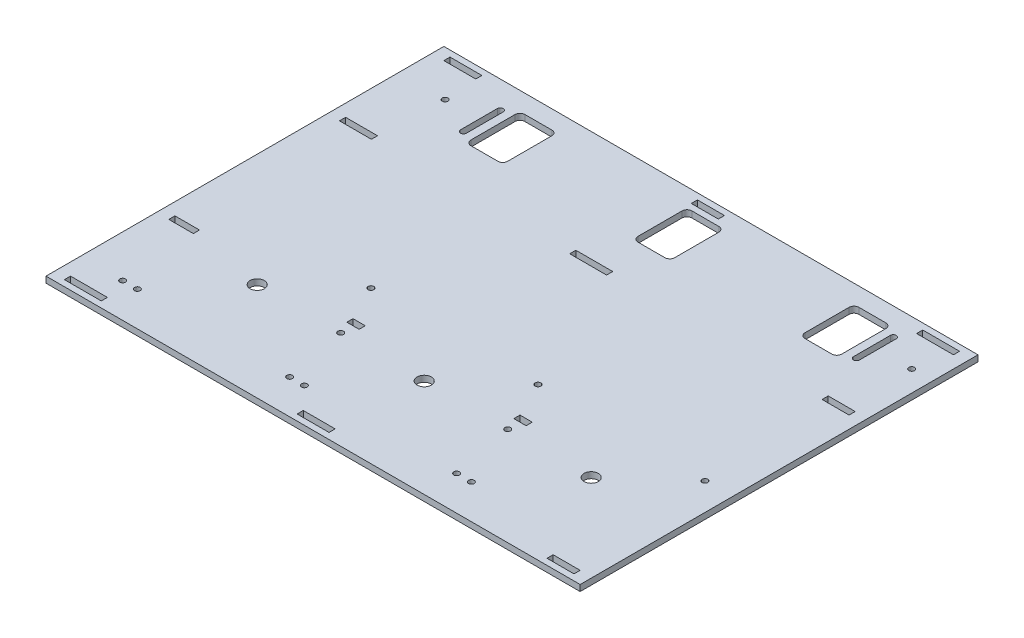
ISO-10303-21;
HEADER;
FILE_DESCRIPTION(('STEP AP214'),'2;1');
FILE_NAME('part.step','',(''),(''),'','','');
FILE_SCHEMA(('AUTOMOTIVE_DESIGN { 1 0 10303 214 1 1 1 1 }'));
ENDSEC;
DATA;
#1=APPLICATION_CONTEXT('core data for automotive mechanical design processes');
#2=APPLICATION_PROTOCOL_DEFINITION('international standard','automotive_design',2000,#1);
#3=PRODUCT_CONTEXT('',#1,'mechanical');
#4=PRODUCT('Part','Part','',(#3));
#5=PRODUCT_RELATED_PRODUCT_CATEGORY('part','',(#4));
#6=PRODUCT_DEFINITION_FORMATION('','',#4);
#7=PRODUCT_DEFINITION_CONTEXT('part definition',#1,'design');
#8=PRODUCT_DEFINITION('design','',#6,#7);
#9=PRODUCT_DEFINITION_SHAPE('','',#8);
#10=(LENGTH_UNIT() NAMED_UNIT(*) SI_UNIT(.MILLI.,.METRE.));
#11=(NAMED_UNIT(*) PLANE_ANGLE_UNIT() SI_UNIT($,.RADIAN.));
#12=(NAMED_UNIT(*) SI_UNIT($,.STERADIAN.) SOLID_ANGLE_UNIT());
#13=UNCERTAINTY_MEASURE_WITH_UNIT(LENGTH_MEASURE(1.E-05),#10,'distance_accuracy_value','');
#14=(GEOMETRIC_REPRESENTATION_CONTEXT(3) GLOBAL_UNCERTAINTY_ASSIGNED_CONTEXT((#13)) GLOBAL_UNIT_ASSIGNED_CONTEXT((#10,
#11,#12)) REPRESENTATION_CONTEXT('',''));
#15=CARTESIAN_POINT('',(0.,0.,0.));
#16=DIRECTION('',(0.,0.,1.));
#17=DIRECTION('',(1.,0.,0.));
#18=AXIS2_PLACEMENT_3D('',#15,#16,#17);
#19=CARTESIAN_POINT('',(0.,0.,0.));
#20=DIRECTION('',(0.,-1.,0.));
#21=DIRECTION('',(0.,0.,-1.));
#22=AXIS2_PLACEMENT_3D('',#19,#20,#21);
#23=PLANE('',#22);
#24=CARTESIAN_POINT('',(21.8007955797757,0.,-17.8279202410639));
#25=DIRECTION('',(0.,1.,0.));
#26=DIRECTION('',(0.,0.,1.));
#27=AXIS2_PLACEMENT_3D('',#24,#25,#26);
#28=CIRCLE('',#27,1.4732);
#29=CARTESIAN_POINT('',(21.8007955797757,0.,-16.3547202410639));
#30=VERTEX_POINT('',#29);
#31=EDGE_CURVE('E1420',#30,#30,#28,.T.);
#32=ORIENTED_EDGE('',*,*,#31,.T.);
#33=EDGE_LOOP('',(#32));
#34=FACE_BOUND('',#33,.T.);
#35=CARTESIAN_POINT('',(175.736440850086,0.,-78.6733045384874));
#36=DIRECTION('',(0.,1.,0.));
#37=DIRECTION('',(0.,0.,1.));
#38=AXIS2_PLACEMENT_3D('',#35,#36,#37);
#39=CIRCLE('',#38,1.47320000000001);
#40=CARTESIAN_POINT('',(175.736440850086,0.,-77.2001045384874));
#41=VERTEX_POINT('',#40);
#42=EDGE_CURVE('E1433',#41,#41,#39,.T.);
#43=ORIENTED_EDGE('',*,*,#42,.T.);
#44=EDGE_LOOP('',(#43));
#45=FACE_BOUND('',#44,.T.);
#46=CARTESIAN_POINT('',(262.096440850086,0.,-78.6733045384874));
#47=DIRECTION('',(0.,1.,0.));
#48=DIRECTION('',(0.,0.,1.));
#49=AXIS2_PLACEMENT_3D('',#46,#47,#48);
#50=CIRCLE('',#49,1.47320000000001);
#51=CARTESIAN_POINT('',(262.096440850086,0.,-77.2001045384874));
#52=VERTEX_POINT('',#51);
#53=EDGE_CURVE('E1443',#52,#52,#50,.T.);
#54=ORIENTED_EDGE('',*,*,#53,.T.);
#55=EDGE_LOOP('',(#54));
#56=FACE_BOUND('',#55,.T.);
#57=CARTESIAN_POINT('',(24.1299999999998,0.,-182.245000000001));
#58=DIRECTION('',(0.,1.,0.));
#59=DIRECTION('',(0.,0.,1.));
#60=AXIS2_PLACEMENT_3D('',#57,#58,#59);
#61=CIRCLE('',#60,1.4732);
#62=CARTESIAN_POINT('',(24.1299999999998,0.,-180.771800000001));
#63=VERTEX_POINT('',#62);
#64=EDGE_CURVE('E1453',#63,#63,#61,.T.);
#65=ORIENTED_EDGE('',*,*,#64,.T.);
#66=EDGE_LOOP('',(#65));
#67=FACE_BOUND('',#66,.T.);
#68=CARTESIAN_POINT('',(115.780795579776,0.,-17.8279202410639));
#69=DIRECTION('',(0.,1.,0.));
#70=DIRECTION('',(0.,0.,1.));
#71=AXIS2_PLACEMENT_3D('',#68,#69,#70);
#72=CIRCLE('',#71,1.47319999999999);
#73=CARTESIAN_POINT('',(115.780795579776,0.,-16.3547202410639));
#74=VERTEX_POINT('',#73);
#75=EDGE_CURVE('E1463',#74,#74,#72,.T.);
#76=ORIENTED_EDGE('',*,*,#75,.T.);
#77=EDGE_LOOP('',(#76));
#78=FACE_BOUND('',#77,.T.);
#79=CARTESIAN_POINT('',(101.6,0.,-50.8000000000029));
#80=DIRECTION('',(0.,1.,0.));
#81=DIRECTION('',(0.,0.,1.));
#82=AXIS2_PLACEMENT_3D('',#79,#80,#81);
#83=CIRCLE('',#82,1.47319999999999);
#84=CARTESIAN_POINT('',(101.6,0.,-49.3268000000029));
#85=VERTEX_POINT('',#84);
#86=EDGE_CURVE('E1473',#85,#85,#83,.T.);
#87=ORIENTED_EDGE('',*,*,#86,.T.);
#88=EDGE_LOOP('',(#87));
#89=FACE_BOUND('',#88,.T.);
#90=DIRECTION('',(0.,0.,-1.));
#91=VECTOR('',#90,1.);
#92=CARTESIAN_POINT('',(247.904,0.,-191.770000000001));
#93=LINE('',#92,#91);
#94=CARTESIAN_POINT('',(247.904,0.,-172.720000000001));
#95=VERTEX_POINT('',#94);
#96=CARTESIAN_POINT('',(247.904,0.,-191.770000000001));
#97=VERTEX_POINT('',#96);
#98=EDGE_CURVE('E565',#95,#97,#93,.T.);
#99=ORIENTED_EDGE('',*,*,#98,.T.);
#100=CARTESIAN_POINT('',(246.38,0.,-191.770000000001));
#101=DIRECTION('',(0.,1.,0.));
#102=DIRECTION('',(0.,0.,1.));
#103=AXIS2_PLACEMENT_3D('',#100,#101,#102);
#104=CIRCLE('',#103,1.524);
#105=CARTESIAN_POINT('',(244.856,0.,-191.770000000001));
#106=VERTEX_POINT('',#105);
#107=EDGE_CURVE('E585',#97,#106,#104,.T.);
#108=ORIENTED_EDGE('',*,*,#107,.T.);
#109=DIRECTION('',(0.,0.,1.));
#110=VECTOR('',#109,1.);
#111=CARTESIAN_POINT('',(244.856,0.,-191.770000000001));
#112=LINE('',#111,#110);
#113=CARTESIAN_POINT('',(244.856,0.,-172.720000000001));
#114=VERTEX_POINT('',#113);
#115=EDGE_CURVE('E571',#106,#114,#112,.T.);
#116=ORIENTED_EDGE('',*,*,#115,.T.);
#117=CARTESIAN_POINT('',(246.38,0.,-172.720000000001));
#118=DIRECTION('',(0.,1.,0.));
#119=DIRECTION('',(0.,0.,1.));
#120=AXIS2_PLACEMENT_3D('',#117,#118,#119);
#121=CIRCLE('',#120,1.524);
#122=EDGE_CURVE('E589',#114,#95,#121,.T.);
#123=ORIENTED_EDGE('',*,*,#122,.T.);
#124=EDGE_LOOP('',(#99,#108,#116,#123));
#125=FACE_BOUND('',#124,.T.);
#126=DIRECTION('',(0.,0.,1.));
#127=VECTOR('',#126,1.);
#128=CARTESIAN_POINT('',(48.8949999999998,0.,-168.275000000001));
#129=LINE('',#128,#127);
#130=CARTESIAN_POINT('',(48.8949999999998,0.,-193.675000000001));
#131=VERTEX_POINT('',#130);
#132=CARTESIAN_POINT('',(48.8949999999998,0.,-170.815000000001));
#133=VERTEX_POINT('',#132);
#134=EDGE_CURVE('E647',#131,#133,#129,.T.);
#135=ORIENTED_EDGE('',*,*,#134,.T.);
#136=CARTESIAN_POINT('',(51.4349999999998,0.,-170.815000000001));
#137=DIRECTION('',(0.,-1.,0.));
#138=DIRECTION('',(0.,0.,-1.));
#139=AXIS2_PLACEMENT_3D('',#136,#137,#138);
#140=CIRCLE('',#139,2.54);
#141=CARTESIAN_POINT('',(51.4349999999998,0.,-168.275000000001));
#142=VERTEX_POINT('',#141);
#143=EDGE_CURVE('E1210',#133,#142,#140,.F.);
#144=ORIENTED_EDGE('',*,*,#143,.T.);
#145=DIRECTION('',(1.,0.,0.));
#146=VECTOR('',#145,1.);
#147=CARTESIAN_POINT('',(67.9449999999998,0.,-168.275000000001));
#148=LINE('',#147,#146);
#149=CARTESIAN_POINT('',(65.4049999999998,0.,-168.275000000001));
#150=VERTEX_POINT('',#149);
#151=EDGE_CURVE('E633',#142,#150,#148,.T.);
#152=ORIENTED_EDGE('',*,*,#151,.T.);
#153=CARTESIAN_POINT('',(65.4049999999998,0.,-170.815000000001));
#154=DIRECTION('',(0.,-1.,0.));
#155=DIRECTION('',(0.,0.,-1.));
#156=AXIS2_PLACEMENT_3D('',#153,#154,#155);
#157=CIRCLE('',#156,2.54);
#158=CARTESIAN_POINT('',(67.9449999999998,0.,-170.815000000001));
#159=VERTEX_POINT('',#158);
#160=EDGE_CURVE('E1214',#150,#159,#157,.F.);
#161=ORIENTED_EDGE('',*,*,#160,.T.);
#162=DIRECTION('',(0.,0.,-1.));
#163=VECTOR('',#162,1.);
#164=CARTESIAN_POINT('',(67.9449999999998,0.,-168.275000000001));
#165=LINE('',#164,#163);
#166=CARTESIAN_POINT('',(67.9449999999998,0.,-193.675000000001));
#167=VERTEX_POINT('',#166);
#168=EDGE_CURVE('E628',#159,#167,#165,.T.);
#169=ORIENTED_EDGE('',*,*,#168,.T.);
#170=CARTESIAN_POINT('',(65.4049999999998,0.,-193.675000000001));
#171=DIRECTION('',(0.,-1.,0.));
#172=DIRECTION('',(0.,0.,-1.));
#173=AXIS2_PLACEMENT_3D('',#170,#171,#172);
#174=CIRCLE('',#173,2.54);
#175=CARTESIAN_POINT('',(65.4049999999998,0.,-196.215000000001));
#176=VERTEX_POINT('',#175);
#177=EDGE_CURVE('E1218',#167,#176,#174,.F.);
#178=ORIENTED_EDGE('',*,*,#177,.T.);
#179=DIRECTION('',(-1.,0.,0.));
#180=VECTOR('',#179,1.);
#181=CARTESIAN_POINT('',(67.9449999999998,0.,-196.215000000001));
#182=LINE('',#181,#180);
#183=CARTESIAN_POINT('',(51.4349999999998,0.,-196.215000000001));
#184=VERTEX_POINT('',#183);
#185=EDGE_CURVE('E644',#176,#184,#182,.T.);
#186=ORIENTED_EDGE('',*,*,#185,.T.);
#187=CARTESIAN_POINT('',(51.4349999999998,0.,-193.675000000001));
#188=DIRECTION('',(0.,-1.,0.));
#189=DIRECTION('',(0.,0.,-1.));
#190=AXIS2_PLACEMENT_3D('',#187,#188,#189);
#191=CIRCLE('',#190,2.54);
#192=EDGE_CURVE('E40',#184,#131,#191,.F.);
#193=ORIENTED_EDGE('',*,*,#192,.T.);
#194=EDGE_LOOP('',(#135,#144,#152,#161,#169,#178,#186,#193));
#195=FACE_BOUND('',#194,.T.);
#196=DIRECTION('',(0.,0.,1.));
#197=VECTOR('',#196,1.);
#198=CARTESIAN_POINT('',(135.255,0.,-168.275000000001));
#199=LINE('',#198,#197);
#200=CARTESIAN_POINT('',(135.255,0.,-193.675000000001));
#201=VERTEX_POINT('',#200);
#202=CARTESIAN_POINT('',(135.255,0.,-170.815000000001));
#203=VERTEX_POINT('',#202);
#204=EDGE_CURVE('E695',#201,#203,#199,.T.);
#205=ORIENTED_EDGE('',*,*,#204,.T.);
#206=CARTESIAN_POINT('',(137.795,0.,-170.815000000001));
#207=DIRECTION('',(0.,-1.,0.));
#208=DIRECTION('',(0.,0.,-1.));
#209=AXIS2_PLACEMENT_3D('',#206,#207,#208);
#210=CIRCLE('',#209,2.54);
#211=CARTESIAN_POINT('',(137.795,0.,-168.275000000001));
#212=VERTEX_POINT('',#211);
#213=EDGE_CURVE('E1206',#203,#212,#210,.F.);
#214=ORIENTED_EDGE('',*,*,#213,.T.);
#215=DIRECTION('',(1.,0.,0.));
#216=VECTOR('',#215,1.);
#217=CARTESIAN_POINT('',(154.305,0.,-168.275000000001));
#218=LINE('',#217,#216);
#219=CARTESIAN_POINT('',(151.765,0.,-168.275000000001));
#220=VERTEX_POINT('',#219);
#221=EDGE_CURVE('E680',#212,#220,#218,.T.);
#222=ORIENTED_EDGE('',*,*,#221,.T.);
#223=CARTESIAN_POINT('',(151.765,0.,-170.815000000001));
#224=DIRECTION('',(0.,-1.,0.));
#225=DIRECTION('',(0.,0.,-1.));
#226=AXIS2_PLACEMENT_3D('',#223,#224,#225);
#227=CIRCLE('',#226,2.54);
#228=CARTESIAN_POINT('',(154.305,0.,-170.815000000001));
#229=VERTEX_POINT('',#228);
#230=EDGE_CURVE('E1194',#220,#229,#227,.F.);
#231=ORIENTED_EDGE('',*,*,#230,.T.);
#232=DIRECTION('',(0.,0.,-1.));
#233=VECTOR('',#232,1.);
#234=CARTESIAN_POINT('',(154.305,0.,-168.275000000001));
#235=LINE('',#234,#233);
#236=CARTESIAN_POINT('',(154.305,0.,-193.675000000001));
#237=VERTEX_POINT('',#236);
#238=EDGE_CURVE('E665',#229,#237,#235,.T.);
#239=ORIENTED_EDGE('',*,*,#238,.T.);
#240=CARTESIAN_POINT('',(151.765,0.,-193.675000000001));
#241=DIRECTION('',(0.,-1.,0.));
#242=DIRECTION('',(0.,0.,-1.));
#243=AXIS2_PLACEMENT_3D('',#240,#241,#242);
#244=CIRCLE('',#243,2.54);
#245=CARTESIAN_POINT('',(151.765,0.,-196.215000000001));
#246=VERTEX_POINT('',#245);
#247=EDGE_CURVE('E1198',#237,#246,#244,.F.);
#248=ORIENTED_EDGE('',*,*,#247,.T.);
#249=DIRECTION('',(-1.,0.,0.));
#250=VECTOR('',#249,1.);
#251=CARTESIAN_POINT('',(154.305,0.,-196.215000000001));
#252=LINE('',#251,#250);
#253=CARTESIAN_POINT('',(137.795,0.,-196.215000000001));
#254=VERTEX_POINT('',#253);
#255=EDGE_CURVE('E692',#246,#254,#252,.T.);
#256=ORIENTED_EDGE('',*,*,#255,.T.);
#257=CARTESIAN_POINT('',(137.795,0.,-193.675000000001));
#258=DIRECTION('',(0.,-1.,0.));
#259=DIRECTION('',(0.,0.,-1.));
#260=AXIS2_PLACEMENT_3D('',#257,#258,#259);
#261=CIRCLE('',#260,2.54);
#262=EDGE_CURVE('E1202',#254,#201,#261,.F.);
#263=ORIENTED_EDGE('',*,*,#262,.T.);
#264=EDGE_LOOP('',(#205,#214,#222,#231,#239,#248,#256,#263));
#265=FACE_BOUND('',#264,.T.);
#266=CARTESIAN_POINT('',(144.78,0.,-50.8000000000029));
#267=DIRECTION('',(0.,1.,0.));
#268=DIRECTION('',(0.,0.,1.));
#269=AXIS2_PLACEMENT_3D('',#266,#267,#268);
#270=CIRCLE('',#269,3.683);
#271=CARTESIAN_POINT('',(144.78,0.,-47.1170000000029));
#272=VERTEX_POINT('',#271);
#273=EDGE_CURVE('E703',#272,#272,#270,.T.);
#274=ORIENTED_EDGE('',*,*,#273,.T.);
#275=EDGE_LOOP('',(#274));
#276=FACE_BOUND('',#275,.T.);
#277=DIRECTION('',(1.,0.,-1.38960001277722E-13));
#278=VECTOR('',#277,1.);
#279=CARTESIAN_POINT('',(25.4,0.,-3.17500000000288));
#280=LINE('',#279,#278);
#281=CARTESIAN_POINT('',(6.35000000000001,0.,-3.17500000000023));
#282=VERTEX_POINT('',#281);
#283=CARTESIAN_POINT('',(25.4,0.,-3.17500000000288));
#284=VERTEX_POINT('',#283);
#285=EDGE_CURVE('E721',#282,#284,#280,.T.);
#286=ORIENTED_EDGE('',*,*,#285,.T.);
#287=DIRECTION('',(0.,0.,-1.));
#288=VECTOR('',#287,1.);
#289=CARTESIAN_POINT('',(25.4,0.,-3.17500000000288));
#290=LINE('',#289,#288);
#291=CARTESIAN_POINT('',(25.4,0.,-6.35000000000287));
#292=VERTEX_POINT('',#291);
#293=EDGE_CURVE('E715',#284,#292,#290,.T.);
#294=ORIENTED_EDGE('',*,*,#293,.T.);
#295=DIRECTION('',(-1.,0.,1.38960001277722E-13));
#296=VECTOR('',#295,1.);
#297=CARTESIAN_POINT('',(25.4,0.,-6.35000000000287));
#298=LINE('',#297,#296);
#299=CARTESIAN_POINT('',(6.35000000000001,0.,-6.35000000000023));
#300=VERTEX_POINT('',#299);
#301=EDGE_CURVE('E731',#292,#300,#298,.T.);
#302=ORIENTED_EDGE('',*,*,#301,.T.);
#303=DIRECTION('',(0.,0.,1.));
#304=VECTOR('',#303,1.);
#305=CARTESIAN_POINT('',(6.35000000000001,0.,-3.17500000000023));
#306=LINE('',#305,#304);
#307=EDGE_CURVE('E734',#300,#282,#306,.T.);
#308=ORIENTED_EDGE('',*,*,#307,.T.);
#309=EDGE_LOOP('',(#286,#294,#302,#308));
#310=FACE_BOUND('',#309,.T.);
#311=DIRECTION('',(1.,0.,0.));
#312=VECTOR('',#311,1.);
#313=CARTESIAN_POINT('',(269.875,0.,-3.17500000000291));
#314=LINE('',#313,#312);
#315=CARTESIAN_POINT('',(255.905,0.,-3.1750000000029));
#316=VERTEX_POINT('',#315);
#317=CARTESIAN_POINT('',(269.875,0.,-3.17500000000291));
#318=VERTEX_POINT('',#317);
#319=EDGE_CURVE('E783',#316,#318,#314,.T.);
#320=ORIENTED_EDGE('',*,*,#319,.T.);
#321=DIRECTION('',(0.,0.,-1.));
#322=VECTOR('',#321,1.);
#323=CARTESIAN_POINT('',(269.875,0.,-3.17500000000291));
#324=LINE('',#323,#322);
#325=CARTESIAN_POINT('',(269.875,0.,-6.35000000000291));
#326=VERTEX_POINT('',#325);
#327=EDGE_CURVE('E779',#318,#326,#324,.T.);
#328=ORIENTED_EDGE('',*,*,#327,.T.);
#329=DIRECTION('',(-1.,0.,0.));
#330=VECTOR('',#329,1.);
#331=CARTESIAN_POINT('',(269.875,0.,-6.35000000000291));
#332=LINE('',#331,#330);
#333=CARTESIAN_POINT('',(255.905,0.,-6.3500000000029));
#334=VERTEX_POINT('',#333);
#335=EDGE_CURVE('E793',#326,#334,#332,.T.);
#336=ORIENTED_EDGE('',*,*,#335,.T.);
#337=DIRECTION('',(0.,0.,1.));
#338=VECTOR('',#337,1.);
#339=CARTESIAN_POINT('',(255.905,0.,-3.1750000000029));
#340=LINE('',#339,#338);
#341=EDGE_CURVE('E796',#334,#316,#340,.T.);
#342=ORIENTED_EDGE('',*,*,#341,.T.);
#343=EDGE_LOOP('',(#320,#328,#336,#342));
#344=FACE_BOUND('',#343,.T.);
#345=DIRECTION('',(1.,0.,0.));
#346=VECTOR('',#345,1.);
#347=CARTESIAN_POINT('',(104.775,0.,-57.1500000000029));
#348=LINE('',#347,#346);
#349=CARTESIAN_POINT('',(98.425,0.,-57.1500000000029));
#350=VERTEX_POINT('',#349);
#351=CARTESIAN_POINT('',(104.775,0.,-57.1500000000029));
#352=VERTEX_POINT('',#351);
#353=EDGE_CURVE('E845',#350,#352,#348,.T.);
#354=ORIENTED_EDGE('',*,*,#353,.T.);
#355=DIRECTION('',(0.,0.,-1.));
#356=VECTOR('',#355,1.);
#357=CARTESIAN_POINT('',(104.775,0.,-57.1500000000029));
#358=LINE('',#357,#356);
#359=CARTESIAN_POINT('',(104.775,0.,-60.3250000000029));
#360=VERTEX_POINT('',#359);
#361=EDGE_CURVE('E841',#352,#360,#358,.T.);
#362=ORIENTED_EDGE('',*,*,#361,.T.);
#363=DIRECTION('',(-1.,0.,0.));
#364=VECTOR('',#363,1.);
#365=CARTESIAN_POINT('',(104.775,0.,-60.3250000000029));
#366=LINE('',#365,#364);
#367=CARTESIAN_POINT('',(98.425,0.,-60.3250000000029));
#368=VERTEX_POINT('',#367);
#369=EDGE_CURVE('E855',#360,#368,#366,.T.);
#370=ORIENTED_EDGE('',*,*,#369,.T.);
#371=DIRECTION('',(0.,0.,1.));
#372=VECTOR('',#371,1.);
#373=CARTESIAN_POINT('',(98.425,0.,-57.1500000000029));
#374=LINE('',#373,#372);
#375=EDGE_CURVE('E858',#368,#350,#374,.T.);
#376=ORIENTED_EDGE('',*,*,#375,.T.);
#377=EDGE_LOOP('',(#354,#362,#370,#376));
#378=FACE_BOUND('',#377,.T.);
#379=DIRECTION('',(1.,0.,0.));
#380=VECTOR('',#379,1.);
#381=CARTESIAN_POINT('',(22.86,0.,-145.415000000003));
#382=LINE('',#381,#380);
#383=CARTESIAN_POINT('',(6.34999999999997,0.,-145.415000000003));
#384=VERTEX_POINT('',#383);
#385=CARTESIAN_POINT('',(22.86,0.,-145.415000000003));
#386=VERTEX_POINT('',#385);
#387=EDGE_CURVE('E907',#384,#386,#382,.T.);
#388=ORIENTED_EDGE('',*,*,#387,.T.);
#389=DIRECTION('',(0.,0.,-1.));
#390=VECTOR('',#389,1.);
#391=CARTESIAN_POINT('',(22.86,0.,-145.415000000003));
#392=LINE('',#391,#390);
#393=CARTESIAN_POINT('',(22.86,0.,-148.590000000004));
#394=VERTEX_POINT('',#393);
#395=EDGE_CURVE('E903',#386,#394,#392,.T.);
#396=ORIENTED_EDGE('',*,*,#395,.T.);
#397=DIRECTION('',(-1.,0.,0.));
#398=VECTOR('',#397,1.);
#399=CARTESIAN_POINT('',(22.86,0.,-148.590000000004));
#400=LINE('',#399,#398);
#401=CARTESIAN_POINT('',(6.34999999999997,0.,-148.590000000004));
#402=VERTEX_POINT('',#401);
#403=EDGE_CURVE('E917',#394,#402,#400,.T.);
#404=ORIENTED_EDGE('',*,*,#403,.T.);
#405=DIRECTION('',(0.,0.,1.));
#406=VECTOR('',#405,1.);
#407=CARTESIAN_POINT('',(6.34999999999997,0.,-145.415000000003));
#408=LINE('',#407,#406);
#409=EDGE_CURVE('E920',#402,#384,#408,.T.);
#410=ORIENTED_EDGE('',*,*,#409,.T.);
#411=EDGE_LOOP('',(#388,#396,#404,#410));
#412=FACE_BOUND('',#411,.T.);
#413=DIRECTION('',(1.,0.,0.));
#414=VECTOR('',#413,1.);
#415=CARTESIAN_POINT('',(269.875,0.,-145.415000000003));
#416=LINE('',#415,#414);
#417=CARTESIAN_POINT('',(255.905,0.,-145.415000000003));
#418=VERTEX_POINT('',#417);
#419=CARTESIAN_POINT('',(269.875,0.,-145.415000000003));
#420=VERTEX_POINT('',#419);
#421=EDGE_CURVE('E969',#418,#420,#416,.T.);
#422=ORIENTED_EDGE('',*,*,#421,.T.);
#423=DIRECTION('',(0.,0.,-1.));
#424=VECTOR('',#423,1.);
#425=CARTESIAN_POINT('',(269.875,0.,-145.415000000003));
#426=LINE('',#425,#424);
#427=CARTESIAN_POINT('',(269.875,0.,-148.590000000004));
#428=VERTEX_POINT('',#427);
#429=EDGE_CURVE('E965',#420,#428,#426,.T.);
#430=ORIENTED_EDGE('',*,*,#429,.T.);
#431=DIRECTION('',(-1.,0.,0.));
#432=VECTOR('',#431,1.);
#433=CARTESIAN_POINT('',(269.875,0.,-148.590000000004));
#434=LINE('',#433,#432);
#435=CARTESIAN_POINT('',(255.905,0.,-148.590000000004));
#436=VERTEX_POINT('',#435);
#437=EDGE_CURVE('E979',#428,#436,#434,.T.);
#438=ORIENTED_EDGE('',*,*,#437,.T.);
#439=DIRECTION('',(0.,0.,1.));
#440=VECTOR('',#439,1.);
#441=CARTESIAN_POINT('',(255.905,0.,-145.415000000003));
#442=LINE('',#441,#440);
#443=EDGE_CURVE('E982',#436,#418,#442,.T.);
#444=ORIENTED_EDGE('',*,*,#443,.T.);
#445=EDGE_LOOP('',(#422,#430,#438,#444));
#446=FACE_BOUND('',#445,.T.);
#447=DIRECTION('',(1.,0.,0.));
#448=VECTOR('',#447,1.);
#449=CARTESIAN_POINT('',(148.2725,0.,-199.390000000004));
#450=LINE('',#449,#448);
#451=CARTESIAN_POINT('',(134.3025,0.,-199.390000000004));
#452=VERTEX_POINT('',#451);
#453=CARTESIAN_POINT('',(148.2725,0.,-199.390000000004));
#454=VERTEX_POINT('',#453);
#455=EDGE_CURVE('E1031',#452,#454,#450,.T.);
#456=ORIENTED_EDGE('',*,*,#455,.T.);
#457=DIRECTION('',(0.,0.,-1.));
#458=VECTOR('',#457,1.);
#459=CARTESIAN_POINT('',(148.2725,0.,-199.390000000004));
#460=LINE('',#459,#458);
#461=CARTESIAN_POINT('',(148.2725,0.,-202.564999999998));
#462=VERTEX_POINT('',#461);
#463=EDGE_CURVE('E1027',#454,#462,#460,.T.);
#464=ORIENTED_EDGE('',*,*,#463,.T.);
#465=DIRECTION('',(-1.,0.,0.));
#466=VECTOR('',#465,1.);
#467=CARTESIAN_POINT('',(148.2725,0.,-202.564999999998));
#468=LINE('',#467,#466);
#469=CARTESIAN_POINT('',(134.3025,0.,-202.564999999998));
#470=VERTEX_POINT('',#469);
#471=EDGE_CURVE('E1041',#462,#470,#468,.T.);
#472=ORIENTED_EDGE('',*,*,#471,.T.);
#473=DIRECTION('',(0.,0.,1.));
#474=VECTOR('',#473,1.);
#475=CARTESIAN_POINT('',(134.3025,0.,-199.390000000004));
#476=LINE('',#475,#474);
#477=EDGE_CURVE('E1044',#470,#452,#476,.T.);
#478=ORIENTED_EDGE('',*,*,#477,.T.);
#479=EDGE_LOOP('',(#456,#464,#472,#478));
#480=FACE_BOUND('',#479,.T.);
#481=DIRECTION('',(0.,0.,-1.));
#482=VECTOR('',#481,1.);
#483=CARTESIAN_POINT('',(276.225,0.,-205.74));
#484=LINE('',#483,#482);
#485=CARTESIAN_POINT('',(276.225,0.,0.));
#486=VERTEX_POINT('',#485);
#487=CARTESIAN_POINT('',(276.225,0.,-205.74));
#488=VERTEX_POINT('',#487);
#489=EDGE_CURVE('E1089',#486,#488,#484,.T.);
#490=ORIENTED_EDGE('',*,*,#489,.F.);
#491=DIRECTION('',(1.,0.,0.));
#492=VECTOR('',#491,1.);
#493=CARTESIAN_POINT('',(276.225,0.,0.));
#494=LINE('',#493,#492);
#495=CARTESIAN_POINT('',(0.,0.,0.));
#496=VERTEX_POINT('',#495);
#497=EDGE_CURVE('E1094',#496,#486,#494,.T.);
#498=ORIENTED_EDGE('',*,*,#497,.F.);
#499=DIRECTION('',(0.,0.,1.));
#500=VECTOR('',#499,1.);
#501=CARTESIAN_POINT('',(0.,0.,-205.74));
#502=LINE('',#501,#500);
#503=CARTESIAN_POINT('',(0.,0.,-205.74));
#504=VERTEX_POINT('',#503);
#505=EDGE_CURVE('E1105',#504,#496,#502,.T.);
#506=ORIENTED_EDGE('',*,*,#505,.F.);
#507=DIRECTION('',(-1.,0.,0.));
#508=VECTOR('',#507,1.);
#509=CARTESIAN_POINT('',(276.225,0.,-205.74));
#510=LINE('',#509,#508);
#511=EDGE_CURVE('E1103',#488,#504,#510,.T.);
#512=ORIENTED_EDGE('',*,*,#511,.F.);
#513=EDGE_LOOP('',(#490,#498,#506,#512));
#514=FACE_BOUND('',#513,.T.);
#515=DIRECTION('',(1.,0.,0.));
#516=VECTOR('',#515,1.);
#517=CARTESIAN_POINT('',(269.875,0.,-199.390000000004));
#518=LINE('',#517,#516);
#519=CARTESIAN_POINT('',(250.825,0.,-199.390000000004));
#520=VERTEX_POINT('',#519);
#521=CARTESIAN_POINT('',(269.875,0.,-199.390000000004));
#522=VERTEX_POINT('',#521);
#523=EDGE_CURVE('E1062',#520,#522,#518,.T.);
#524=ORIENTED_EDGE('',*,*,#523,.T.);
#525=DIRECTION('',(0.,0.,-1.));
#526=VECTOR('',#525,1.);
#527=CARTESIAN_POINT('',(269.875,0.,-199.390000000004));
#528=LINE('',#527,#526);
#529=CARTESIAN_POINT('',(269.875,0.,-202.564999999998));
#530=VERTEX_POINT('',#529);
#531=EDGE_CURVE('E1058',#522,#530,#528,.T.);
#532=ORIENTED_EDGE('',*,*,#531,.T.);
#533=DIRECTION('',(-1.,0.,0.));
#534=VECTOR('',#533,1.);
#535=CARTESIAN_POINT('',(269.875,0.,-202.564999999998));
#536=LINE('',#535,#534);
#537=CARTESIAN_POINT('',(250.825,0.,-202.564999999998));
#538=VERTEX_POINT('',#537);
#539=EDGE_CURVE('E1072',#530,#538,#536,.T.);
#540=ORIENTED_EDGE('',*,*,#539,.T.);
#541=DIRECTION('',(0.,0.,1.));
#542=VECTOR('',#541,1.);
#543=CARTESIAN_POINT('',(250.825,0.,-199.390000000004));
#544=LINE('',#543,#542);
#545=EDGE_CURVE('E1075',#538,#520,#544,.T.);
#546=ORIENTED_EDGE('',*,*,#545,.T.);
#547=EDGE_LOOP('',(#524,#532,#540,#546));
#548=FACE_BOUND('',#547,.T.);
#549=DIRECTION('',(1.,0.,0.));
#550=VECTOR('',#549,1.);
#551=CARTESIAN_POINT('',(22.86,0.,-199.390000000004));
#552=LINE('',#551,#550);
#553=CARTESIAN_POINT('',(6.34999999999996,0.,-199.390000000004));
#554=VERTEX_POINT('',#553);
#555=CARTESIAN_POINT('',(22.86,0.,-199.390000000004));
#556=VERTEX_POINT('',#555);
#557=EDGE_CURVE('E1000',#554,#556,#552,.T.);
#558=ORIENTED_EDGE('',*,*,#557,.T.);
#559=DIRECTION('',(0.,0.,-1.));
#560=VECTOR('',#559,1.);
#561=CARTESIAN_POINT('',(22.86,0.,-199.390000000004));
#562=LINE('',#561,#560);
#563=CARTESIAN_POINT('',(22.86,0.,-202.564999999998));
#564=VERTEX_POINT('',#563);
#565=EDGE_CURVE('E996',#556,#564,#562,.T.);
#566=ORIENTED_EDGE('',*,*,#565,.T.);
#567=DIRECTION('',(-1.,0.,0.));
#568=VECTOR('',#567,1.);
#569=CARTESIAN_POINT('',(22.86,0.,-202.564999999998));
#570=LINE('',#569,#568);
#571=CARTESIAN_POINT('',(6.34999999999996,0.,-202.564999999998));
#572=VERTEX_POINT('',#571);
#573=EDGE_CURVE('E1010',#564,#572,#570,.T.);
#574=ORIENTED_EDGE('',*,*,#573,.T.);
#575=DIRECTION('',(0.,0.,1.));
#576=VECTOR('',#575,1.);
#577=CARTESIAN_POINT('',(6.34999999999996,0.,-199.390000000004));
#578=LINE('',#577,#576);
#579=EDGE_CURVE('E1013',#572,#554,#578,.T.);
#580=ORIENTED_EDGE('',*,*,#579,.T.);
#581=EDGE_LOOP('',(#558,#566,#574,#580));
#582=FACE_BOUND('',#581,.T.);
#583=DIRECTION('',(1.,0.,0.));
#584=VECTOR('',#583,1.);
#585=CARTESIAN_POINT('',(144.4625,0.,-145.415000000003));
#586=LINE('',#585,#584);
#587=CARTESIAN_POINT('',(125.4125,0.,-145.415000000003));
#588=VERTEX_POINT('',#587);
#589=CARTESIAN_POINT('',(144.4625,0.,-145.415000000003));
#590=VERTEX_POINT('',#589);
#591=EDGE_CURVE('E938',#588,#590,#586,.T.);
#592=ORIENTED_EDGE('',*,*,#591,.T.);
#593=DIRECTION('',(0.,0.,-1.));
#594=VECTOR('',#593,1.);
#595=CARTESIAN_POINT('',(144.4625,0.,-145.415000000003));
#596=LINE('',#595,#594);
#597=CARTESIAN_POINT('',(144.4625,0.,-148.590000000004));
#598=VERTEX_POINT('',#597);
#599=EDGE_CURVE('E934',#590,#598,#596,.T.);
#600=ORIENTED_EDGE('',*,*,#599,.T.);
#601=DIRECTION('',(-1.,0.,0.));
#602=VECTOR('',#601,1.);
#603=CARTESIAN_POINT('',(144.4625,0.,-148.590000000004));
#604=LINE('',#603,#602);
#605=CARTESIAN_POINT('',(125.4125,0.,-148.590000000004));
#606=VERTEX_POINT('',#605);
#607=EDGE_CURVE('E948',#598,#606,#604,.T.);
#608=ORIENTED_EDGE('',*,*,#607,.T.);
#609=DIRECTION('',(0.,0.,1.));
#610=VECTOR('',#609,1.);
#611=CARTESIAN_POINT('',(125.4125,0.,-145.415000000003));
#612=LINE('',#611,#610);
#613=EDGE_CURVE('E951',#606,#588,#612,.T.);
#614=ORIENTED_EDGE('',*,*,#613,.T.);
#615=EDGE_LOOP('',(#592,#600,#608,#614));
#616=FACE_BOUND('',#615,.T.);
#617=DIRECTION('',(1.,0.,0.));
#618=VECTOR('',#617,1.);
#619=CARTESIAN_POINT('',(191.135,0.,-57.1500000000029));
#620=LINE('',#619,#618);
#621=CARTESIAN_POINT('',(184.785,0.,-57.1500000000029));
#622=VERTEX_POINT('',#621);
#623=CARTESIAN_POINT('',(191.135,0.,-57.1500000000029));
#624=VERTEX_POINT('',#623);
#625=EDGE_CURVE('E876',#622,#624,#620,.T.);
#626=ORIENTED_EDGE('',*,*,#625,.T.);
#627=DIRECTION('',(0.,0.,-1.));
#628=VECTOR('',#627,1.);
#629=CARTESIAN_POINT('',(191.135,0.,-57.1500000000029));
#630=LINE('',#629,#628);
#631=CARTESIAN_POINT('',(191.135,0.,-60.3250000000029));
#632=VERTEX_POINT('',#631);
#633=EDGE_CURVE('E872',#624,#632,#630,.T.);
#634=ORIENTED_EDGE('',*,*,#633,.T.);
#635=DIRECTION('',(-1.,0.,0.));
#636=VECTOR('',#635,1.);
#637=CARTESIAN_POINT('',(191.135,0.,-60.3250000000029));
#638=LINE('',#637,#636);
#639=CARTESIAN_POINT('',(184.785,0.,-60.3250000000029));
#640=VERTEX_POINT('',#639);
#641=EDGE_CURVE('E886',#632,#640,#638,.T.);
#642=ORIENTED_EDGE('',*,*,#641,.T.);
#643=DIRECTION('',(0.,0.,1.));
#644=VECTOR('',#643,1.);
#645=CARTESIAN_POINT('',(184.785,0.,-57.1500000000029));
#646=LINE('',#645,#644);
#647=EDGE_CURVE('E889',#640,#622,#646,.T.);
#648=ORIENTED_EDGE('',*,*,#647,.T.);
#649=EDGE_LOOP('',(#626,#634,#642,#648));
#650=FACE_BOUND('',#649,.T.);
#651=DIRECTION('',(1.,0.,0.));
#652=VECTOR('',#651,1.);
#653=CARTESIAN_POINT('',(19.05,0.,-57.1500000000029));
#654=LINE('',#653,#652);
#655=CARTESIAN_POINT('',(6.35,0.,-57.1500000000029));
#656=VERTEX_POINT('',#655);
#657=CARTESIAN_POINT('',(19.05,0.,-57.1500000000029));
#658=VERTEX_POINT('',#657);
#659=EDGE_CURVE('E814',#656,#658,#654,.T.);
#660=ORIENTED_EDGE('',*,*,#659,.T.);
#661=DIRECTION('',(0.,0.,-1.));
#662=VECTOR('',#661,1.);
#663=CARTESIAN_POINT('',(19.05,0.,-57.1500000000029));
#664=LINE('',#663,#662);
#665=CARTESIAN_POINT('',(19.05,0.,-60.3250000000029));
#666=VERTEX_POINT('',#665);
#667=EDGE_CURVE('E810',#658,#666,#664,.T.);
#668=ORIENTED_EDGE('',*,*,#667,.T.);
#669=DIRECTION('',(-1.,0.,0.));
#670=VECTOR('',#669,1.);
#671=CARTESIAN_POINT('',(19.05,0.,-60.3250000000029));
#672=LINE('',#671,#670);
#673=CARTESIAN_POINT('',(6.35,0.,-60.3250000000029));
#674=VERTEX_POINT('',#673);
#675=EDGE_CURVE('E824',#666,#674,#672,.T.);
#676=ORIENTED_EDGE('',*,*,#675,.T.);
#677=DIRECTION('',(0.,0.,1.));
#678=VECTOR('',#677,1.);
#679=CARTESIAN_POINT('',(6.35,0.,-57.1500000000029));
#680=LINE('',#679,#678);
#681=EDGE_CURVE('E827',#674,#656,#680,.T.);
#682=ORIENTED_EDGE('',*,*,#681,.T.);
#683=EDGE_LOOP('',(#660,#668,#676,#682));
#684=FACE_BOUND('',#683,.T.);
#685=DIRECTION('',(1.,0.,0.));
#686=VECTOR('',#685,1.);
#687=CARTESIAN_POINT('',(143.1925,0.,-3.17500000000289));
#688=LINE('',#687,#686);
#689=CARTESIAN_POINT('',(126.6825,0.,-3.17500000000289));
#690=VERTEX_POINT('',#689);
#691=CARTESIAN_POINT('',(143.1925,0.,-3.17500000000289));
#692=VERTEX_POINT('',#691);
#693=EDGE_CURVE('E752',#690,#692,#688,.T.);
#694=ORIENTED_EDGE('',*,*,#693,.T.);
#695=DIRECTION('',(0.,0.,-1.));
#696=VECTOR('',#695,1.);
#697=CARTESIAN_POINT('',(143.1925,0.,-3.17500000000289));
#698=LINE('',#697,#696);
#699=CARTESIAN_POINT('',(143.1925,0.,-6.35000000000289));
#700=VERTEX_POINT('',#699);
#701=EDGE_CURVE('E748',#692,#700,#698,.T.);
#702=ORIENTED_EDGE('',*,*,#701,.T.);
#703=DIRECTION('',(-1.,0.,0.));
#704=VECTOR('',#703,1.);
#705=CARTESIAN_POINT('',(143.1925,0.,-6.35000000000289));
#706=LINE('',#705,#704);
#707=CARTESIAN_POINT('',(126.6825,0.,-6.35000000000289));
#708=VERTEX_POINT('',#707);
#709=EDGE_CURVE('E762',#700,#708,#706,.T.);
#710=ORIENTED_EDGE('',*,*,#709,.T.);
#711=DIRECTION('',(0.,0.,1.));
#712=VECTOR('',#711,1.);
#713=CARTESIAN_POINT('',(126.6825,0.,-3.17500000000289));
#714=LINE('',#713,#712);
#715=EDGE_CURVE('E765',#708,#690,#714,.T.);
#716=ORIENTED_EDGE('',*,*,#715,.T.);
#717=EDGE_LOOP('',(#694,#702,#710,#716));
#718=FACE_BOUND('',#717,.T.);
#719=CARTESIAN_POINT('',(231.14,0.,-50.8000000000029));
#720=DIRECTION('',(0.,1.,0.));
#721=DIRECTION('',(0.,0.,1.));
#722=AXIS2_PLACEMENT_3D('',#719,#720,#721);
#723=CIRCLE('',#722,3.68300000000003);
#724=CARTESIAN_POINT('',(231.14,0.,-47.1170000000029));
#725=VERTEX_POINT('',#724);
#726=EDGE_CURVE('E709',#725,#725,#723,.T.);
#727=ORIENTED_EDGE('',*,*,#726,.T.);
#728=EDGE_LOOP('',(#727));
#729=FACE_BOUND('',#728,.T.);
#730=CARTESIAN_POINT('',(58.4199999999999,0.,-50.8000000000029));
#731=DIRECTION('',(0.,1.,0.));
#732=DIRECTION('',(0.,0.,1.));
#733=AXIS2_PLACEMENT_3D('',#730,#731,#732);
#734=CIRCLE('',#733,3.68299999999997);
#735=CARTESIAN_POINT('',(58.4199999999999,0.,-47.1170000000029));
#736=VERTEX_POINT('',#735);
#737=EDGE_CURVE('E689',#736,#736,#734,.T.);
#738=ORIENTED_EDGE('',*,*,#737,.T.);
#739=EDGE_LOOP('',(#738));
#740=FACE_BOUND('',#739,.T.);
#741=DIRECTION('',(0.,0.,-1.));
#742=VECTOR('',#741,1.);
#743=CARTESIAN_POINT('',(240.665,0.,-168.275000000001));
#744=LINE('',#743,#742);
#745=CARTESIAN_POINT('',(240.665,0.,-170.815000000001));
#746=VERTEX_POINT('',#745);
#747=CARTESIAN_POINT('',(240.665,0.,-193.675000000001));
#748=VERTEX_POINT('',#747);
#749=EDGE_CURVE('E671',#746,#748,#744,.T.);
#750=ORIENTED_EDGE('',*,*,#749,.T.);
#751=CARTESIAN_POINT('',(238.125,0.,-193.675000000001));
#752=DIRECTION('',(0.,-1.,0.));
#753=DIRECTION('',(0.,0.,-1.));
#754=AXIS2_PLACEMENT_3D('',#751,#752,#753);
#755=CIRCLE('',#754,2.54);
#756=CARTESIAN_POINT('',(238.125,0.,-196.215000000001));
#757=VERTEX_POINT('',#756);
#758=EDGE_CURVE('E1186',#748,#757,#755,.F.);
#759=ORIENTED_EDGE('',*,*,#758,.T.);
#760=DIRECTION('',(-1.,0.,0.));
#761=VECTOR('',#760,1.);
#762=CARTESIAN_POINT('',(221.615,0.,-196.215000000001));
#763=LINE('',#762,#761);
#764=CARTESIAN_POINT('',(224.155,0.,-196.215000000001));
#765=VERTEX_POINT('',#764);
#766=EDGE_CURVE('E656',#757,#765,#763,.T.);
#767=ORIENTED_EDGE('',*,*,#766,.T.);
#768=CARTESIAN_POINT('',(224.155,0.,-193.675000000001));
#769=DIRECTION('',(0.,-1.,0.));
#770=DIRECTION('',(0.,0.,-1.));
#771=AXIS2_PLACEMENT_3D('',#768,#769,#770);
#772=CIRCLE('',#771,2.54);
#773=CARTESIAN_POINT('',(221.615,0.,-193.675000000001));
#774=VERTEX_POINT('',#773);
#775=EDGE_CURVE('E1182',#765,#774,#772,.F.);
#776=ORIENTED_EDGE('',*,*,#775,.T.);
#777=DIRECTION('',(0.,0.,1.));
#778=VECTOR('',#777,1.);
#779=CARTESIAN_POINT('',(221.615,0.,-168.275000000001));
#780=LINE('',#779,#778);
#781=CARTESIAN_POINT('',(221.615,0.,-170.815000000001));
#782=VERTEX_POINT('',#781);
#783=EDGE_CURVE('E641',#774,#782,#780,.T.);
#784=ORIENTED_EDGE('',*,*,#783,.T.);
#785=CARTESIAN_POINT('',(224.155,0.,-170.815000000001));
#786=DIRECTION('',(0.,-1.,0.));
#787=DIRECTION('',(0.,0.,-1.));
#788=AXIS2_PLACEMENT_3D('',#785,#786,#787);
#789=CIRCLE('',#788,2.54);
#790=CARTESIAN_POINT('',(224.155,0.,-168.275000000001));
#791=VERTEX_POINT('',#790);
#792=EDGE_CURVE('E1178',#782,#791,#789,.F.);
#793=ORIENTED_EDGE('',*,*,#792,.T.);
#794=DIRECTION('',(1.,0.,0.));
#795=VECTOR('',#794,1.);
#796=CARTESIAN_POINT('',(221.615,0.,-168.275000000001));
#797=LINE('',#796,#795);
#798=CARTESIAN_POINT('',(238.125,0.,-168.275000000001));
#799=VERTEX_POINT('',#798);
#800=EDGE_CURVE('E668',#791,#799,#797,.T.);
#801=ORIENTED_EDGE('',*,*,#800,.T.);
#802=CARTESIAN_POINT('',(238.125,0.,-170.815000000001));
#803=DIRECTION('',(0.,-1.,0.));
#804=DIRECTION('',(0.,0.,-1.));
#805=AXIS2_PLACEMENT_3D('',#802,#803,#804);
#806=CIRCLE('',#805,2.54);
#807=EDGE_CURVE('E1190',#799,#746,#806,.F.);
#808=ORIENTED_EDGE('',*,*,#807,.T.);
#809=EDGE_LOOP('',(#750,#759,#767,#776,#784,#793,#801,#808));
#810=FACE_BOUND('',#809,.T.);
#811=DIRECTION('',(0.,0.,-1.));
#812=VECTOR('',#811,1.);
#813=CARTESIAN_POINT('',(44.7039999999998,0.,-191.770000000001));
#814=LINE('',#813,#812);
#815=CARTESIAN_POINT('',(44.7039999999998,0.,-172.720000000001));
#816=VERTEX_POINT('',#815);
#817=CARTESIAN_POINT('',(44.7039999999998,0.,-191.770000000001));
#818=VERTEX_POINT('',#817);
#819=EDGE_CURVE('E601',#816,#818,#814,.T.);
#820=ORIENTED_EDGE('',*,*,#819,.T.);
#821=CARTESIAN_POINT('',(43.1799999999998,0.,-191.770000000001));
#822=DIRECTION('',(0.,1.,0.));
#823=DIRECTION('',(0.,0.,1.));
#824=AXIS2_PLACEMENT_3D('',#821,#822,#823);
#825=CIRCLE('',#824,1.52399999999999);
#826=CARTESIAN_POINT('',(41.6559999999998,0.,-191.770000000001));
#827=VERTEX_POINT('',#826);
#828=EDGE_CURVE('E572',#818,#827,#825,.T.);
#829=ORIENTED_EDGE('',*,*,#828,.T.);
#830=DIRECTION('',(0.,0.,1.));
#831=VECTOR('',#830,1.);
#832=CARTESIAN_POINT('',(41.6559999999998,0.,-191.770000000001));
#833=LINE('',#832,#831);
#834=CARTESIAN_POINT('',(41.6559999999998,0.,-172.720000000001));
#835=VERTEX_POINT('',#834);
#836=EDGE_CURVE('E611',#827,#835,#833,.T.);
#837=ORIENTED_EDGE('',*,*,#836,.T.);
#838=CARTESIAN_POINT('',(43.1799999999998,0.,-172.720000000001));
#839=DIRECTION('',(0.,1.,0.));
#840=DIRECTION('',(0.,0.,1.));
#841=AXIS2_PLACEMENT_3D('',#838,#839,#840);
#842=CIRCLE('',#841,1.52399999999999);
#843=EDGE_CURVE('E614',#835,#816,#842,.T.);
#844=ORIENTED_EDGE('',*,*,#843,.T.);
#845=EDGE_LOOP('',(#820,#829,#837,#844));
#846=FACE_BOUND('',#845,.T.);
#847=CARTESIAN_POINT('',(187.96,0.,-50.8000000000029));
#848=DIRECTION('',(0.,1.,0.));
#849=DIRECTION('',(0.,0.,1.));
#850=AXIS2_PLACEMENT_3D('',#847,#848,#849);
#851=CIRCLE('',#850,1.47320000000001);
#852=CARTESIAN_POINT('',(187.96,0.,-49.3268000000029));
#853=VERTEX_POINT('',#852);
#854=EDGE_CURVE('E587',#853,#853,#851,.T.);
#855=ORIENTED_EDGE('',*,*,#854,.T.);
#856=EDGE_LOOP('',(#855));
#857=FACE_BOUND('',#856,.T.);
#858=CARTESIAN_POINT('',(202.140795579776,0.,-17.8279202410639));
#859=DIRECTION('',(0.,1.,0.));
#860=DIRECTION('',(0.,0.,1.));
#861=AXIS2_PLACEMENT_3D('',#858,#859,#860);
#862=CIRCLE('',#861,1.47320000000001);
#863=CARTESIAN_POINT('',(202.140795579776,0.,-16.3547202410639));
#864=VERTEX_POINT('',#863);
#865=EDGE_CURVE('E1395',#864,#864,#862,.T.);
#866=ORIENTED_EDGE('',*,*,#865,.T.);
#867=EDGE_LOOP('',(#866));
#868=FACE_BOUND('',#867,.T.);
#869=CARTESIAN_POINT('',(265.43,0.,-182.245000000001));
#870=DIRECTION('',(0.,1.,0.));
#871=DIRECTION('',(0.,0.,1.));
#872=AXIS2_PLACEMENT_3D('',#869,#870,#871);
#873=CIRCLE('',#872,1.47320000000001);
#874=CARTESIAN_POINT('',(265.43,0.,-180.771800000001));
#875=VERTEX_POINT('',#874);
#876=EDGE_CURVE('E1399',#875,#875,#873,.T.);
#877=ORIENTED_EDGE('',*,*,#876,.T.);
#878=EDGE_LOOP('',(#877));
#879=FACE_BOUND('',#878,.T.);
#880=CARTESIAN_POINT('',(194.520795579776,0.,-17.8279202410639));
#881=DIRECTION('',(0.,1.,0.));
#882=DIRECTION('',(0.,0.,1.));
#883=AXIS2_PLACEMENT_3D('',#880,#881,#882);
#884=CIRCLE('',#883,1.47320000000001);
#885=CARTESIAN_POINT('',(194.520795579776,0.,-16.3547202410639));
#886=VERTEX_POINT('',#885);
#887=EDGE_CURVE('E1403',#886,#886,#884,.T.);
#888=ORIENTED_EDGE('',*,*,#887,.T.);
#889=EDGE_LOOP('',(#888));
#890=FACE_BOUND('',#889,.T.);
#891=CARTESIAN_POINT('',(108.160795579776,0.,-17.8279202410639));
#892=DIRECTION('',(0.,1.,0.));
#893=DIRECTION('',(0.,0.,1.));
#894=AXIS2_PLACEMENT_3D('',#891,#892,#893);
#895=CIRCLE('',#894,1.47319999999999);
#896=CARTESIAN_POINT('',(108.160795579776,0.,-16.3547202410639));
#897=VERTEX_POINT('',#896);
#898=EDGE_CURVE('E1407',#897,#897,#895,.T.);
#899=ORIENTED_EDGE('',*,*,#898,.T.);
#900=EDGE_LOOP('',(#899));
#901=FACE_BOUND('',#900,.T.);
#902=CARTESIAN_POINT('',(29.4207955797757,0.,-17.8279202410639));
#903=DIRECTION('',(0.,1.,0.));
#904=DIRECTION('',(0.,0.,1.));
#905=AXIS2_PLACEMENT_3D('',#902,#903,#904);
#906=CIRCLE('',#905,1.4732);
#907=CARTESIAN_POINT('',(29.4207955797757,0.,-16.3547202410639));
#908=VERTEX_POINT('',#907);
#909=EDGE_CURVE('E1411',#908,#908,#906,.T.);
#910=ORIENTED_EDGE('',*,*,#909,.T.);
#911=EDGE_LOOP('',(#910));
#912=FACE_BOUND('',#911,.T.);
#913=CARTESIAN_POINT('',(89.3764408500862,0.,-78.6733045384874));
#914=DIRECTION('',(0.,1.,0.));
#915=DIRECTION('',(0.,0.,1.));
#916=AXIS2_PLACEMENT_3D('',#913,#914,#915);
#917=CIRCLE('',#916,1.47319999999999);
#918=CARTESIAN_POINT('',(89.3764408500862,0.,-77.2001045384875));
#919=VERTEX_POINT('',#918);
#920=EDGE_CURVE('E1414',#919,#919,#917,.T.);
#921=ORIENTED_EDGE('',*,*,#920,.T.);
#922=EDGE_LOOP('',(#921));
#923=FACE_BOUND('',#922,.T.);
#924=ADVANCED_FACE('F32',(#34,#45,#56,#67,#78,#89,#125,#195,#265,#276,#310,#344,#378,#412,#446,
#480,#514,#548,#582,#616,#650,#684,#718,#729,#740,#810,#846,#857,#868,#879,#890,#901,#912,#923),
#23,.T.);
#925=CARTESIAN_POINT('',(0.,3.175,0.));
#926=DIRECTION('',(0.,-1.,0.));
#927=DIRECTION('',(0.,0.,-1.));
#928=AXIS2_PLACEMENT_3D('',#925,#926,#927);
#929=PLANE('',#928);
#930=CARTESIAN_POINT('',(89.3764408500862,3.175,-78.6733045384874));
#931=DIRECTION('',(0.,1.,0.));
#932=DIRECTION('',(0.,0.,1.));
#933=AXIS2_PLACEMENT_3D('',#930,#931,#932);
#934=CIRCLE('',#933,1.47319999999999);
#935=CARTESIAN_POINT('',(89.3764408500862,3.175,-77.2001045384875));
#936=VERTEX_POINT('',#935);
#937=EDGE_CURVE('E1417',#936,#936,#934,.T.);
#938=ORIENTED_EDGE('',*,*,#937,.F.);
#939=EDGE_LOOP('',(#938));
#940=FACE_BOUND('',#939,.T.);
#941=CARTESIAN_POINT('',(29.4207955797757,3.175,-17.8279202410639));
#942=DIRECTION('',(0.,1.,0.));
#943=DIRECTION('',(0.,0.,1.));
#944=AXIS2_PLACEMENT_3D('',#941,#942,#943);
#945=CIRCLE('',#944,1.47319999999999);
#946=CARTESIAN_POINT('',(29.4207955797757,3.175,-16.3547202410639));
#947=VERTEX_POINT('',#946);
#948=EDGE_CURVE('E1426',#947,#947,#945,.T.);
#949=ORIENTED_EDGE('',*,*,#948,.F.);
#950=EDGE_LOOP('',(#949));
#951=FACE_BOUND('',#950,.T.);
#952=CARTESIAN_POINT('',(108.160795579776,3.175,-17.8279202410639));
#953=DIRECTION('',(0.,1.,0.));
#954=DIRECTION('',(0.,0.,1.));
#955=AXIS2_PLACEMENT_3D('',#952,#953,#954);
#956=CIRCLE('',#955,1.47319999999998);
#957=CARTESIAN_POINT('',(108.160795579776,3.175,-16.3547202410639));
#958=VERTEX_POINT('',#957);
#959=EDGE_CURVE('E1436',#958,#958,#956,.T.);
#960=ORIENTED_EDGE('',*,*,#959,.F.);
#961=EDGE_LOOP('',(#960));
#962=FACE_BOUND('',#961,.T.);
#963=CARTESIAN_POINT('',(194.520795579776,3.175,-17.8279202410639));
#964=DIRECTION('',(0.,1.,0.));
#965=DIRECTION('',(0.,0.,1.));
#966=AXIS2_PLACEMENT_3D('',#963,#964,#965);
#967=CIRCLE('',#966,1.47319999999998);
#968=CARTESIAN_POINT('',(194.520795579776,3.175,-16.3547202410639));
#969=VERTEX_POINT('',#968);
#970=EDGE_CURVE('E1446',#969,#969,#967,.T.);
#971=ORIENTED_EDGE('',*,*,#970,.F.);
#972=EDGE_LOOP('',(#971));
#973=FACE_BOUND('',#972,.T.);
#974=CARTESIAN_POINT('',(265.43,3.175,-182.245000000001));
#975=DIRECTION('',(0.,1.,0.));
#976=DIRECTION('',(0.,0.,1.));
#977=AXIS2_PLACEMENT_3D('',#974,#975,#976);
#978=CIRCLE('',#977,1.47320000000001);
#979=CARTESIAN_POINT('',(265.43,3.175,-180.771800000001));
#980=VERTEX_POINT('',#979);
#981=EDGE_CURVE('E1456',#980,#980,#978,.T.);
#982=ORIENTED_EDGE('',*,*,#981,.F.);
#983=EDGE_LOOP('',(#982));
#984=FACE_BOUND('',#983,.T.);
#985=CARTESIAN_POINT('',(202.140795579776,3.175,-17.8279202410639));
#986=DIRECTION('',(0.,1.,0.));
#987=DIRECTION('',(0.,0.,1.));
#988=AXIS2_PLACEMENT_3D('',#985,#986,#987);
#989=CIRCLE('',#988,1.47319999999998);
#990=CARTESIAN_POINT('',(202.140795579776,3.175,-16.3547202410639));
#991=VERTEX_POINT('',#990);
#992=EDGE_CURVE('E1466',#991,#991,#989,.T.);
#993=ORIENTED_EDGE('',*,*,#992,.F.);
#994=EDGE_LOOP('',(#993));
#995=FACE_BOUND('',#994,.T.);
#996=CARTESIAN_POINT('',(246.38,3.175,-191.770000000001));
#997=DIRECTION('',(0.,1.,0.));
#998=DIRECTION('',(0.,0.,1.));
#999=AXIS2_PLACEMENT_3D('',#996,#997,#998);
#1000=CIRCLE('',#999,1.524);
#1001=CARTESIAN_POINT('',(247.904,3.175,-191.770000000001));
#1002=VERTEX_POINT('',#1001);
#1003=CARTESIAN_POINT('',(244.856,3.175,-191.770000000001));
#1004=VERTEX_POINT('',#1003);
#1005=EDGE_CURVE('E554',#1002,#1004,#1000,.T.);
#1006=ORIENTED_EDGE('',*,*,#1005,.F.);
#1007=DIRECTION('',(0.,0.,-1.));
#1008=VECTOR('',#1007,1.);
#1009=CARTESIAN_POINT('',(247.904,3.175,-191.770000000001));
#1010=LINE('',#1009,#1008);
#1011=CARTESIAN_POINT('',(247.904,3.175,-172.720000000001));
#1012=VERTEX_POINT('',#1011);
#1013=EDGE_CURVE('E580',#1012,#1002,#1010,.T.);
#1014=ORIENTED_EDGE('',*,*,#1013,.F.);
#1015=CARTESIAN_POINT('',(246.38,3.175,-172.720000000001));
#1016=DIRECTION('',(0.,1.,0.));
#1017=DIRECTION('',(0.,0.,1.));
#1018=AXIS2_PLACEMENT_3D('',#1015,#1016,#1017);
#1019=CIRCLE('',#1018,1.524);
#1020=CARTESIAN_POINT('',(244.856,3.175,-172.720000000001));
#1021=VERTEX_POINT('',#1020);
#1022=EDGE_CURVE('E578',#1021,#1012,#1019,.T.);
#1023=ORIENTED_EDGE('',*,*,#1022,.F.);
#1024=DIRECTION('',(0.,0.,1.));
#1025=VECTOR('',#1024,1.);
#1026=CARTESIAN_POINT('',(244.856,3.175,-191.770000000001));
#1027=LINE('',#1026,#1025);
#1028=EDGE_CURVE('E564',#1004,#1021,#1027,.T.);
#1029=ORIENTED_EDGE('',*,*,#1028,.F.);
#1030=EDGE_LOOP('',(#1006,#1014,#1023,#1029));
#1031=FACE_BOUND('',#1030,.T.);
#1032=DIRECTION('',(0.,0.,-1.));
#1033=VECTOR('',#1032,1.);
#1034=CARTESIAN_POINT('',(67.9449999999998,3.175,-168.275000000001));
#1035=LINE('',#1034,#1033);
#1036=CARTESIAN_POINT('',(67.9449999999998,3.175,-170.815000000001));
#1037=VERTEX_POINT('',#1036);
#1038=CARTESIAN_POINT('',(67.9449999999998,3.175,-193.675000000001));
#1039=VERTEX_POINT('',#1038);
#1040=EDGE_CURVE('E629',#1037,#1039,#1035,.T.);
#1041=ORIENTED_EDGE('',*,*,#1040,.F.);
#1042=CARTESIAN_POINT('',(65.4049999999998,3.175,-170.815000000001));
#1043=DIRECTION('',(0.,-1.,0.));
#1044=DIRECTION('',(0.,0.,-1.));
#1045=AXIS2_PLACEMENT_3D('',#1042,#1043,#1044);
#1046=CIRCLE('',#1045,2.54);
#1047=CARTESIAN_POINT('',(65.4049999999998,3.175,-168.275000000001));
#1048=VERTEX_POINT('',#1047);
#1049=EDGE_CURVE('E1216',#1037,#1048,#1046,.T.);
#1050=ORIENTED_EDGE('',*,*,#1049,.T.);
#1051=DIRECTION('',(1.,0.,0.));
#1052=VECTOR('',#1051,1.);
#1053=CARTESIAN_POINT('',(67.9449999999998,3.175,-168.275000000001));
#1054=LINE('',#1053,#1052);
#1055=CARTESIAN_POINT('',(51.4349999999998,3.175,-168.275000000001));
#1056=VERTEX_POINT('',#1055);
#1057=EDGE_CURVE('E638',#1056,#1048,#1054,.T.);
#1058=ORIENTED_EDGE('',*,*,#1057,.F.);
#1059=CARTESIAN_POINT('',(51.4349999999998,3.175,-170.815000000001));
#1060=DIRECTION('',(0.,-1.,0.));
#1061=DIRECTION('',(0.,0.,-1.));
#1062=AXIS2_PLACEMENT_3D('',#1059,#1060,#1061);
#1063=CIRCLE('',#1062,2.54);
#1064=CARTESIAN_POINT('',(48.8949999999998,3.175,-170.815000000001));
#1065=VERTEX_POINT('',#1064);
#1066=EDGE_CURVE('E1212',#1056,#1065,#1063,.T.);
#1067=ORIENTED_EDGE('',*,*,#1066,.T.);
#1068=DIRECTION('',(0.,0.,1.));
#1069=VECTOR('',#1068,1.);
#1070=CARTESIAN_POINT('',(48.8949999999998,3.175,-168.275000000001));
#1071=LINE('',#1070,#1069);
#1072=CARTESIAN_POINT('',(48.8949999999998,3.175,-193.675000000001));
#1073=VERTEX_POINT('',#1072);
#1074=EDGE_CURVE('E635',#1073,#1065,#1071,.T.);
#1075=ORIENTED_EDGE('',*,*,#1074,.F.);
#1076=CARTESIAN_POINT('',(51.4349999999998,3.175,-193.675000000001));
#1077=DIRECTION('',(0.,-1.,0.));
#1078=DIRECTION('',(0.,0.,-1.));
#1079=AXIS2_PLACEMENT_3D('',#1076,#1077,#1078);
#1080=CIRCLE('',#1079,2.54);
#1081=CARTESIAN_POINT('',(51.4349999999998,3.175,-196.215000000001));
#1082=VERTEX_POINT('',#1081);
#1083=EDGE_CURVE('E11',#1073,#1082,#1080,.T.);
#1084=ORIENTED_EDGE('',*,*,#1083,.T.);
#1085=DIRECTION('',(-1.,0.,0.));
#1086=VECTOR('',#1085,1.);
#1087=CARTESIAN_POINT('',(67.9449999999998,3.175,-196.215000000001));
#1088=LINE('',#1087,#1086);
#1089=CARTESIAN_POINT('',(65.4049999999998,3.175,-196.215000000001));
#1090=VERTEX_POINT('',#1089);
#1091=EDGE_CURVE('E632',#1090,#1082,#1088,.T.);
#1092=ORIENTED_EDGE('',*,*,#1091,.F.);
#1093=CARTESIAN_POINT('',(65.4049999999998,3.175,-193.675000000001));
#1094=DIRECTION('',(0.,-1.,0.));
#1095=DIRECTION('',(0.,0.,-1.));
#1096=AXIS2_PLACEMENT_3D('',#1093,#1094,#1095);
#1097=CIRCLE('',#1096,2.54);
#1098=EDGE_CURVE('E1220',#1090,#1039,#1097,.T.);
#1099=ORIENTED_EDGE('',*,*,#1098,.T.);
#1100=EDGE_LOOP('',(#1041,#1050,#1058,#1067,#1075,#1084,#1092,#1099));
#1101=FACE_BOUND('',#1100,.T.);
#1102=DIRECTION('',(0.,0.,-1.));
#1103=VECTOR('',#1102,1.);
#1104=CARTESIAN_POINT('',(154.305,3.175,-168.275000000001));
#1105=LINE('',#1104,#1103);
#1106=CARTESIAN_POINT('',(154.305,3.175,-170.815000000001));
#1107=VERTEX_POINT('',#1106);
#1108=CARTESIAN_POINT('',(154.305,3.175,-193.675000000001));
#1109=VERTEX_POINT('',#1108);
#1110=EDGE_CURVE('E676',#1107,#1109,#1105,.T.);
#1111=ORIENTED_EDGE('',*,*,#1110,.F.);
#1112=CARTESIAN_POINT('',(151.765,3.175,-170.815000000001));
#1113=DIRECTION('',(0.,-1.,0.));
#1114=DIRECTION('',(0.,0.,-1.));
#1115=AXIS2_PLACEMENT_3D('',#1112,#1113,#1114);
#1116=CIRCLE('',#1115,2.54);
#1117=CARTESIAN_POINT('',(151.765,3.175,-168.275000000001));
#1118=VERTEX_POINT('',#1117);
#1119=EDGE_CURVE('E1196',#1107,#1118,#1116,.T.);
#1120=ORIENTED_EDGE('',*,*,#1119,.T.);
#1121=DIRECTION('',(1.,0.,0.));
#1122=VECTOR('',#1121,1.);
#1123=CARTESIAN_POINT('',(154.305,3.175,-168.275000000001));
#1124=LINE('',#1123,#1122);
#1125=CARTESIAN_POINT('',(137.795,3.175,-168.275000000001));
#1126=VERTEX_POINT('',#1125);
#1127=EDGE_CURVE('E686',#1126,#1118,#1124,.T.);
#1128=ORIENTED_EDGE('',*,*,#1127,.F.);
#1129=CARTESIAN_POINT('',(137.795,3.175,-170.815000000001));
#1130=DIRECTION('',(0.,-1.,0.));
#1131=DIRECTION('',(0.,0.,-1.));
#1132=AXIS2_PLACEMENT_3D('',#1129,#1130,#1131);
#1133=CIRCLE('',#1132,2.54);
#1134=CARTESIAN_POINT('',(135.255,3.175,-170.815000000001));
#1135=VERTEX_POINT('',#1134);
#1136=EDGE_CURVE('E1208',#1126,#1135,#1133,.T.);
#1137=ORIENTED_EDGE('',*,*,#1136,.T.);
#1138=DIRECTION('',(0.,0.,1.));
#1139=VECTOR('',#1138,1.);
#1140=CARTESIAN_POINT('',(135.255,3.175,-168.275000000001));
#1141=LINE('',#1140,#1139);
#1142=CARTESIAN_POINT('',(135.255,3.175,-193.675000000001));
#1143=VERTEX_POINT('',#1142);
#1144=EDGE_CURVE('E683',#1143,#1135,#1141,.T.);
#1145=ORIENTED_EDGE('',*,*,#1144,.F.);
#1146=CARTESIAN_POINT('',(137.795,3.175,-193.675000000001));
#1147=DIRECTION('',(0.,-1.,0.));
#1148=DIRECTION('',(0.,0.,-1.));
#1149=AXIS2_PLACEMENT_3D('',#1146,#1147,#1148);
#1150=CIRCLE('',#1149,2.54);
#1151=CARTESIAN_POINT('',(137.795,3.175,-196.215000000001));
#1152=VERTEX_POINT('',#1151);
#1153=EDGE_CURVE('E1204',#1143,#1152,#1150,.T.);
#1154=ORIENTED_EDGE('',*,*,#1153,.T.);
#1155=DIRECTION('',(-1.,0.,0.));
#1156=VECTOR('',#1155,1.);
#1157=CARTESIAN_POINT('',(154.305,3.175,-196.215000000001));
#1158=LINE('',#1157,#1156);
#1159=CARTESIAN_POINT('',(151.765,3.175,-196.215000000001));
#1160=VERTEX_POINT('',#1159);
#1161=EDGE_CURVE('E679',#1160,#1152,#1158,.T.);
#1162=ORIENTED_EDGE('',*,*,#1161,.F.);
#1163=CARTESIAN_POINT('',(151.765,3.175,-193.675000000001));
#1164=DIRECTION('',(0.,-1.,0.));
#1165=DIRECTION('',(0.,0.,-1.));
#1166=AXIS2_PLACEMENT_3D('',#1163,#1164,#1165);
#1167=CIRCLE('',#1166,2.54);
#1168=EDGE_CURVE('E1200',#1160,#1109,#1167,.T.);
#1169=ORIENTED_EDGE('',*,*,#1168,.T.);
#1170=EDGE_LOOP('',(#1111,#1120,#1128,#1137,#1145,#1154,#1162,#1169));
#1171=FACE_BOUND('',#1170,.T.);
#1172=CARTESIAN_POINT('',(144.78,3.175,-50.8000000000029));
#1173=DIRECTION('',(0.,1.,0.));
#1174=DIRECTION('',(0.,0.,1.));
#1175=AXIS2_PLACEMENT_3D('',#1172,#1173,#1174);
#1176=CIRCLE('',#1175,3.683);
#1177=CARTESIAN_POINT('',(144.78,3.175,-47.1170000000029));
#1178=VERTEX_POINT('',#1177);
#1179=EDGE_CURVE('E706',#1178,#1178,#1176,.T.);
#1180=ORIENTED_EDGE('',*,*,#1179,.F.);
#1181=EDGE_LOOP('',(#1180));
#1182=FACE_BOUND('',#1181,.T.);
#1183=DIRECTION('',(0.,0.,-1.));
#1184=VECTOR('',#1183,1.);
#1185=CARTESIAN_POINT('',(25.4,3.175,-3.17500000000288));
#1186=LINE('',#1185,#1184);
#1187=CARTESIAN_POINT('',(25.4,3.175,-3.17500000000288));
#1188=VERTEX_POINT('',#1187);
#1189=CARTESIAN_POINT('',(25.4,3.175,-6.35000000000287));
#1190=VERTEX_POINT('',#1189);
#1191=EDGE_CURVE('E718',#1188,#1190,#1186,.T.);
#1192=ORIENTED_EDGE('',*,*,#1191,.F.);
#1193=DIRECTION('',(1.,0.,-1.38960001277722E-13));
#1194=VECTOR('',#1193,1.);
#1195=CARTESIAN_POINT('',(25.4,3.175,-3.17500000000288));
#1196=LINE('',#1195,#1194);
#1197=CARTESIAN_POINT('',(6.35000000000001,3.175,-3.17500000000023));
#1198=VERTEX_POINT('',#1197);
#1199=EDGE_CURVE('E726',#1198,#1188,#1196,.T.);
#1200=ORIENTED_EDGE('',*,*,#1199,.F.);
#1201=DIRECTION('',(0.,0.,1.));
#1202=VECTOR('',#1201,1.);
#1203=CARTESIAN_POINT('',(6.35000000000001,3.175,-3.17500000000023));
#1204=LINE('',#1203,#1202);
#1205=CARTESIAN_POINT('',(6.35000000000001,3.175,-6.35000000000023));
#1206=VERTEX_POINT('',#1205);
#1207=EDGE_CURVE('E723',#1206,#1198,#1204,.T.);
#1208=ORIENTED_EDGE('',*,*,#1207,.F.);
#1209=DIRECTION('',(-1.,0.,1.38960001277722E-13));
#1210=VECTOR('',#1209,1.);
#1211=CARTESIAN_POINT('',(25.4,3.175,-6.35000000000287));
#1212=LINE('',#1211,#1210);
#1213=EDGE_CURVE('E720',#1190,#1206,#1212,.T.);
#1214=ORIENTED_EDGE('',*,*,#1213,.F.);
#1215=EDGE_LOOP('',(#1192,#1200,#1208,#1214));
#1216=FACE_BOUND('',#1215,.T.);
#1217=DIRECTION('',(0.,0.,-1.));
#1218=VECTOR('',#1217,1.);
#1219=CARTESIAN_POINT('',(269.875,3.175,-3.17500000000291));
#1220=LINE('',#1219,#1218);
#1221=CARTESIAN_POINT('',(269.875,3.175,-3.17500000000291));
#1222=VERTEX_POINT('',#1221);
#1223=CARTESIAN_POINT('',(269.875,3.175,-6.35000000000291));
#1224=VERTEX_POINT('',#1223);
#1225=EDGE_CURVE('E780',#1222,#1224,#1220,.T.);
#1226=ORIENTED_EDGE('',*,*,#1225,.F.);
#1227=DIRECTION('',(1.,0.,0.));
#1228=VECTOR('',#1227,1.);
#1229=CARTESIAN_POINT('',(269.875,3.175,-3.17500000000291));
#1230=LINE('',#1229,#1228);
#1231=CARTESIAN_POINT('',(255.905,3.175,-3.1750000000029));
#1232=VERTEX_POINT('',#1231);
#1233=EDGE_CURVE('E788',#1232,#1222,#1230,.T.);
#1234=ORIENTED_EDGE('',*,*,#1233,.F.);
#1235=DIRECTION('',(0.,0.,1.));
#1236=VECTOR('',#1235,1.);
#1237=CARTESIAN_POINT('',(255.905,3.175,-3.1750000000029));
#1238=LINE('',#1237,#1236);
#1239=CARTESIAN_POINT('',(255.905,3.175,-6.3500000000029));
#1240=VERTEX_POINT('',#1239);
#1241=EDGE_CURVE('E785',#1240,#1232,#1238,.T.);
#1242=ORIENTED_EDGE('',*,*,#1241,.F.);
#1243=DIRECTION('',(-1.,0.,0.));
#1244=VECTOR('',#1243,1.);
#1245=CARTESIAN_POINT('',(269.875,3.175,-6.35000000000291));
#1246=LINE('',#1245,#1244);
#1247=EDGE_CURVE('E782',#1224,#1240,#1246,.T.);
#1248=ORIENTED_EDGE('',*,*,#1247,.F.);
#1249=EDGE_LOOP('',(#1226,#1234,#1242,#1248));
#1250=FACE_BOUND('',#1249,.T.);
#1251=DIRECTION('',(0.,0.,-1.));
#1252=VECTOR('',#1251,1.);
#1253=CARTESIAN_POINT('',(104.775,3.175,-57.1500000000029));
#1254=LINE('',#1253,#1252);
#1255=CARTESIAN_POINT('',(104.775,3.175,-57.1500000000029));
#1256=VERTEX_POINT('',#1255);
#1257=CARTESIAN_POINT('',(104.775,3.175,-60.3250000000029));
#1258=VERTEX_POINT('',#1257);
#1259=EDGE_CURVE('E842',#1256,#1258,#1254,.T.);
#1260=ORIENTED_EDGE('',*,*,#1259,.F.);
#1261=DIRECTION('',(1.,0.,0.));
#1262=VECTOR('',#1261,1.);
#1263=CARTESIAN_POINT('',(104.775,3.175,-57.1500000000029));
#1264=LINE('',#1263,#1262);
#1265=CARTESIAN_POINT('',(98.425,3.175,-57.1500000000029));
#1266=VERTEX_POINT('',#1265);
#1267=EDGE_CURVE('E850',#1266,#1256,#1264,.T.);
#1268=ORIENTED_EDGE('',*,*,#1267,.F.);
#1269=DIRECTION('',(0.,0.,1.));
#1270=VECTOR('',#1269,1.);
#1271=CARTESIAN_POINT('',(98.425,3.175,-57.1500000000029));
#1272=LINE('',#1271,#1270);
#1273=CARTESIAN_POINT('',(98.425,3.175,-60.3250000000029));
#1274=VERTEX_POINT('',#1273);
#1275=EDGE_CURVE('E847',#1274,#1266,#1272,.T.);
#1276=ORIENTED_EDGE('',*,*,#1275,.F.);
#1277=DIRECTION('',(-1.,0.,0.));
#1278=VECTOR('',#1277,1.);
#1279=CARTESIAN_POINT('',(104.775,3.175,-60.3250000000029));
#1280=LINE('',#1279,#1278);
#1281=EDGE_CURVE('E844',#1258,#1274,#1280,.T.);
#1282=ORIENTED_EDGE('',*,*,#1281,.F.);
#1283=EDGE_LOOP('',(#1260,#1268,#1276,#1282));
#1284=FACE_BOUND('',#1283,.T.);
#1285=DIRECTION('',(0.,0.,-1.));
#1286=VECTOR('',#1285,1.);
#1287=CARTESIAN_POINT('',(22.86,3.175,-145.415000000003));
#1288=LINE('',#1287,#1286);
#1289=CARTESIAN_POINT('',(22.86,3.175,-145.415000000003));
#1290=VERTEX_POINT('',#1289);
#1291=CARTESIAN_POINT('',(22.86,3.175,-148.590000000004));
#1292=VERTEX_POINT('',#1291);
#1293=EDGE_CURVE('E904',#1290,#1292,#1288,.T.);
#1294=ORIENTED_EDGE('',*,*,#1293,.F.);
#1295=DIRECTION('',(1.,0.,0.));
#1296=VECTOR('',#1295,1.);
#1297=CARTESIAN_POINT('',(22.86,3.175,-145.415000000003));
#1298=LINE('',#1297,#1296);
#1299=CARTESIAN_POINT('',(6.34999999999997,3.175,-145.415000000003));
#1300=VERTEX_POINT('',#1299);
#1301=EDGE_CURVE('E912',#1300,#1290,#1298,.T.);
#1302=ORIENTED_EDGE('',*,*,#1301,.F.);
#1303=DIRECTION('',(0.,0.,1.));
#1304=VECTOR('',#1303,1.);
#1305=CARTESIAN_POINT('',(6.34999999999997,3.175,-145.415000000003));
#1306=LINE('',#1305,#1304);
#1307=CARTESIAN_POINT('',(6.34999999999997,3.175,-148.590000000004));
#1308=VERTEX_POINT('',#1307);
#1309=EDGE_CURVE('E909',#1308,#1300,#1306,.T.);
#1310=ORIENTED_EDGE('',*,*,#1309,.F.);
#1311=DIRECTION('',(-1.,0.,0.));
#1312=VECTOR('',#1311,1.);
#1313=CARTESIAN_POINT('',(22.86,3.175,-148.590000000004));
#1314=LINE('',#1313,#1312);
#1315=EDGE_CURVE('E906',#1292,#1308,#1314,.T.);
#1316=ORIENTED_EDGE('',*,*,#1315,.F.);
#1317=EDGE_LOOP('',(#1294,#1302,#1310,#1316));
#1318=FACE_BOUND('',#1317,.T.);
#1319=DIRECTION('',(0.,0.,-1.));
#1320=VECTOR('',#1319,1.);
#1321=CARTESIAN_POINT('',(269.875,3.175,-145.415000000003));
#1322=LINE('',#1321,#1320);
#1323=CARTESIAN_POINT('',(269.875,3.175,-145.415000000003));
#1324=VERTEX_POINT('',#1323);
#1325=CARTESIAN_POINT('',(269.875,3.175,-148.590000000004));
#1326=VERTEX_POINT('',#1325);
#1327=EDGE_CURVE('E966',#1324,#1326,#1322,.T.);
#1328=ORIENTED_EDGE('',*,*,#1327,.F.);
#1329=DIRECTION('',(1.,0.,0.));
#1330=VECTOR('',#1329,1.);
#1331=CARTESIAN_POINT('',(269.875,3.175,-145.415000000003));
#1332=LINE('',#1331,#1330);
#1333=CARTESIAN_POINT('',(255.905,3.175,-145.415000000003));
#1334=VERTEX_POINT('',#1333);
#1335=EDGE_CURVE('E974',#1334,#1324,#1332,.T.);
#1336=ORIENTED_EDGE('',*,*,#1335,.F.);
#1337=DIRECTION('',(0.,0.,1.));
#1338=VECTOR('',#1337,1.);
#1339=CARTESIAN_POINT('',(255.905,3.175,-145.415000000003));
#1340=LINE('',#1339,#1338);
#1341=CARTESIAN_POINT('',(255.905,3.175,-148.590000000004));
#1342=VERTEX_POINT('',#1341);
#1343=EDGE_CURVE('E971',#1342,#1334,#1340,.T.);
#1344=ORIENTED_EDGE('',*,*,#1343,.F.);
#1345=DIRECTION('',(-1.,0.,0.));
#1346=VECTOR('',#1345,1.);
#1347=CARTESIAN_POINT('',(269.875,3.175,-148.590000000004));
#1348=LINE('',#1347,#1346);
#1349=EDGE_CURVE('E968',#1326,#1342,#1348,.T.);
#1350=ORIENTED_EDGE('',*,*,#1349,.F.);
#1351=EDGE_LOOP('',(#1328,#1336,#1344,#1350));
#1352=FACE_BOUND('',#1351,.T.);
#1353=DIRECTION('',(0.,0.,-1.));
#1354=VECTOR('',#1353,1.);
#1355=CARTESIAN_POINT('',(148.2725,3.175,-199.390000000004));
#1356=LINE('',#1355,#1354);
#1357=CARTESIAN_POINT('',(148.2725,3.175,-199.390000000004));
#1358=VERTEX_POINT('',#1357);
#1359=CARTESIAN_POINT('',(148.2725,3.175,-202.564999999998));
#1360=VERTEX_POINT('',#1359);
#1361=EDGE_CURVE('E1028',#1358,#1360,#1356,.T.);
#1362=ORIENTED_EDGE('',*,*,#1361,.F.);
#1363=DIRECTION('',(1.,0.,0.));
#1364=VECTOR('',#1363,1.);
#1365=CARTESIAN_POINT('',(148.2725,3.175,-199.390000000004));
#1366=LINE('',#1365,#1364);
#1367=CARTESIAN_POINT('',(134.3025,3.175,-199.390000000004));
#1368=VERTEX_POINT('',#1367);
#1369=EDGE_CURVE('E1036',#1368,#1358,#1366,.T.);
#1370=ORIENTED_EDGE('',*,*,#1369,.F.);
#1371=DIRECTION('',(0.,0.,1.));
#1372=VECTOR('',#1371,1.);
#1373=CARTESIAN_POINT('',(134.3025,3.175,-199.390000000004));
#1374=LINE('',#1373,#1372);
#1375=CARTESIAN_POINT('',(134.3025,3.175,-202.564999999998));
#1376=VERTEX_POINT('',#1375);
#1377=EDGE_CURVE('E1033',#1376,#1368,#1374,.T.);
#1378=ORIENTED_EDGE('',*,*,#1377,.F.);
#1379=DIRECTION('',(-1.,0.,0.));
#1380=VECTOR('',#1379,1.);
#1381=CARTESIAN_POINT('',(148.2725,3.175,-202.564999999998));
#1382=LINE('',#1381,#1380);
#1383=EDGE_CURVE('E1030',#1360,#1376,#1382,.T.);
#1384=ORIENTED_EDGE('',*,*,#1383,.F.);
#1385=EDGE_LOOP('',(#1362,#1370,#1378,#1384));
#1386=FACE_BOUND('',#1385,.T.);
#1387=DIRECTION('',(0.,0.,-1.));
#1388=VECTOR('',#1387,1.);
#1389=CARTESIAN_POINT('',(276.225,3.175,-205.74));
#1390=LINE('',#1389,#1388);
#1391=CARTESIAN_POINT('',(276.225,3.175,0.));
#1392=VERTEX_POINT('',#1391);
#1393=CARTESIAN_POINT('',(276.225,3.175,-205.74));
#1394=VERTEX_POINT('',#1393);
#1395=EDGE_CURVE('E1090',#1392,#1394,#1390,.T.);
#1396=ORIENTED_EDGE('',*,*,#1395,.T.);
#1397=DIRECTION('',(-1.,0.,0.));
#1398=VECTOR('',#1397,1.);
#1399=CARTESIAN_POINT('',(276.225,3.175,-205.74));
#1400=LINE('',#1399,#1398);
#1401=CARTESIAN_POINT('',(0.,3.175,-205.74));
#1402=VERTEX_POINT('',#1401);
#1403=EDGE_CURVE('E1093',#1394,#1402,#1400,.T.);
#1404=ORIENTED_EDGE('',*,*,#1403,.T.);
#1405=DIRECTION('',(0.,0.,1.));
#1406=VECTOR('',#1405,1.);
#1407=CARTESIAN_POINT('',(0.,3.175,-205.74));
#1408=LINE('',#1407,#1406);
#1409=CARTESIAN_POINT('',(0.,3.175,0.));
#1410=VERTEX_POINT('',#1409);
#1411=EDGE_CURVE('E1096',#1402,#1410,#1408,.T.);
#1412=ORIENTED_EDGE('',*,*,#1411,.T.);
#1413=DIRECTION('',(1.,0.,0.));
#1414=VECTOR('',#1413,1.);
#1415=CARTESIAN_POINT('',(276.225,3.175,0.));
#1416=LINE('',#1415,#1414);
#1417=EDGE_CURVE('E1098',#1410,#1392,#1416,.T.);
#1418=ORIENTED_EDGE('',*,*,#1417,.T.);
#1419=EDGE_LOOP('',(#1396,#1404,#1412,#1418));
#1420=FACE_BOUND('',#1419,.T.);
#1421=DIRECTION('',(0.,0.,-1.));
#1422=VECTOR('',#1421,1.);
#1423=CARTESIAN_POINT('',(269.875,3.175,-199.390000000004));
#1424=LINE('',#1423,#1422);
#1425=CARTESIAN_POINT('',(269.875,3.175,-199.390000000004));
#1426=VERTEX_POINT('',#1425);
#1427=CARTESIAN_POINT('',(269.875,3.175,-202.564999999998));
#1428=VERTEX_POINT('',#1427);
#1429=EDGE_CURVE('E1059',#1426,#1428,#1424,.T.);
#1430=ORIENTED_EDGE('',*,*,#1429,.F.);
#1431=DIRECTION('',(1.,0.,0.));
#1432=VECTOR('',#1431,1.);
#1433=CARTESIAN_POINT('',(269.875,3.175,-199.390000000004));
#1434=LINE('',#1433,#1432);
#1435=CARTESIAN_POINT('',(250.825,3.175,-199.390000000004));
#1436=VERTEX_POINT('',#1435);
#1437=EDGE_CURVE('E1067',#1436,#1426,#1434,.T.);
#1438=ORIENTED_EDGE('',*,*,#1437,.F.);
#1439=DIRECTION('',(0.,0.,1.));
#1440=VECTOR('',#1439,1.);
#1441=CARTESIAN_POINT('',(250.825,3.175,-199.390000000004));
#1442=LINE('',#1441,#1440);
#1443=CARTESIAN_POINT('',(250.825,3.175,-202.564999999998));
#1444=VERTEX_POINT('',#1443);
#1445=EDGE_CURVE('E1064',#1444,#1436,#1442,.T.);
#1446=ORIENTED_EDGE('',*,*,#1445,.F.);
#1447=DIRECTION('',(-1.,0.,0.));
#1448=VECTOR('',#1447,1.);
#1449=CARTESIAN_POINT('',(269.875,3.175,-202.564999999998));
#1450=LINE('',#1449,#1448);
#1451=EDGE_CURVE('E1061',#1428,#1444,#1450,.T.);
#1452=ORIENTED_EDGE('',*,*,#1451,.F.);
#1453=EDGE_LOOP('',(#1430,#1438,#1446,#1452));
#1454=FACE_BOUND('',#1453,.T.);
#1455=DIRECTION('',(0.,0.,-1.));
#1456=VECTOR('',#1455,1.);
#1457=CARTESIAN_POINT('',(22.86,3.175,-199.390000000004));
#1458=LINE('',#1457,#1456);
#1459=CARTESIAN_POINT('',(22.86,3.175,-199.390000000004));
#1460=VERTEX_POINT('',#1459);
#1461=CARTESIAN_POINT('',(22.86,3.175,-202.564999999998));
#1462=VERTEX_POINT('',#1461);
#1463=EDGE_CURVE('E997',#1460,#1462,#1458,.T.);
#1464=ORIENTED_EDGE('',*,*,#1463,.F.);
#1465=DIRECTION('',(1.,0.,0.));
#1466=VECTOR('',#1465,1.);
#1467=CARTESIAN_POINT('',(22.86,3.175,-199.390000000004));
#1468=LINE('',#1467,#1466);
#1469=CARTESIAN_POINT('',(6.34999999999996,3.175,-199.390000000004));
#1470=VERTEX_POINT('',#1469);
#1471=EDGE_CURVE('E1005',#1470,#1460,#1468,.T.);
#1472=ORIENTED_EDGE('',*,*,#1471,.F.);
#1473=DIRECTION('',(0.,0.,1.));
#1474=VECTOR('',#1473,1.);
#1475=CARTESIAN_POINT('',(6.34999999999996,3.175,-199.390000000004));
#1476=LINE('',#1475,#1474);
#1477=CARTESIAN_POINT('',(6.34999999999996,3.175,-202.564999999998));
#1478=VERTEX_POINT('',#1477);
#1479=EDGE_CURVE('E1002',#1478,#1470,#1476,.T.);
#1480=ORIENTED_EDGE('',*,*,#1479,.F.);
#1481=DIRECTION('',(-1.,0.,0.));
#1482=VECTOR('',#1481,1.);
#1483=CARTESIAN_POINT('',(22.86,3.175,-202.564999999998));
#1484=LINE('',#1483,#1482);
#1485=EDGE_CURVE('E999',#1462,#1478,#1484,.T.);
#1486=ORIENTED_EDGE('',*,*,#1485,.F.);
#1487=EDGE_LOOP('',(#1464,#1472,#1480,#1486));
#1488=FACE_BOUND('',#1487,.T.);
#1489=DIRECTION('',(0.,0.,-1.));
#1490=VECTOR('',#1489,1.);
#1491=CARTESIAN_POINT('',(144.4625,3.175,-145.415000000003));
#1492=LINE('',#1491,#1490);
#1493=CARTESIAN_POINT('',(144.4625,3.175,-145.415000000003));
#1494=VERTEX_POINT('',#1493);
#1495=CARTESIAN_POINT('',(144.4625,3.175,-148.590000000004));
#1496=VERTEX_POINT('',#1495);
#1497=EDGE_CURVE('E935',#1494,#1496,#1492,.T.);
#1498=ORIENTED_EDGE('',*,*,#1497,.F.);
#1499=DIRECTION('',(1.,0.,0.));
#1500=VECTOR('',#1499,1.);
#1501=CARTESIAN_POINT('',(144.4625,3.175,-145.415000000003));
#1502=LINE('',#1501,#1500);
#1503=CARTESIAN_POINT('',(125.4125,3.175,-145.415000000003));
#1504=VERTEX_POINT('',#1503);
#1505=EDGE_CURVE('E943',#1504,#1494,#1502,.T.);
#1506=ORIENTED_EDGE('',*,*,#1505,.F.);
#1507=DIRECTION('',(0.,0.,1.));
#1508=VECTOR('',#1507,1.);
#1509=CARTESIAN_POINT('',(125.4125,3.175,-145.415000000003));
#1510=LINE('',#1509,#1508);
#1511=CARTESIAN_POINT('',(125.4125,3.175,-148.590000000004));
#1512=VERTEX_POINT('',#1511);
#1513=EDGE_CURVE('E940',#1512,#1504,#1510,.T.);
#1514=ORIENTED_EDGE('',*,*,#1513,.F.);
#1515=DIRECTION('',(-1.,0.,0.));
#1516=VECTOR('',#1515,1.);
#1517=CARTESIAN_POINT('',(144.4625,3.175,-148.590000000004));
#1518=LINE('',#1517,#1516);
#1519=EDGE_CURVE('E937',#1496,#1512,#1518,.T.);
#1520=ORIENTED_EDGE('',*,*,#1519,.F.);
#1521=EDGE_LOOP('',(#1498,#1506,#1514,#1520));
#1522=FACE_BOUND('',#1521,.T.);
#1523=DIRECTION('',(0.,0.,-1.));
#1524=VECTOR('',#1523,1.);
#1525=CARTESIAN_POINT('',(191.135,3.175,-57.1500000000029));
#1526=LINE('',#1525,#1524);
#1527=CARTESIAN_POINT('',(191.135,3.175,-57.1500000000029));
#1528=VERTEX_POINT('',#1527);
#1529=CARTESIAN_POINT('',(191.135,3.175,-60.3250000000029));
#1530=VERTEX_POINT('',#1529);
#1531=EDGE_CURVE('E873',#1528,#1530,#1526,.T.);
#1532=ORIENTED_EDGE('',*,*,#1531,.F.);
#1533=DIRECTION('',(1.,0.,0.));
#1534=VECTOR('',#1533,1.);
#1535=CARTESIAN_POINT('',(191.135,3.175,-57.1500000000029));
#1536=LINE('',#1535,#1534);
#1537=CARTESIAN_POINT('',(184.785,3.175,-57.1500000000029));
#1538=VERTEX_POINT('',#1537);
#1539=EDGE_CURVE('E881',#1538,#1528,#1536,.T.);
#1540=ORIENTED_EDGE('',*,*,#1539,.F.);
#1541=DIRECTION('',(0.,0.,1.));
#1542=VECTOR('',#1541,1.);
#1543=CARTESIAN_POINT('',(184.785,3.175,-57.1500000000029));
#1544=LINE('',#1543,#1542);
#1545=CARTESIAN_POINT('',(184.785,3.175,-60.3250000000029));
#1546=VERTEX_POINT('',#1545);
#1547=EDGE_CURVE('E878',#1546,#1538,#1544,.T.);
#1548=ORIENTED_EDGE('',*,*,#1547,.F.);
#1549=DIRECTION('',(-1.,0.,0.));
#1550=VECTOR('',#1549,1.);
#1551=CARTESIAN_POINT('',(191.135,3.175,-60.3250000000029));
#1552=LINE('',#1551,#1550);
#1553=EDGE_CURVE('E875',#1530,#1546,#1552,.T.);
#1554=ORIENTED_EDGE('',*,*,#1553,.F.);
#1555=EDGE_LOOP('',(#1532,#1540,#1548,#1554));
#1556=FACE_BOUND('',#1555,.T.);
#1557=DIRECTION('',(0.,0.,-1.));
#1558=VECTOR('',#1557,1.);
#1559=CARTESIAN_POINT('',(19.05,3.175,-57.1500000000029));
#1560=LINE('',#1559,#1558);
#1561=CARTESIAN_POINT('',(19.05,3.175,-57.1500000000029));
#1562=VERTEX_POINT('',#1561);
#1563=CARTESIAN_POINT('',(19.05,3.175,-60.3250000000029));
#1564=VERTEX_POINT('',#1563);
#1565=EDGE_CURVE('E811',#1562,#1564,#1560,.T.);
#1566=ORIENTED_EDGE('',*,*,#1565,.F.);
#1567=DIRECTION('',(1.,0.,0.));
#1568=VECTOR('',#1567,1.);
#1569=CARTESIAN_POINT('',(19.05,3.175,-57.1500000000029));
#1570=LINE('',#1569,#1568);
#1571=CARTESIAN_POINT('',(6.35,3.175,-57.1500000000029));
#1572=VERTEX_POINT('',#1571);
#1573=EDGE_CURVE('E819',#1572,#1562,#1570,.T.);
#1574=ORIENTED_EDGE('',*,*,#1573,.F.);
#1575=DIRECTION('',(0.,0.,1.));
#1576=VECTOR('',#1575,1.);
#1577=CARTESIAN_POINT('',(6.35,3.175,-57.1500000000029));
#1578=LINE('',#1577,#1576);
#1579=CARTESIAN_POINT('',(6.35,3.175,-60.3250000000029));
#1580=VERTEX_POINT('',#1579);
#1581=EDGE_CURVE('E816',#1580,#1572,#1578,.T.);
#1582=ORIENTED_EDGE('',*,*,#1581,.F.);
#1583=DIRECTION('',(-1.,0.,0.));
#1584=VECTOR('',#1583,1.);
#1585=CARTESIAN_POINT('',(19.05,3.175,-60.3250000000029));
#1586=LINE('',#1585,#1584);
#1587=EDGE_CURVE('E813',#1564,#1580,#1586,.T.);
#1588=ORIENTED_EDGE('',*,*,#1587,.F.);
#1589=EDGE_LOOP('',(#1566,#1574,#1582,#1588));
#1590=FACE_BOUND('',#1589,.T.);
#1591=DIRECTION('',(0.,0.,-1.));
#1592=VECTOR('',#1591,1.);
#1593=CARTESIAN_POINT('',(143.1925,3.175,-3.17500000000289));
#1594=LINE('',#1593,#1592);
#1595=CARTESIAN_POINT('',(143.1925,3.175,-3.17500000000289));
#1596=VERTEX_POINT('',#1595);
#1597=CARTESIAN_POINT('',(143.1925,3.175,-6.35000000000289));
#1598=VERTEX_POINT('',#1597);
#1599=EDGE_CURVE('E749',#1596,#1598,#1594,.T.);
#1600=ORIENTED_EDGE('',*,*,#1599,.F.);
#1601=DIRECTION('',(1.,0.,0.));
#1602=VECTOR('',#1601,1.);
#1603=CARTESIAN_POINT('',(143.1925,3.175,-3.17500000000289));
#1604=LINE('',#1603,#1602);
#1605=CARTESIAN_POINT('',(126.6825,3.175,-3.17500000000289));
#1606=VERTEX_POINT('',#1605);
#1607=EDGE_CURVE('E757',#1606,#1596,#1604,.T.);
#1608=ORIENTED_EDGE('',*,*,#1607,.F.);
#1609=DIRECTION('',(0.,0.,1.));
#1610=VECTOR('',#1609,1.);
#1611=CARTESIAN_POINT('',(126.6825,3.175,-3.17500000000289));
#1612=LINE('',#1611,#1610);
#1613=CARTESIAN_POINT('',(126.6825,3.175,-6.35000000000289));
#1614=VERTEX_POINT('',#1613);
#1615=EDGE_CURVE('E754',#1614,#1606,#1612,.T.);
#1616=ORIENTED_EDGE('',*,*,#1615,.F.);
#1617=DIRECTION('',(-1.,0.,0.));
#1618=VECTOR('',#1617,1.);
#1619=CARTESIAN_POINT('',(143.1925,3.175,-6.35000000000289));
#1620=LINE('',#1619,#1618);
#1621=EDGE_CURVE('E751',#1598,#1614,#1620,.T.);
#1622=ORIENTED_EDGE('',*,*,#1621,.F.);
#1623=EDGE_LOOP('',(#1600,#1608,#1616,#1622));
#1624=FACE_BOUND('',#1623,.T.);
#1625=CARTESIAN_POINT('',(231.14,3.175,-50.8000000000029));
#1626=DIRECTION('',(0.,1.,0.));
#1627=DIRECTION('',(0.,0.,1.));
#1628=AXIS2_PLACEMENT_3D('',#1625,#1626,#1627);
#1629=CIRCLE('',#1628,3.68300000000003);
#1630=CARTESIAN_POINT('',(231.14,3.175,-47.1170000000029));
#1631=VERTEX_POINT('',#1630);
#1632=EDGE_CURVE('E712',#1631,#1631,#1629,.T.);
#1633=ORIENTED_EDGE('',*,*,#1632,.F.);
#1634=EDGE_LOOP('',(#1633));
#1635=FACE_BOUND('',#1634,.T.);
#1636=CARTESIAN_POINT('',(58.4199999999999,3.175,-50.8000000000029));
#1637=DIRECTION('',(0.,1.,0.));
#1638=DIRECTION('',(0.,0.,1.));
#1639=AXIS2_PLACEMENT_3D('',#1636,#1637,#1638);
#1640=CIRCLE('',#1639,3.68299999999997);
#1641=CARTESIAN_POINT('',(58.4199999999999,3.175,-47.1170000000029));
#1642=VERTEX_POINT('',#1641);
#1643=EDGE_CURVE('E700',#1642,#1642,#1640,.T.);
#1644=ORIENTED_EDGE('',*,*,#1643,.F.);
#1645=EDGE_LOOP('',(#1644));
#1646=FACE_BOUND('',#1645,.T.);
#1647=DIRECTION('',(0.,0.,1.));
#1648=VECTOR('',#1647,1.);
#1649=CARTESIAN_POINT('',(221.615,3.175,-168.275000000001));
#1650=LINE('',#1649,#1648);
#1651=CARTESIAN_POINT('',(221.615,3.175,-193.675000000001));
#1652=VERTEX_POINT('',#1651);
#1653=CARTESIAN_POINT('',(221.615,3.175,-170.815000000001));
#1654=VERTEX_POINT('',#1653);
#1655=EDGE_CURVE('E652',#1652,#1654,#1650,.T.);
#1656=ORIENTED_EDGE('',*,*,#1655,.F.);
#1657=CARTESIAN_POINT('',(224.155,3.175,-193.675000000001));
#1658=DIRECTION('',(0.,-1.,0.));
#1659=DIRECTION('',(0.,0.,-1.));
#1660=AXIS2_PLACEMENT_3D('',#1657,#1658,#1659);
#1661=CIRCLE('',#1660,2.54);
#1662=CARTESIAN_POINT('',(224.155,3.175,-196.215000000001));
#1663=VERTEX_POINT('',#1662);
#1664=EDGE_CURVE('E1184',#1652,#1663,#1661,.T.);
#1665=ORIENTED_EDGE('',*,*,#1664,.T.);
#1666=DIRECTION('',(-1.,0.,0.));
#1667=VECTOR('',#1666,1.);
#1668=CARTESIAN_POINT('',(221.615,3.175,-196.215000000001));
#1669=LINE('',#1668,#1667);
#1670=CARTESIAN_POINT('',(238.125,3.175,-196.215000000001));
#1671=VERTEX_POINT('',#1670);
#1672=EDGE_CURVE('E662',#1671,#1663,#1669,.T.);
#1673=ORIENTED_EDGE('',*,*,#1672,.F.);
#1674=CARTESIAN_POINT('',(238.125,3.175,-193.675000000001));
#1675=DIRECTION('',(0.,-1.,0.));
#1676=DIRECTION('',(0.,0.,-1.));
#1677=AXIS2_PLACEMENT_3D('',#1674,#1675,#1676);
#1678=CIRCLE('',#1677,2.54);
#1679=CARTESIAN_POINT('',(240.665,3.175,-193.675000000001));
#1680=VERTEX_POINT('',#1679);
#1681=EDGE_CURVE('E1188',#1671,#1680,#1678,.T.);
#1682=ORIENTED_EDGE('',*,*,#1681,.T.);
#1683=DIRECTION('',(0.,0.,-1.));
#1684=VECTOR('',#1683,1.);
#1685=CARTESIAN_POINT('',(240.665,3.175,-168.275000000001));
#1686=LINE('',#1685,#1684);
#1687=CARTESIAN_POINT('',(240.665,3.175,-170.815000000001));
#1688=VERTEX_POINT('',#1687);
#1689=EDGE_CURVE('E659',#1688,#1680,#1686,.T.);
#1690=ORIENTED_EDGE('',*,*,#1689,.F.);
#1691=CARTESIAN_POINT('',(238.125,3.175,-170.815000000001));
#1692=DIRECTION('',(0.,-1.,0.));
#1693=DIRECTION('',(0.,0.,-1.));
#1694=AXIS2_PLACEMENT_3D('',#1691,#1692,#1693);
#1695=CIRCLE('',#1694,2.54);
#1696=CARTESIAN_POINT('',(238.125,3.175,-168.275000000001));
#1697=VERTEX_POINT('',#1696);
#1698=EDGE_CURVE('E1192',#1688,#1697,#1695,.T.);
#1699=ORIENTED_EDGE('',*,*,#1698,.T.);
#1700=DIRECTION('',(1.,0.,0.));
#1701=VECTOR('',#1700,1.);
#1702=CARTESIAN_POINT('',(221.615,3.175,-168.275000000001));
#1703=LINE('',#1702,#1701);
#1704=CARTESIAN_POINT('',(224.155,3.175,-168.275000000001));
#1705=VERTEX_POINT('',#1704);
#1706=EDGE_CURVE('E655',#1705,#1697,#1703,.T.);
#1707=ORIENTED_EDGE('',*,*,#1706,.F.);
#1708=CARTESIAN_POINT('',(224.155,3.175,-170.815000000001));
#1709=DIRECTION('',(0.,-1.,0.));
#1710=DIRECTION('',(0.,0.,-1.));
#1711=AXIS2_PLACEMENT_3D('',#1708,#1709,#1710);
#1712=CIRCLE('',#1711,2.54);
#1713=EDGE_CURVE('E1180',#1705,#1654,#1712,.T.);
#1714=ORIENTED_EDGE('',*,*,#1713,.T.);
#1715=EDGE_LOOP('',(#1656,#1665,#1673,#1682,#1690,#1699,#1707,#1714));
#1716=FACE_BOUND('',#1715,.T.);
#1717=CARTESIAN_POINT('',(43.1799999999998,3.175,-191.770000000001));
#1718=DIRECTION('',(0.,1.,0.));
#1719=DIRECTION('',(0.,0.,1.));
#1720=AXIS2_PLACEMENT_3D('',#1717,#1718,#1719);
#1721=CIRCLE('',#1720,1.52399999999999);
#1722=CARTESIAN_POINT('',(44.7039999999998,3.175,-191.770000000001));
#1723=VERTEX_POINT('',#1722);
#1724=CARTESIAN_POINT('',(41.6559999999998,3.175,-191.770000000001));
#1725=VERTEX_POINT('',#1724);
#1726=EDGE_CURVE('E598',#1723,#1725,#1721,.T.);
#1727=ORIENTED_EDGE('',*,*,#1726,.F.);
#1728=DIRECTION('',(0.,0.,-1.));
#1729=VECTOR('',#1728,1.);
#1730=CARTESIAN_POINT('',(44.7039999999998,3.175,-191.770000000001));
#1731=LINE('',#1730,#1729);
#1732=CARTESIAN_POINT('',(44.7039999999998,3.175,-172.720000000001));
#1733=VERTEX_POINT('',#1732);
#1734=EDGE_CURVE('E606',#1733,#1723,#1731,.T.);
#1735=ORIENTED_EDGE('',*,*,#1734,.F.);
#1736=CARTESIAN_POINT('',(43.1799999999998,3.175,-172.720000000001));
#1737=DIRECTION('',(0.,1.,0.));
#1738=DIRECTION('',(0.,0.,1.));
#1739=AXIS2_PLACEMENT_3D('',#1736,#1737,#1738);
#1740=CIRCLE('',#1739,1.52399999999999);
#1741=CARTESIAN_POINT('',(41.6559999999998,3.175,-172.720000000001));
#1742=VERTEX_POINT('',#1741);
#1743=EDGE_CURVE('E603',#1742,#1733,#1740,.T.);
#1744=ORIENTED_EDGE('',*,*,#1743,.F.);
#1745=DIRECTION('',(0.,0.,1.));
#1746=VECTOR('',#1745,1.);
#1747=CARTESIAN_POINT('',(41.6559999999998,3.175,-191.770000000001));
#1748=LINE('',#1747,#1746);
#1749=EDGE_CURVE('E600',#1725,#1742,#1748,.T.);
#1750=ORIENTED_EDGE('',*,*,#1749,.F.);
#1751=EDGE_LOOP('',(#1727,#1735,#1744,#1750));
#1752=FACE_BOUND('',#1751,.T.);
#1753=CARTESIAN_POINT('',(187.96,3.175,-50.8000000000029));
#1754=DIRECTION('',(0.,1.,0.));
#1755=DIRECTION('',(0.,0.,1.));
#1756=AXIS2_PLACEMENT_3D('',#1753,#1754,#1755);
#1757=CIRCLE('',#1756,1.47319999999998);
#1758=CARTESIAN_POINT('',(187.96,3.175,-49.3268000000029));
#1759=VERTEX_POINT('',#1758);
#1760=EDGE_CURVE('E1476',#1759,#1759,#1757,.T.);
#1761=ORIENTED_EDGE('',*,*,#1760,.F.);
#1762=EDGE_LOOP('',(#1761));
#1763=FACE_BOUND('',#1762,.T.);
#1764=CARTESIAN_POINT('',(101.6,3.175,-50.8000000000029));
#1765=DIRECTION('',(0.,1.,0.));
#1766=DIRECTION('',(0.,0.,1.));
#1767=AXIS2_PLACEMENT_3D('',#1764,#1765,#1766);
#1768=CIRCLE('',#1767,1.47319999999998);
#1769=CARTESIAN_POINT('',(101.6,3.175,-49.3268000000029));
#1770=VERTEX_POINT('',#1769);
#1771=EDGE_CURVE('E1470',#1770,#1770,#1768,.T.);
#1772=ORIENTED_EDGE('',*,*,#1771,.F.);
#1773=EDGE_LOOP('',(#1772));
#1774=FACE_BOUND('',#1773,.T.);
#1775=CARTESIAN_POINT('',(115.780795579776,3.175,-17.8279202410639));
#1776=DIRECTION('',(0.,1.,0.));
#1777=DIRECTION('',(0.,0.,1.));
#1778=AXIS2_PLACEMENT_3D('',#1775,#1776,#1777);
#1779=CIRCLE('',#1778,1.47319999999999);
#1780=CARTESIAN_POINT('',(115.780795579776,3.175,-16.3547202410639));
#1781=VERTEX_POINT('',#1780);
#1782=EDGE_CURVE('E1460',#1781,#1781,#1779,.T.);
#1783=ORIENTED_EDGE('',*,*,#1782,.F.);
#1784=EDGE_LOOP('',(#1783));
#1785=FACE_BOUND('',#1784,.T.);
#1786=CARTESIAN_POINT('',(24.1299999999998,3.175,-182.245000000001));
#1787=DIRECTION('',(0.,1.,0.));
#1788=DIRECTION('',(0.,0.,1.));
#1789=AXIS2_PLACEMENT_3D('',#1786,#1787,#1788);
#1790=CIRCLE('',#1789,1.47319999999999);
#1791=CARTESIAN_POINT('',(24.1299999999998,3.175,-180.771800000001));
#1792=VERTEX_POINT('',#1791);
#1793=EDGE_CURVE('E1450',#1792,#1792,#1790,.T.);
#1794=ORIENTED_EDGE('',*,*,#1793,.F.);
#1795=EDGE_LOOP('',(#1794));
#1796=FACE_BOUND('',#1795,.T.);
#1797=CARTESIAN_POINT('',(262.096440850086,3.175,-78.6733045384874));
#1798=DIRECTION('',(0.,1.,0.));
#1799=DIRECTION('',(0.,0.,1.));
#1800=AXIS2_PLACEMENT_3D('',#1797,#1798,#1799);
#1801=CIRCLE('',#1800,1.47320000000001);
#1802=CARTESIAN_POINT('',(262.096440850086,3.175,-77.2001045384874));
#1803=VERTEX_POINT('',#1802);
#1804=EDGE_CURVE('E1440',#1803,#1803,#1801,.T.);
#1805=ORIENTED_EDGE('',*,*,#1804,.F.);
#1806=EDGE_LOOP('',(#1805));
#1807=FACE_BOUND('',#1806,.T.);
#1808=CARTESIAN_POINT('',(175.736440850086,3.175,-78.6733045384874));
#1809=DIRECTION('',(0.,1.,0.));
#1810=DIRECTION('',(0.,0.,1.));
#1811=AXIS2_PLACEMENT_3D('',#1808,#1809,#1810);
#1812=CIRCLE('',#1811,1.47319999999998);
#1813=CARTESIAN_POINT('',(175.736440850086,3.175,-77.2001045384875));
#1814=VERTEX_POINT('',#1813);
#1815=EDGE_CURVE('E1430',#1814,#1814,#1812,.T.);
#1816=ORIENTED_EDGE('',*,*,#1815,.F.);
#1817=EDGE_LOOP('',(#1816));
#1818=FACE_BOUND('',#1817,.T.);
#1819=CARTESIAN_POINT('',(21.8007955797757,3.175,-17.8279202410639));
#1820=DIRECTION('',(0.,1.,0.));
#1821=DIRECTION('',(0.,0.,1.));
#1822=AXIS2_PLACEMENT_3D('',#1819,#1820,#1821);
#1823=CIRCLE('',#1822,1.47319999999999);
#1824=CARTESIAN_POINT('',(21.8007955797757,3.175,-16.3547202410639));
#1825=VERTEX_POINT('',#1824);
#1826=EDGE_CURVE('E1416',#1825,#1825,#1823,.T.);
#1827=ORIENTED_EDGE('',*,*,#1826,.F.);
#1828=EDGE_LOOP('',(#1827));
#1829=FACE_BOUND('',#1828,.T.);
#1830=ADVANCED_FACE('F576',(#940,#951,#962,#973,#984,#995,#1031,#1101,#1171,#1182,#1216,#1250,
#1284,#1318,#1352,#1386,#1420,#1454,#1488,#1522,#1556,#1590,#1624,#1635,#1646,#1716,#1752,#1763,
#1774,#1785,#1796,#1807,#1818,#1829),#929,.F.);
#1831=CARTESIAN_POINT('',(276.225,3.175,-205.74));
#1832=DIRECTION('',(-1.,0.,0.));
#1833=DIRECTION('',(0.,0.,1.));
#1834=AXIS2_PLACEMENT_3D('',#1831,#1832,#1833);
#1835=PLANE('',#1834);
#1836=ORIENTED_EDGE('',*,*,#489,.T.);
#1837=DIRECTION('',(0.,-1.,0.));
#1838=VECTOR('',#1837,1.);
#1839=CARTESIAN_POINT('',(276.225,3.175,-205.74));
#1840=LINE('',#1839,#1838);
#1841=EDGE_CURVE('E1116',#1394,#488,#1840,.T.);
#1842=ORIENTED_EDGE('',*,*,#1841,.F.);
#1843=ORIENTED_EDGE('',*,*,#1395,.F.);
#1844=DIRECTION('',(0.,-1.,0.));
#1845=VECTOR('',#1844,1.);
#1846=CARTESIAN_POINT('',(276.225,3.175,0.));
#1847=LINE('',#1846,#1845);
#1848=EDGE_CURVE('E1100',#1392,#486,#1847,.T.);
#1849=ORIENTED_EDGE('',*,*,#1848,.T.);
#1850=EDGE_LOOP('',(#1836,#1842,#1843,#1849));
#1851=FACE_BOUND('',#1850,.T.);
#1852=ADVANCED_FACE('F1270',(#1851),#1835,.F.);
#1853=CARTESIAN_POINT('',(276.225,3.175,-205.74));
#1854=DIRECTION('',(0.,0.,1.));
#1855=DIRECTION('',(1.,0.,0.));
#1856=AXIS2_PLACEMENT_3D('',#1853,#1854,#1855);
#1857=PLANE('',#1856);
#1858=ORIENTED_EDGE('',*,*,#511,.T.);
#1859=DIRECTION('',(0.,-1.,0.));
#1860=VECTOR('',#1859,1.);
#1861=CARTESIAN_POINT('',(0.,3.175,-205.74));
#1862=LINE('',#1861,#1860);
#1863=EDGE_CURVE('E1113',#1402,#504,#1862,.T.);
#1864=ORIENTED_EDGE('',*,*,#1863,.F.);
#1865=ORIENTED_EDGE('',*,*,#1403,.F.);
#1866=ORIENTED_EDGE('',*,*,#1841,.T.);
#1867=EDGE_LOOP('',(#1858,#1864,#1865,#1866));
#1868=FACE_BOUND('',#1867,.T.);
#1869=ADVANCED_FACE('F1285',(#1868),#1857,.F.);
#1870=CARTESIAN_POINT('',(0.,3.175,-205.74));
#1871=DIRECTION('',(1.,0.,0.));
#1872=DIRECTION('',(0.,0.,-1.));
#1873=AXIS2_PLACEMENT_3D('',#1870,#1871,#1872);
#1874=PLANE('',#1873);
#1875=ORIENTED_EDGE('',*,*,#505,.T.);
#1876=DIRECTION('',(0.,-1.,0.));
#1877=VECTOR('',#1876,1.);
#1878=CARTESIAN_POINT('',(0.,3.175,0.));
#1879=LINE('',#1878,#1877);
#1880=EDGE_CURVE('E1110',#1410,#496,#1879,.T.);
#1881=ORIENTED_EDGE('',*,*,#1880,.F.);
#1882=ORIENTED_EDGE('',*,*,#1411,.F.);
#1883=ORIENTED_EDGE('',*,*,#1863,.T.);
#1884=EDGE_LOOP('',(#1875,#1881,#1882,#1883));
#1885=FACE_BOUND('',#1884,.T.);
#1886=ADVANCED_FACE('F1281',(#1885),#1874,.F.);
#1887=CARTESIAN_POINT('',(276.225,3.175,0.));
#1888=DIRECTION('',(0.,0.,-1.));
#1889=DIRECTION('',(-1.,0.,0.));
#1890=AXIS2_PLACEMENT_3D('',#1887,#1888,#1889);
#1891=PLANE('',#1890);
#1892=ORIENTED_EDGE('',*,*,#497,.T.);
#1893=ORIENTED_EDGE('',*,*,#1848,.F.);
#1894=ORIENTED_EDGE('',*,*,#1417,.F.);
#1895=ORIENTED_EDGE('',*,*,#1880,.T.);
#1896=EDGE_LOOP('',(#1892,#1893,#1894,#1895));
#1897=FACE_BOUND('',#1896,.T.);
#1898=ADVANCED_FACE('F1277',(#1897),#1891,.F.);
#1899=CARTESIAN_POINT('',(269.875,3.175,-199.390000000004));
#1900=DIRECTION('',(-1.,0.,0.));
#1901=DIRECTION('',(0.,0.,1.));
#1902=AXIS2_PLACEMENT_3D('',#1899,#1900,#1901);
#1903=PLANE('',#1902);
#1904=ORIENTED_EDGE('',*,*,#531,.F.);
#1905=DIRECTION('',(0.,-1.,0.));
#1906=VECTOR('',#1905,1.);
#1907=CARTESIAN_POINT('',(269.875,3.175,-199.390000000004));
#1908=LINE('',#1907,#1906);
#1909=EDGE_CURVE('E1069',#1426,#522,#1908,.T.);
#1910=ORIENTED_EDGE('',*,*,#1909,.F.);
#1911=ORIENTED_EDGE('',*,*,#1429,.T.);
#1912=DIRECTION('',(0.,-1.,0.));
#1913=VECTOR('',#1912,1.);
#1914=CARTESIAN_POINT('',(269.875,3.175,-202.564999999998));
#1915=LINE('',#1914,#1913);
#1916=EDGE_CURVE('E1086',#1428,#530,#1915,.T.);
#1917=ORIENTED_EDGE('',*,*,#1916,.T.);
#1918=EDGE_LOOP('',(#1904,#1910,#1911,#1917));
#1919=FACE_BOUND('',#1918,.T.);
#1920=ADVANCED_FACE('F1280',(#1919),#1903,.T.);
#1921=CARTESIAN_POINT('',(269.875,3.175,-202.564999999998));
#1922=DIRECTION('',(0.,0.,1.));
#1923=DIRECTION('',(1.,0.,0.));
#1924=AXIS2_PLACEMENT_3D('',#1921,#1922,#1923);
#1925=PLANE('',#1924);
#1926=ORIENTED_EDGE('',*,*,#539,.F.);
#1927=ORIENTED_EDGE('',*,*,#1916,.F.);
#1928=ORIENTED_EDGE('',*,*,#1451,.T.);
#1929=DIRECTION('',(0.,-1.,0.));
#1930=VECTOR('',#1929,1.);
#1931=CARTESIAN_POINT('',(250.825,3.175,-202.564999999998));
#1932=LINE('',#1931,#1930);
#1933=EDGE_CURVE('E1084',#1444,#538,#1932,.T.);
#1934=ORIENTED_EDGE('',*,*,#1933,.T.);
#1935=EDGE_LOOP('',(#1926,#1927,#1928,#1934));
#1936=FACE_BOUND('',#1935,.T.);
#1937=ADVANCED_FACE('F1803',(#1936),#1925,.T.);
#1938=CARTESIAN_POINT('',(250.825,3.175,-199.390000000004));
#1939=DIRECTION('',(1.,0.,0.));
#1940=DIRECTION('',(0.,0.,-1.));
#1941=AXIS2_PLACEMENT_3D('',#1938,#1939,#1940);
#1942=PLANE('',#1941);
#1943=ORIENTED_EDGE('',*,*,#545,.F.);
#1944=ORIENTED_EDGE('',*,*,#1933,.F.);
#1945=ORIENTED_EDGE('',*,*,#1445,.T.);
#1946=DIRECTION('',(0.,-1.,0.));
#1947=VECTOR('',#1946,1.);
#1948=CARTESIAN_POINT('',(250.825,3.175,-199.390000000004));
#1949=LINE('',#1948,#1947);
#1950=EDGE_CURVE('E1082',#1436,#520,#1949,.T.);
#1951=ORIENTED_EDGE('',*,*,#1950,.T.);
#1952=EDGE_LOOP('',(#1943,#1944,#1945,#1951));
#1953=FACE_BOUND('',#1952,.T.);
#1954=ADVANCED_FACE('F1799',(#1953),#1942,.T.);
#1955=CARTESIAN_POINT('',(269.875,3.175,-199.390000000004));
#1956=DIRECTION('',(0.,0.,-1.));
#1957=DIRECTION('',(-1.,0.,0.));
#1958=AXIS2_PLACEMENT_3D('',#1955,#1956,#1957);
#1959=PLANE('',#1958);
#1960=ORIENTED_EDGE('',*,*,#523,.F.);
#1961=ORIENTED_EDGE('',*,*,#1950,.F.);
#1962=ORIENTED_EDGE('',*,*,#1437,.T.);
#1963=ORIENTED_EDGE('',*,*,#1909,.T.);
#1964=EDGE_LOOP('',(#1960,#1961,#1962,#1963));
#1965=FACE_BOUND('',#1964,.T.);
#1966=ADVANCED_FACE('F1795',(#1965),#1959,.T.);
#1967=CARTESIAN_POINT('',(148.2725,3.175,-199.390000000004));
#1968=DIRECTION('',(-1.,0.,0.));
#1969=DIRECTION('',(0.,0.,1.));
#1970=AXIS2_PLACEMENT_3D('',#1967,#1968,#1969);
#1971=PLANE('',#1970);
#1972=ORIENTED_EDGE('',*,*,#463,.F.);
#1973=DIRECTION('',(0.,-1.,0.));
#1974=VECTOR('',#1973,1.);
#1975=CARTESIAN_POINT('',(148.2725,3.175,-199.390000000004));
#1976=LINE('',#1975,#1974);
#1977=EDGE_CURVE('E1038',#1358,#454,#1976,.T.);
#1978=ORIENTED_EDGE('',*,*,#1977,.F.);
#1979=ORIENTED_EDGE('',*,*,#1361,.T.);
#1980=DIRECTION('',(0.,-1.,0.));
#1981=VECTOR('',#1980,1.);
#1982=CARTESIAN_POINT('',(148.2725,3.175,-202.564999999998));
#1983=LINE('',#1982,#1981);
#1984=EDGE_CURVE('E1055',#1360,#462,#1983,.T.);
#1985=ORIENTED_EDGE('',*,*,#1984,.T.);
#1986=EDGE_LOOP('',(#1972,#1978,#1979,#1985));
#1987=FACE_BOUND('',#1986,.T.);
#1988=ADVANCED_FACE('F1791',(#1987),#1971,.T.);
#1989=CARTESIAN_POINT('',(148.2725,3.175,-202.564999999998));
#1990=DIRECTION('',(0.,0.,1.));
#1991=DIRECTION('',(1.,0.,0.));
#1992=AXIS2_PLACEMENT_3D('',#1989,#1990,#1991);
#1993=PLANE('',#1992);
#1994=ORIENTED_EDGE('',*,*,#471,.F.);
#1995=ORIENTED_EDGE('',*,*,#1984,.F.);
#1996=ORIENTED_EDGE('',*,*,#1383,.T.);
#1997=DIRECTION('',(0.,-1.,0.));
#1998=VECTOR('',#1997,1.);
#1999=CARTESIAN_POINT('',(134.3025,3.175,-202.564999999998));
#2000=LINE('',#1999,#1998);
#2001=EDGE_CURVE('E1053',#1376,#470,#2000,.T.);
#2002=ORIENTED_EDGE('',*,*,#2001,.T.);
#2003=EDGE_LOOP('',(#1994,#1995,#1996,#2002));
#2004=FACE_BOUND('',#2003,.T.);
#2005=ADVANCED_FACE('F1787',(#2004),#1993,.T.);
#2006=CARTESIAN_POINT('',(134.3025,3.175,-199.390000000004));
#2007=DIRECTION('',(1.,0.,0.));
#2008=DIRECTION('',(0.,0.,-1.));
#2009=AXIS2_PLACEMENT_3D('',#2006,#2007,#2008);
#2010=PLANE('',#2009);
#2011=ORIENTED_EDGE('',*,*,#477,.F.);
#2012=ORIENTED_EDGE('',*,*,#2001,.F.);
#2013=ORIENTED_EDGE('',*,*,#1377,.T.);
#2014=DIRECTION('',(0.,-1.,0.));
#2015=VECTOR('',#2014,1.);
#2016=CARTESIAN_POINT('',(134.3025,3.175,-199.390000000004));
#2017=LINE('',#2016,#2015);
#2018=EDGE_CURVE('E1051',#1368,#452,#2017,.T.);
#2019=ORIENTED_EDGE('',*,*,#2018,.T.);
#2020=EDGE_LOOP('',(#2011,#2012,#2013,#2019));
#2021=FACE_BOUND('',#2020,.T.);
#2022=ADVANCED_FACE('F1783',(#2021),#2010,.T.);
#2023=CARTESIAN_POINT('',(148.2725,3.175,-199.390000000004));
#2024=DIRECTION('',(0.,0.,-1.));
#2025=DIRECTION('',(-1.,0.,0.));
#2026=AXIS2_PLACEMENT_3D('',#2023,#2024,#2025);
#2027=PLANE('',#2026);
#2028=ORIENTED_EDGE('',*,*,#455,.F.);
#2029=ORIENTED_EDGE('',*,*,#2018,.F.);
#2030=ORIENTED_EDGE('',*,*,#1369,.T.);
#2031=ORIENTED_EDGE('',*,*,#1977,.T.);
#2032=EDGE_LOOP('',(#2028,#2029,#2030,#2031));
#2033=FACE_BOUND('',#2032,.T.);
#2034=ADVANCED_FACE('F1779',(#2033),#2027,.T.);
#2035=CARTESIAN_POINT('',(22.86,3.175,-199.390000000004));
#2036=DIRECTION('',(-1.,0.,0.));
#2037=DIRECTION('',(0.,0.,1.));
#2038=AXIS2_PLACEMENT_3D('',#2035,#2036,#2037);
#2039=PLANE('',#2038);
#2040=ORIENTED_EDGE('',*,*,#565,.F.);
#2041=DIRECTION('',(0.,-1.,0.));
#2042=VECTOR('',#2041,1.);
#2043=CARTESIAN_POINT('',(22.86,3.175,-199.390000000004));
#2044=LINE('',#2043,#2042);
#2045=EDGE_CURVE('E1007',#1460,#556,#2044,.T.);
#2046=ORIENTED_EDGE('',*,*,#2045,.F.);
#2047=ORIENTED_EDGE('',*,*,#1463,.T.);
#2048=DIRECTION('',(0.,-1.,0.));
#2049=VECTOR('',#2048,1.);
#2050=CARTESIAN_POINT('',(22.86,3.175,-202.564999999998));
#2051=LINE('',#2050,#2049);
#2052=EDGE_CURVE('E1024',#1462,#564,#2051,.T.);
#2053=ORIENTED_EDGE('',*,*,#2052,.T.);
#2054=EDGE_LOOP('',(#2040,#2046,#2047,#2053));
#2055=FACE_BOUND('',#2054,.T.);
#2056=ADVANCED_FACE('F1775',(#2055),#2039,.T.);
#2057=CARTESIAN_POINT('',(22.86,3.175,-202.564999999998));
#2058=DIRECTION('',(0.,0.,1.));
#2059=DIRECTION('',(1.,0.,0.));
#2060=AXIS2_PLACEMENT_3D('',#2057,#2058,#2059);
#2061=PLANE('',#2060);
#2062=ORIENTED_EDGE('',*,*,#573,.F.);
#2063=ORIENTED_EDGE('',*,*,#2052,.F.);
#2064=ORIENTED_EDGE('',*,*,#1485,.T.);
#2065=DIRECTION('',(0.,-1.,0.));
#2066=VECTOR('',#2065,1.);
#2067=CARTESIAN_POINT('',(6.34999999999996,3.175,-202.564999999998));
#2068=LINE('',#2067,#2066);
#2069=EDGE_CURVE('E1022',#1478,#572,#2068,.T.);
#2070=ORIENTED_EDGE('',*,*,#2069,.T.);
#2071=EDGE_LOOP('',(#2062,#2063,#2064,#2070));
#2072=FACE_BOUND('',#2071,.T.);
#2073=ADVANCED_FACE('F1771',(#2072),#2061,.T.);
#2074=CARTESIAN_POINT('',(6.34999999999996,3.175,-199.390000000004));
#2075=DIRECTION('',(1.,0.,0.));
#2076=DIRECTION('',(0.,0.,-1.));
#2077=AXIS2_PLACEMENT_3D('',#2074,#2075,#2076);
#2078=PLANE('',#2077);
#2079=ORIENTED_EDGE('',*,*,#579,.F.);
#2080=ORIENTED_EDGE('',*,*,#2069,.F.);
#2081=ORIENTED_EDGE('',*,*,#1479,.T.);
#2082=DIRECTION('',(0.,-1.,0.));
#2083=VECTOR('',#2082,1.);
#2084=CARTESIAN_POINT('',(6.34999999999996,3.175,-199.390000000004));
#2085=LINE('',#2084,#2083);
#2086=EDGE_CURVE('E1020',#1470,#554,#2085,.T.);
#2087=ORIENTED_EDGE('',*,*,#2086,.T.);
#2088=EDGE_LOOP('',(#2079,#2080,#2081,#2087));
#2089=FACE_BOUND('',#2088,.T.);
#2090=ADVANCED_FACE('F1767',(#2089),#2078,.T.);
#2091=CARTESIAN_POINT('',(22.86,3.175,-199.390000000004));
#2092=DIRECTION('',(0.,0.,-1.));
#2093=DIRECTION('',(-1.,0.,0.));
#2094=AXIS2_PLACEMENT_3D('',#2091,#2092,#2093);
#2095=PLANE('',#2094);
#2096=ORIENTED_EDGE('',*,*,#557,.F.);
#2097=ORIENTED_EDGE('',*,*,#2086,.F.);
#2098=ORIENTED_EDGE('',*,*,#1471,.T.);
#2099=ORIENTED_EDGE('',*,*,#2045,.T.);
#2100=EDGE_LOOP('',(#2096,#2097,#2098,#2099));
#2101=FACE_BOUND('',#2100,.T.);
#2102=ADVANCED_FACE('F1763',(#2101),#2095,.T.);
#2103=CARTESIAN_POINT('',(269.875,3.175,-145.415000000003));
#2104=DIRECTION('',(-1.,0.,0.));
#2105=DIRECTION('',(0.,0.,1.));
#2106=AXIS2_PLACEMENT_3D('',#2103,#2104,#2105);
#2107=PLANE('',#2106);
#2108=ORIENTED_EDGE('',*,*,#429,.F.);
#2109=DIRECTION('',(0.,-1.,0.));
#2110=VECTOR('',#2109,1.);
#2111=CARTESIAN_POINT('',(269.875,3.175,-145.415000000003));
#2112=LINE('',#2111,#2110);
#2113=EDGE_CURVE('E976',#1324,#420,#2112,.T.);
#2114=ORIENTED_EDGE('',*,*,#2113,.F.);
#2115=ORIENTED_EDGE('',*,*,#1327,.T.);
#2116=DIRECTION('',(0.,-1.,0.));
#2117=VECTOR('',#2116,1.);
#2118=CARTESIAN_POINT('',(269.875,3.175,-148.590000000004));
#2119=LINE('',#2118,#2117);
#2120=EDGE_CURVE('E993',#1326,#428,#2119,.T.);
#2121=ORIENTED_EDGE('',*,*,#2120,.T.);
#2122=EDGE_LOOP('',(#2108,#2114,#2115,#2121));
#2123=FACE_BOUND('',#2122,.T.);
#2124=ADVANCED_FACE('F1759',(#2123),#2107,.T.);
#2125=CARTESIAN_POINT('',(269.875,3.175,-148.590000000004));
#2126=DIRECTION('',(0.,0.,1.));
#2127=DIRECTION('',(1.,0.,0.));
#2128=AXIS2_PLACEMENT_3D('',#2125,#2126,#2127);
#2129=PLANE('',#2128);
#2130=ORIENTED_EDGE('',*,*,#437,.F.);
#2131=ORIENTED_EDGE('',*,*,#2120,.F.);
#2132=ORIENTED_EDGE('',*,*,#1349,.T.);
#2133=DIRECTION('',(0.,-1.,0.));
#2134=VECTOR('',#2133,1.);
#2135=CARTESIAN_POINT('',(255.905,3.175,-148.590000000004));
#2136=LINE('',#2135,#2134);
#2137=EDGE_CURVE('E991',#1342,#436,#2136,.T.);
#2138=ORIENTED_EDGE('',*,*,#2137,.T.);
#2139=EDGE_LOOP('',(#2130,#2131,#2132,#2138));
#2140=FACE_BOUND('',#2139,.T.);
#2141=ADVANCED_FACE('F1755',(#2140),#2129,.T.);
#2142=CARTESIAN_POINT('',(255.905,3.175,-145.415000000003));
#2143=DIRECTION('',(1.,0.,0.));
#2144=DIRECTION('',(0.,0.,-1.));
#2145=AXIS2_PLACEMENT_3D('',#2142,#2143,#2144);
#2146=PLANE('',#2145);
#2147=ORIENTED_EDGE('',*,*,#443,.F.);
#2148=ORIENTED_EDGE('',*,*,#2137,.F.);
#2149=ORIENTED_EDGE('',*,*,#1343,.T.);
#2150=DIRECTION('',(0.,-1.,0.));
#2151=VECTOR('',#2150,1.);
#2152=CARTESIAN_POINT('',(255.905,3.175,-145.415000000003));
#2153=LINE('',#2152,#2151);
#2154=EDGE_CURVE('E989',#1334,#418,#2153,.T.);
#2155=ORIENTED_EDGE('',*,*,#2154,.T.);
#2156=EDGE_LOOP('',(#2147,#2148,#2149,#2155));
#2157=FACE_BOUND('',#2156,.T.);
#2158=ADVANCED_FACE('F1751',(#2157),#2146,.T.);
#2159=CARTESIAN_POINT('',(269.875,3.175,-145.415000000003));
#2160=DIRECTION('',(0.,0.,-1.));
#2161=DIRECTION('',(-1.,0.,0.));
#2162=AXIS2_PLACEMENT_3D('',#2159,#2160,#2161);
#2163=PLANE('',#2162);
#2164=ORIENTED_EDGE('',*,*,#421,.F.);
#2165=ORIENTED_EDGE('',*,*,#2154,.F.);
#2166=ORIENTED_EDGE('',*,*,#1335,.T.);
#2167=ORIENTED_EDGE('',*,*,#2113,.T.);
#2168=EDGE_LOOP('',(#2164,#2165,#2166,#2167));
#2169=FACE_BOUND('',#2168,.T.);
#2170=ADVANCED_FACE('F1747',(#2169),#2163,.T.);
#2171=CARTESIAN_POINT('',(144.4625,3.175,-145.415000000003));
#2172=DIRECTION('',(-1.,0.,0.));
#2173=DIRECTION('',(0.,0.,1.));
#2174=AXIS2_PLACEMENT_3D('',#2171,#2172,#2173);
#2175=PLANE('',#2174);
#2176=ORIENTED_EDGE('',*,*,#599,.F.);
#2177=DIRECTION('',(0.,-1.,0.));
#2178=VECTOR('',#2177,1.);
#2179=CARTESIAN_POINT('',(144.4625,3.175,-145.415000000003));
#2180=LINE('',#2179,#2178);
#2181=EDGE_CURVE('E945',#1494,#590,#2180,.T.);
#2182=ORIENTED_EDGE('',*,*,#2181,.F.);
#2183=ORIENTED_EDGE('',*,*,#1497,.T.);
#2184=DIRECTION('',(0.,-1.,0.));
#2185=VECTOR('',#2184,1.);
#2186=CARTESIAN_POINT('',(144.4625,3.175,-148.590000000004));
#2187=LINE('',#2186,#2185);
#2188=EDGE_CURVE('E962',#1496,#598,#2187,.T.);
#2189=ORIENTED_EDGE('',*,*,#2188,.T.);
#2190=EDGE_LOOP('',(#2176,#2182,#2183,#2189));
#2191=FACE_BOUND('',#2190,.T.);
#2192=ADVANCED_FACE('F1743',(#2191),#2175,.T.);
#2193=CARTESIAN_POINT('',(144.4625,3.175,-148.590000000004));
#2194=DIRECTION('',(0.,0.,1.));
#2195=DIRECTION('',(1.,0.,0.));
#2196=AXIS2_PLACEMENT_3D('',#2193,#2194,#2195);
#2197=PLANE('',#2196);
#2198=ORIENTED_EDGE('',*,*,#607,.F.);
#2199=ORIENTED_EDGE('',*,*,#2188,.F.);
#2200=ORIENTED_EDGE('',*,*,#1519,.T.);
#2201=DIRECTION('',(0.,-1.,0.));
#2202=VECTOR('',#2201,1.);
#2203=CARTESIAN_POINT('',(125.4125,3.175,-148.590000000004));
#2204=LINE('',#2203,#2202);
#2205=EDGE_CURVE('E960',#1512,#606,#2204,.T.);
#2206=ORIENTED_EDGE('',*,*,#2205,.T.);
#2207=EDGE_LOOP('',(#2198,#2199,#2200,#2206));
#2208=FACE_BOUND('',#2207,.T.);
#2209=ADVANCED_FACE('F1739',(#2208),#2197,.T.);
#2210=CARTESIAN_POINT('',(125.4125,3.175,-145.415000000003));
#2211=DIRECTION('',(1.,0.,0.));
#2212=DIRECTION('',(0.,0.,-1.));
#2213=AXIS2_PLACEMENT_3D('',#2210,#2211,#2212);
#2214=PLANE('',#2213);
#2215=ORIENTED_EDGE('',*,*,#613,.F.);
#2216=ORIENTED_EDGE('',*,*,#2205,.F.);
#2217=ORIENTED_EDGE('',*,*,#1513,.T.);
#2218=DIRECTION('',(0.,-1.,0.));
#2219=VECTOR('',#2218,1.);
#2220=CARTESIAN_POINT('',(125.4125,3.175,-145.415000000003));
#2221=LINE('',#2220,#2219);
#2222=EDGE_CURVE('E958',#1504,#588,#2221,.T.);
#2223=ORIENTED_EDGE('',*,*,#2222,.T.);
#2224=EDGE_LOOP('',(#2215,#2216,#2217,#2223));
#2225=FACE_BOUND('',#2224,.T.);
#2226=ADVANCED_FACE('F1735',(#2225),#2214,.T.);
#2227=CARTESIAN_POINT('',(144.4625,3.175,-145.415000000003));
#2228=DIRECTION('',(0.,0.,-1.));
#2229=DIRECTION('',(-1.,0.,0.));
#2230=AXIS2_PLACEMENT_3D('',#2227,#2228,#2229);
#2231=PLANE('',#2230);
#2232=ORIENTED_EDGE('',*,*,#591,.F.);
#2233=ORIENTED_EDGE('',*,*,#2222,.F.);
#2234=ORIENTED_EDGE('',*,*,#1505,.T.);
#2235=ORIENTED_EDGE('',*,*,#2181,.T.);
#2236=EDGE_LOOP('',(#2232,#2233,#2234,#2235));
#2237=FACE_BOUND('',#2236,.T.);
#2238=ADVANCED_FACE('F1731',(#2237),#2231,.T.);
#2239=CARTESIAN_POINT('',(22.86,3.175,-145.415000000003));
#2240=DIRECTION('',(-1.,0.,0.));
#2241=DIRECTION('',(0.,0.,1.));
#2242=AXIS2_PLACEMENT_3D('',#2239,#2240,#2241);
#2243=PLANE('',#2242);
#2244=ORIENTED_EDGE('',*,*,#395,.F.);
#2245=DIRECTION('',(0.,-1.,0.));
#2246=VECTOR('',#2245,1.);
#2247=CARTESIAN_POINT('',(22.86,3.175,-145.415000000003));
#2248=LINE('',#2247,#2246);
#2249=EDGE_CURVE('E914',#1290,#386,#2248,.T.);
#2250=ORIENTED_EDGE('',*,*,#2249,.F.);
#2251=ORIENTED_EDGE('',*,*,#1293,.T.);
#2252=DIRECTION('',(0.,-1.,0.));
#2253=VECTOR('',#2252,1.);
#2254=CARTESIAN_POINT('',(22.86,3.175,-148.590000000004));
#2255=LINE('',#2254,#2253);
#2256=EDGE_CURVE('E931',#1292,#394,#2255,.T.);
#2257=ORIENTED_EDGE('',*,*,#2256,.T.);
#2258=EDGE_LOOP('',(#2244,#2250,#2251,#2257));
#2259=FACE_BOUND('',#2258,.T.);
#2260=ADVANCED_FACE('F1727',(#2259),#2243,.T.);
#2261=CARTESIAN_POINT('',(22.86,3.175,-148.590000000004));
#2262=DIRECTION('',(0.,0.,1.));
#2263=DIRECTION('',(1.,0.,0.));
#2264=AXIS2_PLACEMENT_3D('',#2261,#2262,#2263);
#2265=PLANE('',#2264);
#2266=ORIENTED_EDGE('',*,*,#403,.F.);
#2267=ORIENTED_EDGE('',*,*,#2256,.F.);
#2268=ORIENTED_EDGE('',*,*,#1315,.T.);
#2269=DIRECTION('',(0.,-1.,0.));
#2270=VECTOR('',#2269,1.);
#2271=CARTESIAN_POINT('',(6.34999999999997,3.175,-148.590000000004));
#2272=LINE('',#2271,#2270);
#2273=EDGE_CURVE('E929',#1308,#402,#2272,.T.);
#2274=ORIENTED_EDGE('',*,*,#2273,.T.);
#2275=EDGE_LOOP('',(#2266,#2267,#2268,#2274));
#2276=FACE_BOUND('',#2275,.T.);
#2277=ADVANCED_FACE('F1723',(#2276),#2265,.T.);
#2278=CARTESIAN_POINT('',(6.34999999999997,3.175,-145.415000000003));
#2279=DIRECTION('',(1.,0.,0.));
#2280=DIRECTION('',(0.,0.,-1.));
#2281=AXIS2_PLACEMENT_3D('',#2278,#2279,#2280);
#2282=PLANE('',#2281);
#2283=ORIENTED_EDGE('',*,*,#409,.F.);
#2284=ORIENTED_EDGE('',*,*,#2273,.F.);
#2285=ORIENTED_EDGE('',*,*,#1309,.T.);
#2286=DIRECTION('',(0.,-1.,0.));
#2287=VECTOR('',#2286,1.);
#2288=CARTESIAN_POINT('',(6.34999999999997,3.175,-145.415000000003));
#2289=LINE('',#2288,#2287);
#2290=EDGE_CURVE('E927',#1300,#384,#2289,.T.);
#2291=ORIENTED_EDGE('',*,*,#2290,.T.);
#2292=EDGE_LOOP('',(#2283,#2284,#2285,#2291));
#2293=FACE_BOUND('',#2292,.T.);
#2294=ADVANCED_FACE('F1719',(#2293),#2282,.T.);
#2295=CARTESIAN_POINT('',(22.86,3.175,-145.415000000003));
#2296=DIRECTION('',(0.,0.,-1.));
#2297=DIRECTION('',(-1.,0.,0.));
#2298=AXIS2_PLACEMENT_3D('',#2295,#2296,#2297);
#2299=PLANE('',#2298);
#2300=ORIENTED_EDGE('',*,*,#387,.F.);
#2301=ORIENTED_EDGE('',*,*,#2290,.F.);
#2302=ORIENTED_EDGE('',*,*,#1301,.T.);
#2303=ORIENTED_EDGE('',*,*,#2249,.T.);
#2304=EDGE_LOOP('',(#2300,#2301,#2302,#2303));
#2305=FACE_BOUND('',#2304,.T.);
#2306=ADVANCED_FACE('F1715',(#2305),#2299,.T.);
#2307=CARTESIAN_POINT('',(191.135,3.175,-57.1500000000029));
#2308=DIRECTION('',(-1.,0.,0.));
#2309=DIRECTION('',(0.,0.,1.));
#2310=AXIS2_PLACEMENT_3D('',#2307,#2308,#2309);
#2311=PLANE('',#2310);
#2312=ORIENTED_EDGE('',*,*,#633,.F.);
#2313=DIRECTION('',(0.,-1.,0.));
#2314=VECTOR('',#2313,1.);
#2315=CARTESIAN_POINT('',(191.135,3.175,-57.1500000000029));
#2316=LINE('',#2315,#2314);
#2317=EDGE_CURVE('E883',#1528,#624,#2316,.T.);
#2318=ORIENTED_EDGE('',*,*,#2317,.F.);
#2319=ORIENTED_EDGE('',*,*,#1531,.T.);
#2320=DIRECTION('',(0.,-1.,0.));
#2321=VECTOR('',#2320,1.);
#2322=CARTESIAN_POINT('',(191.135,3.175,-60.3250000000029));
#2323=LINE('',#2322,#2321);
#2324=EDGE_CURVE('E900',#1530,#632,#2323,.T.);
#2325=ORIENTED_EDGE('',*,*,#2324,.T.);
#2326=EDGE_LOOP('',(#2312,#2318,#2319,#2325));
#2327=FACE_BOUND('',#2326,.T.);
#2328=ADVANCED_FACE('F1711',(#2327),#2311,.T.);
#2329=CARTESIAN_POINT('',(191.135,3.175,-60.3250000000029));
#2330=DIRECTION('',(0.,0.,1.));
#2331=DIRECTION('',(1.,0.,0.));
#2332=AXIS2_PLACEMENT_3D('',#2329,#2330,#2331);
#2333=PLANE('',#2332);
#2334=ORIENTED_EDGE('',*,*,#641,.F.);
#2335=ORIENTED_EDGE('',*,*,#2324,.F.);
#2336=ORIENTED_EDGE('',*,*,#1553,.T.);
#2337=DIRECTION('',(0.,-1.,0.));
#2338=VECTOR('',#2337,1.);
#2339=CARTESIAN_POINT('',(184.785,3.175,-60.3250000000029));
#2340=LINE('',#2339,#2338);
#2341=EDGE_CURVE('E898',#1546,#640,#2340,.T.);
#2342=ORIENTED_EDGE('',*,*,#2341,.T.);
#2343=EDGE_LOOP('',(#2334,#2335,#2336,#2342));
#2344=FACE_BOUND('',#2343,.T.);
#2345=ADVANCED_FACE('F1707',(#2344),#2333,.T.);
#2346=CARTESIAN_POINT('',(184.785,3.175,-57.1500000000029));
#2347=DIRECTION('',(1.,0.,0.));
#2348=DIRECTION('',(0.,0.,-1.));
#2349=AXIS2_PLACEMENT_3D('',#2346,#2347,#2348);
#2350=PLANE('',#2349);
#2351=ORIENTED_EDGE('',*,*,#647,.F.);
#2352=ORIENTED_EDGE('',*,*,#2341,.F.);
#2353=ORIENTED_EDGE('',*,*,#1547,.T.);
#2354=DIRECTION('',(0.,-1.,0.));
#2355=VECTOR('',#2354,1.);
#2356=CARTESIAN_POINT('',(184.785,3.175,-57.1500000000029));
#2357=LINE('',#2356,#2355);
#2358=EDGE_CURVE('E896',#1538,#622,#2357,.T.);
#2359=ORIENTED_EDGE('',*,*,#2358,.T.);
#2360=EDGE_LOOP('',(#2351,#2352,#2353,#2359));
#2361=FACE_BOUND('',#2360,.T.);
#2362=ADVANCED_FACE('F1703',(#2361),#2350,.T.);
#2363=CARTESIAN_POINT('',(191.135,3.175,-57.1500000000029));
#2364=DIRECTION('',(0.,0.,-1.));
#2365=DIRECTION('',(-1.,0.,0.));
#2366=AXIS2_PLACEMENT_3D('',#2363,#2364,#2365);
#2367=PLANE('',#2366);
#2368=ORIENTED_EDGE('',*,*,#625,.F.);
#2369=ORIENTED_EDGE('',*,*,#2358,.F.);
#2370=ORIENTED_EDGE('',*,*,#1539,.T.);
#2371=ORIENTED_EDGE('',*,*,#2317,.T.);
#2372=EDGE_LOOP('',(#2368,#2369,#2370,#2371));
#2373=FACE_BOUND('',#2372,.T.);
#2374=ADVANCED_FACE('F1699',(#2373),#2367,.T.);
#2375=CARTESIAN_POINT('',(104.775,3.175,-57.1500000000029));
#2376=DIRECTION('',(-1.,0.,0.));
#2377=DIRECTION('',(0.,0.,1.));
#2378=AXIS2_PLACEMENT_3D('',#2375,#2376,#2377);
#2379=PLANE('',#2378);
#2380=ORIENTED_EDGE('',*,*,#361,.F.);
#2381=DIRECTION('',(0.,-1.,0.));
#2382=VECTOR('',#2381,1.);
#2383=CARTESIAN_POINT('',(104.775,3.175,-57.1500000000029));
#2384=LINE('',#2383,#2382);
#2385=EDGE_CURVE('E852',#1256,#352,#2384,.T.);
#2386=ORIENTED_EDGE('',*,*,#2385,.F.);
#2387=ORIENTED_EDGE('',*,*,#1259,.T.);
#2388=DIRECTION('',(0.,-1.,0.));
#2389=VECTOR('',#2388,1.);
#2390=CARTESIAN_POINT('',(104.775,3.175,-60.3250000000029));
#2391=LINE('',#2390,#2389);
#2392=EDGE_CURVE('E869',#1258,#360,#2391,.T.);
#2393=ORIENTED_EDGE('',*,*,#2392,.T.);
#2394=EDGE_LOOP('',(#2380,#2386,#2387,#2393));
#2395=FACE_BOUND('',#2394,.T.);
#2396=ADVANCED_FACE('F1695',(#2395),#2379,.T.);
#2397=CARTESIAN_POINT('',(104.775,3.175,-60.3250000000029));
#2398=DIRECTION('',(0.,0.,1.));
#2399=DIRECTION('',(1.,0.,0.));
#2400=AXIS2_PLACEMENT_3D('',#2397,#2398,#2399);
#2401=PLANE('',#2400);
#2402=ORIENTED_EDGE('',*,*,#369,.F.);
#2403=ORIENTED_EDGE('',*,*,#2392,.F.);
#2404=ORIENTED_EDGE('',*,*,#1281,.T.);
#2405=DIRECTION('',(0.,-1.,0.));
#2406=VECTOR('',#2405,1.);
#2407=CARTESIAN_POINT('',(98.425,3.175,-60.3250000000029));
#2408=LINE('',#2407,#2406);
#2409=EDGE_CURVE('E867',#1274,#368,#2408,.T.);
#2410=ORIENTED_EDGE('',*,*,#2409,.T.);
#2411=EDGE_LOOP('',(#2402,#2403,#2404,#2410));
#2412=FACE_BOUND('',#2411,.T.);
#2413=ADVANCED_FACE('F1691',(#2412),#2401,.T.);
#2414=CARTESIAN_POINT('',(98.425,3.175,-57.1500000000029));
#2415=DIRECTION('',(1.,0.,0.));
#2416=DIRECTION('',(0.,0.,-1.));
#2417=AXIS2_PLACEMENT_3D('',#2414,#2415,#2416);
#2418=PLANE('',#2417);
#2419=ORIENTED_EDGE('',*,*,#375,.F.);
#2420=ORIENTED_EDGE('',*,*,#2409,.F.);
#2421=ORIENTED_EDGE('',*,*,#1275,.T.);
#2422=DIRECTION('',(0.,-1.,0.));
#2423=VECTOR('',#2422,1.);
#2424=CARTESIAN_POINT('',(98.425,3.175,-57.1500000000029));
#2425=LINE('',#2424,#2423);
#2426=EDGE_CURVE('E865',#1266,#350,#2425,.T.);
#2427=ORIENTED_EDGE('',*,*,#2426,.T.);
#2428=EDGE_LOOP('',(#2419,#2420,#2421,#2427));
#2429=FACE_BOUND('',#2428,.T.);
#2430=ADVANCED_FACE('F1687',(#2429),#2418,.T.);
#2431=CARTESIAN_POINT('',(104.775,3.175,-57.1500000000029));
#2432=DIRECTION('',(0.,0.,-1.));
#2433=DIRECTION('',(-1.,0.,0.));
#2434=AXIS2_PLACEMENT_3D('',#2431,#2432,#2433);
#2435=PLANE('',#2434);
#2436=ORIENTED_EDGE('',*,*,#353,.F.);
#2437=ORIENTED_EDGE('',*,*,#2426,.F.);
#2438=ORIENTED_EDGE('',*,*,#1267,.T.);
#2439=ORIENTED_EDGE('',*,*,#2385,.T.);
#2440=EDGE_LOOP('',(#2436,#2437,#2438,#2439));
#2441=FACE_BOUND('',#2440,.T.);
#2442=ADVANCED_FACE('F1683',(#2441),#2435,.T.);
#2443=CARTESIAN_POINT('',(19.05,3.175,-57.1500000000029));
#2444=DIRECTION('',(-1.,0.,0.));
#2445=DIRECTION('',(0.,0.,1.));
#2446=AXIS2_PLACEMENT_3D('',#2443,#2444,#2445);
#2447=PLANE('',#2446);
#2448=ORIENTED_EDGE('',*,*,#667,.F.);
#2449=DIRECTION('',(0.,-1.,0.));
#2450=VECTOR('',#2449,1.);
#2451=CARTESIAN_POINT('',(19.05,3.175,-57.1500000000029));
#2452=LINE('',#2451,#2450);
#2453=EDGE_CURVE('E821',#1562,#658,#2452,.T.);
#2454=ORIENTED_EDGE('',*,*,#2453,.F.);
#2455=ORIENTED_EDGE('',*,*,#1565,.T.);
#2456=DIRECTION('',(0.,-1.,0.));
#2457=VECTOR('',#2456,1.);
#2458=CARTESIAN_POINT('',(19.05,3.175,-60.3250000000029));
#2459=LINE('',#2458,#2457);
#2460=EDGE_CURVE('E838',#1564,#666,#2459,.T.);
#2461=ORIENTED_EDGE('',*,*,#2460,.T.);
#2462=EDGE_LOOP('',(#2448,#2454,#2455,#2461));
#2463=FACE_BOUND('',#2462,.T.);
#2464=ADVANCED_FACE('F1679',(#2463),#2447,.T.);
#2465=CARTESIAN_POINT('',(19.05,3.175,-60.3250000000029));
#2466=DIRECTION('',(0.,0.,1.));
#2467=DIRECTION('',(1.,0.,0.));
#2468=AXIS2_PLACEMENT_3D('',#2465,#2466,#2467);
#2469=PLANE('',#2468);
#2470=ORIENTED_EDGE('',*,*,#675,.F.);
#2471=ORIENTED_EDGE('',*,*,#2460,.F.);
#2472=ORIENTED_EDGE('',*,*,#1587,.T.);
#2473=DIRECTION('',(0.,-1.,0.));
#2474=VECTOR('',#2473,1.);
#2475=CARTESIAN_POINT('',(6.35,3.175,-60.3250000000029));
#2476=LINE('',#2475,#2474);
#2477=EDGE_CURVE('E836',#1580,#674,#2476,.T.);
#2478=ORIENTED_EDGE('',*,*,#2477,.T.);
#2479=EDGE_LOOP('',(#2470,#2471,#2472,#2478));
#2480=FACE_BOUND('',#2479,.T.);
#2481=ADVANCED_FACE('F1675',(#2480),#2469,.T.);
#2482=CARTESIAN_POINT('',(6.35,3.175,-57.1500000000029));
#2483=DIRECTION('',(1.,0.,0.));
#2484=DIRECTION('',(0.,0.,-1.));
#2485=AXIS2_PLACEMENT_3D('',#2482,#2483,#2484);
#2486=PLANE('',#2485);
#2487=ORIENTED_EDGE('',*,*,#681,.F.);
#2488=ORIENTED_EDGE('',*,*,#2477,.F.);
#2489=ORIENTED_EDGE('',*,*,#1581,.T.);
#2490=DIRECTION('',(0.,-1.,0.));
#2491=VECTOR('',#2490,1.);
#2492=CARTESIAN_POINT('',(6.35,3.175,-57.1500000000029));
#2493=LINE('',#2492,#2491);
#2494=EDGE_CURVE('E834',#1572,#656,#2493,.T.);
#2495=ORIENTED_EDGE('',*,*,#2494,.T.);
#2496=EDGE_LOOP('',(#2487,#2488,#2489,#2495));
#2497=FACE_BOUND('',#2496,.T.);
#2498=ADVANCED_FACE('F1671',(#2497),#2486,.T.);
#2499=CARTESIAN_POINT('',(19.05,3.175,-57.1500000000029));
#2500=DIRECTION('',(0.,0.,-1.));
#2501=DIRECTION('',(-1.,0.,0.));
#2502=AXIS2_PLACEMENT_3D('',#2499,#2500,#2501);
#2503=PLANE('',#2502);
#2504=ORIENTED_EDGE('',*,*,#659,.F.);
#2505=ORIENTED_EDGE('',*,*,#2494,.F.);
#2506=ORIENTED_EDGE('',*,*,#1573,.T.);
#2507=ORIENTED_EDGE('',*,*,#2453,.T.);
#2508=EDGE_LOOP('',(#2504,#2505,#2506,#2507));
#2509=FACE_BOUND('',#2508,.T.);
#2510=ADVANCED_FACE('F1667',(#2509),#2503,.T.);
#2511=CARTESIAN_POINT('',(269.875,3.175,-3.17500000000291));
#2512=DIRECTION('',(-1.,0.,0.));
#2513=DIRECTION('',(0.,0.,1.));
#2514=AXIS2_PLACEMENT_3D('',#2511,#2512,#2513);
#2515=PLANE('',#2514);
#2516=ORIENTED_EDGE('',*,*,#327,.F.);
#2517=DIRECTION('',(0.,-1.,0.));
#2518=VECTOR('',#2517,1.);
#2519=CARTESIAN_POINT('',(269.875,3.175,-3.17500000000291));
#2520=LINE('',#2519,#2518);
#2521=EDGE_CURVE('E790',#1222,#318,#2520,.T.);
#2522=ORIENTED_EDGE('',*,*,#2521,.F.);
#2523=ORIENTED_EDGE('',*,*,#1225,.T.);
#2524=DIRECTION('',(0.,-1.,0.));
#2525=VECTOR('',#2524,1.);
#2526=CARTESIAN_POINT('',(269.875,3.175,-6.35000000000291));
#2527=LINE('',#2526,#2525);
#2528=EDGE_CURVE('E807',#1224,#326,#2527,.T.);
#2529=ORIENTED_EDGE('',*,*,#2528,.T.);
#2530=EDGE_LOOP('',(#2516,#2522,#2523,#2529));
#2531=FACE_BOUND('',#2530,.T.);
#2532=ADVANCED_FACE('F1663',(#2531),#2515,.T.);
#2533=CARTESIAN_POINT('',(269.875,3.175,-6.35000000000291));
#2534=DIRECTION('',(0.,0.,1.));
#2535=DIRECTION('',(1.,0.,0.));
#2536=AXIS2_PLACEMENT_3D('',#2533,#2534,#2535);
#2537=PLANE('',#2536);
#2538=ORIENTED_EDGE('',*,*,#335,.F.);
#2539=ORIENTED_EDGE('',*,*,#2528,.F.);
#2540=ORIENTED_EDGE('',*,*,#1247,.T.);
#2541=DIRECTION('',(0.,-1.,0.));
#2542=VECTOR('',#2541,1.);
#2543=CARTESIAN_POINT('',(255.905,3.175,-6.3500000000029));
#2544=LINE('',#2543,#2542);
#2545=EDGE_CURVE('E805',#1240,#334,#2544,.T.);
#2546=ORIENTED_EDGE('',*,*,#2545,.T.);
#2547=EDGE_LOOP('',(#2538,#2539,#2540,#2546));
#2548=FACE_BOUND('',#2547,.T.);
#2549=ADVANCED_FACE('F1659',(#2548),#2537,.T.);
#2550=CARTESIAN_POINT('',(255.905,3.175,-3.1750000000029));
#2551=DIRECTION('',(1.,0.,0.));
#2552=DIRECTION('',(0.,0.,-1.));
#2553=AXIS2_PLACEMENT_3D('',#2550,#2551,#2552);
#2554=PLANE('',#2553);
#2555=ORIENTED_EDGE('',*,*,#341,.F.);
#2556=ORIENTED_EDGE('',*,*,#2545,.F.);
#2557=ORIENTED_EDGE('',*,*,#1241,.T.);
#2558=DIRECTION('',(0.,-1.,0.));
#2559=VECTOR('',#2558,1.);
#2560=CARTESIAN_POINT('',(255.905,3.175,-3.1750000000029));
#2561=LINE('',#2560,#2559);
#2562=EDGE_CURVE('E803',#1232,#316,#2561,.T.);
#2563=ORIENTED_EDGE('',*,*,#2562,.T.);
#2564=EDGE_LOOP('',(#2555,#2556,#2557,#2563));
#2565=FACE_BOUND('',#2564,.T.);
#2566=ADVANCED_FACE('F1655',(#2565),#2554,.T.);
#2567=CARTESIAN_POINT('',(269.875,3.175,-3.17500000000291));
#2568=DIRECTION('',(0.,0.,-1.));
#2569=DIRECTION('',(-1.,0.,0.));
#2570=AXIS2_PLACEMENT_3D('',#2567,#2568,#2569);
#2571=PLANE('',#2570);
#2572=ORIENTED_EDGE('',*,*,#319,.F.);
#2573=ORIENTED_EDGE('',*,*,#2562,.F.);
#2574=ORIENTED_EDGE('',*,*,#1233,.T.);
#2575=ORIENTED_EDGE('',*,*,#2521,.T.);
#2576=EDGE_LOOP('',(#2572,#2573,#2574,#2575));
#2577=FACE_BOUND('',#2576,.T.);
#2578=ADVANCED_FACE('F1651',(#2577),#2571,.T.);
#2579=CARTESIAN_POINT('',(143.1925,3.175,-3.17500000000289));
#2580=DIRECTION('',(-1.,0.,0.));
#2581=DIRECTION('',(0.,0.,1.));
#2582=AXIS2_PLACEMENT_3D('',#2579,#2580,#2581);
#2583=PLANE('',#2582);
#2584=ORIENTED_EDGE('',*,*,#701,.F.);
#2585=DIRECTION('',(0.,-1.,0.));
#2586=VECTOR('',#2585,1.);
#2587=CARTESIAN_POINT('',(143.1925,3.175,-3.17500000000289));
#2588=LINE('',#2587,#2586);
#2589=EDGE_CURVE('E759',#1596,#692,#2588,.T.);
#2590=ORIENTED_EDGE('',*,*,#2589,.F.);
#2591=ORIENTED_EDGE('',*,*,#1599,.T.);
#2592=DIRECTION('',(0.,-1.,0.));
#2593=VECTOR('',#2592,1.);
#2594=CARTESIAN_POINT('',(143.1925,3.175,-6.35000000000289));
#2595=LINE('',#2594,#2593);
#2596=EDGE_CURVE('E776',#1598,#700,#2595,.T.);
#2597=ORIENTED_EDGE('',*,*,#2596,.T.);
#2598=EDGE_LOOP('',(#2584,#2590,#2591,#2597));
#2599=FACE_BOUND('',#2598,.T.);
#2600=ADVANCED_FACE('F1647',(#2599),#2583,.T.);
#2601=CARTESIAN_POINT('',(143.1925,3.175,-6.35000000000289));
#2602=DIRECTION('',(0.,0.,1.));
#2603=DIRECTION('',(1.,0.,0.));
#2604=AXIS2_PLACEMENT_3D('',#2601,#2602,#2603);
#2605=PLANE('',#2604);
#2606=ORIENTED_EDGE('',*,*,#709,.F.);
#2607=ORIENTED_EDGE('',*,*,#2596,.F.);
#2608=ORIENTED_EDGE('',*,*,#1621,.T.);
#2609=DIRECTION('',(0.,-1.,0.));
#2610=VECTOR('',#2609,1.);
#2611=CARTESIAN_POINT('',(126.6825,3.175,-6.35000000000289));
#2612=LINE('',#2611,#2610);
#2613=EDGE_CURVE('E774',#1614,#708,#2612,.T.);
#2614=ORIENTED_EDGE('',*,*,#2613,.T.);
#2615=EDGE_LOOP('',(#2606,#2607,#2608,#2614));
#2616=FACE_BOUND('',#2615,.T.);
#2617=ADVANCED_FACE('F1643',(#2616),#2605,.T.);
#2618=CARTESIAN_POINT('',(126.6825,3.175,-3.17500000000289));
#2619=DIRECTION('',(1.,0.,0.));
#2620=DIRECTION('',(0.,0.,-1.));
#2621=AXIS2_PLACEMENT_3D('',#2618,#2619,#2620);
#2622=PLANE('',#2621);
#2623=ORIENTED_EDGE('',*,*,#715,.F.);
#2624=ORIENTED_EDGE('',*,*,#2613,.F.);
#2625=ORIENTED_EDGE('',*,*,#1615,.T.);
#2626=DIRECTION('',(0.,-1.,0.));
#2627=VECTOR('',#2626,1.);
#2628=CARTESIAN_POINT('',(126.6825,3.175,-3.17500000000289));
#2629=LINE('',#2628,#2627);
#2630=EDGE_CURVE('E772',#1606,#690,#2629,.T.);
#2631=ORIENTED_EDGE('',*,*,#2630,.T.);
#2632=EDGE_LOOP('',(#2623,#2624,#2625,#2631));
#2633=FACE_BOUND('',#2632,.T.);
#2634=ADVANCED_FACE('F1639',(#2633),#2622,.T.);
#2635=CARTESIAN_POINT('',(143.1925,3.175,-3.17500000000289));
#2636=DIRECTION('',(0.,0.,-1.));
#2637=DIRECTION('',(-1.,0.,0.));
#2638=AXIS2_PLACEMENT_3D('',#2635,#2636,#2637);
#2639=PLANE('',#2638);
#2640=ORIENTED_EDGE('',*,*,#693,.F.);
#2641=ORIENTED_EDGE('',*,*,#2630,.F.);
#2642=ORIENTED_EDGE('',*,*,#1607,.T.);
#2643=ORIENTED_EDGE('',*,*,#2589,.T.);
#2644=EDGE_LOOP('',(#2640,#2641,#2642,#2643));
#2645=FACE_BOUND('',#2644,.T.);
#2646=ADVANCED_FACE('F1635',(#2645),#2639,.T.);
#2647=CARTESIAN_POINT('',(25.4,3.175,-3.17500000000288));
#2648=DIRECTION('',(-1.,0.,0.));
#2649=DIRECTION('',(0.,0.,1.));
#2650=AXIS2_PLACEMENT_3D('',#2647,#2648,#2649);
#2651=PLANE('',#2650);
#2652=ORIENTED_EDGE('',*,*,#293,.F.);
#2653=DIRECTION('',(0.,-1.,0.));
#2654=VECTOR('',#2653,1.);
#2655=CARTESIAN_POINT('',(25.4,3.175,-3.17500000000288));
#2656=LINE('',#2655,#2654);
#2657=EDGE_CURVE('E728',#1188,#284,#2656,.T.);
#2658=ORIENTED_EDGE('',*,*,#2657,.F.);
#2659=ORIENTED_EDGE('',*,*,#1191,.T.);
#2660=DIRECTION('',(0.,-1.,0.));
#2661=VECTOR('',#2660,1.);
#2662=CARTESIAN_POINT('',(25.4,3.175,-6.35000000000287));
#2663=LINE('',#2662,#2661);
#2664=EDGE_CURVE('E745',#1190,#292,#2663,.T.);
#2665=ORIENTED_EDGE('',*,*,#2664,.T.);
#2666=EDGE_LOOP('',(#2652,#2658,#2659,#2665));
#2667=FACE_BOUND('',#2666,.T.);
#2668=ADVANCED_FACE('F1631',(#2667),#2651,.T.);
#2669=CARTESIAN_POINT('',(25.4,3.175,-6.35000000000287));
#2670=DIRECTION('',(1.38960001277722E-13,0.,1.));
#2671=DIRECTION('',(1.,0.,-1.38960001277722E-13));
#2672=AXIS2_PLACEMENT_3D('',#2669,#2670,#2671);
#2673=PLANE('',#2672);
#2674=ORIENTED_EDGE('',*,*,#301,.F.);
#2675=ORIENTED_EDGE('',*,*,#2664,.F.);
#2676=ORIENTED_EDGE('',*,*,#1213,.T.);
#2677=DIRECTION('',(0.,-1.,0.));
#2678=VECTOR('',#2677,1.);
#2679=CARTESIAN_POINT('',(6.35000000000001,3.175,-6.35000000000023));
#2680=LINE('',#2679,#2678);
#2681=EDGE_CURVE('E743',#1206,#300,#2680,.T.);
#2682=ORIENTED_EDGE('',*,*,#2681,.T.);
#2683=EDGE_LOOP('',(#2674,#2675,#2676,#2682));
#2684=FACE_BOUND('',#2683,.T.);
#2685=ADVANCED_FACE('F1627',(#2684),#2673,.T.);
#2686=CARTESIAN_POINT('',(6.35000000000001,3.175,-3.17500000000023));
#2687=DIRECTION('',(1.,0.,0.));
#2688=DIRECTION('',(0.,0.,-1.));
#2689=AXIS2_PLACEMENT_3D('',#2686,#2687,#2688);
#2690=PLANE('',#2689);
#2691=ORIENTED_EDGE('',*,*,#307,.F.);
#2692=ORIENTED_EDGE('',*,*,#2681,.F.);
#2693=ORIENTED_EDGE('',*,*,#1207,.T.);
#2694=DIRECTION('',(0.,-1.,0.));
#2695=VECTOR('',#2694,1.);
#2696=CARTESIAN_POINT('',(6.35000000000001,3.175,-3.17500000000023));
#2697=LINE('',#2696,#2695);
#2698=EDGE_CURVE('E741',#1198,#282,#2697,.T.);
#2699=ORIENTED_EDGE('',*,*,#2698,.T.);
#2700=EDGE_LOOP('',(#2691,#2692,#2693,#2699));
#2701=FACE_BOUND('',#2700,.T.);
#2702=ADVANCED_FACE('F1623',(#2701),#2690,.T.);
#2703=CARTESIAN_POINT('',(25.4,3.175,-3.17500000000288));
#2704=DIRECTION('',(-1.38960001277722E-13,0.,-1.));
#2705=DIRECTION('',(-1.,0.,1.38960001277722E-13));
#2706=AXIS2_PLACEMENT_3D('',#2703,#2704,#2705);
#2707=PLANE('',#2706);
#2708=ORIENTED_EDGE('',*,*,#285,.F.);
#2709=ORIENTED_EDGE('',*,*,#2698,.F.);
#2710=ORIENTED_EDGE('',*,*,#1199,.T.);
#2711=ORIENTED_EDGE('',*,*,#2657,.T.);
#2712=EDGE_LOOP('',(#2708,#2709,#2710,#2711));
#2713=FACE_BOUND('',#2712,.T.);
#2714=ADVANCED_FACE('F1619',(#2713),#2707,.T.);
#2715=CARTESIAN_POINT('',(231.14,3.175,-50.8000000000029));
#2716=DIRECTION('',(0.,-1.,0.));
#2717=DIRECTION('',(0.,0.,-1.));
#2718=AXIS2_PLACEMENT_3D('',#2715,#2716,#2717);
#2719=CYLINDRICAL_SURFACE('',#2718,3.68300000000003);
#2720=ORIENTED_EDGE('',*,*,#1632,.T.);
#2721=EDGE_LOOP('',(#2720));
#2722=FACE_BOUND('',#2721,.T.);
#2723=ORIENTED_EDGE('',*,*,#726,.F.);
#2724=EDGE_LOOP('',(#2723));
#2725=FACE_BOUND('',#2724,.T.);
#2726=ADVANCED_FACE('F1615',(#2722,#2725),#2719,.F.);
#2727=CARTESIAN_POINT('',(144.78,3.175,-50.8000000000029));
#2728=DIRECTION('',(0.,-1.,0.));
#2729=DIRECTION('',(0.,0.,-1.));
#2730=AXIS2_PLACEMENT_3D('',#2727,#2728,#2729);
#2731=CYLINDRICAL_SURFACE('',#2730,3.683);
#2732=ORIENTED_EDGE('',*,*,#1179,.T.);
#2733=EDGE_LOOP('',(#2732));
#2734=FACE_BOUND('',#2733,.T.);
#2735=ORIENTED_EDGE('',*,*,#273,.F.);
#2736=EDGE_LOOP('',(#2735));
#2737=FACE_BOUND('',#2736,.T.);
#2738=ADVANCED_FACE('F1611',(#2734,#2737),#2731,.F.);
#2739=CARTESIAN_POINT('',(58.4199999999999,3.175,-50.8000000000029));
#2740=DIRECTION('',(0.,-1.,0.));
#2741=DIRECTION('',(0.,0.,-1.));
#2742=AXIS2_PLACEMENT_3D('',#2739,#2740,#2741);
#2743=CYLINDRICAL_SURFACE('',#2742,3.68299999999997);
#2744=ORIENTED_EDGE('',*,*,#1643,.T.);
#2745=EDGE_LOOP('',(#2744));
#2746=FACE_BOUND('',#2745,.T.);
#2747=ORIENTED_EDGE('',*,*,#737,.F.);
#2748=EDGE_LOOP('',(#2747));
#2749=FACE_BOUND('',#2748,.T.);
#2750=ADVANCED_FACE('F1608',(#2746,#2749),#2743,.F.);
#2751=CARTESIAN_POINT('',(154.305,3.175,-168.275000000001));
#2752=DIRECTION('',(-1.,0.,0.));
#2753=DIRECTION('',(0.,0.,1.));
#2754=AXIS2_PLACEMENT_3D('',#2751,#2752,#2753);
#2755=PLANE('',#2754);
#2756=ORIENTED_EDGE('',*,*,#238,.F.);
#2757=DIRECTION('',(0.,-1.,0.));
#2758=VECTOR('',#2757,1.);
#2759=CARTESIAN_POINT('',(154.305,3.175,-170.815000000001));
#2760=LINE('',#2759,#2758);
#2761=EDGE_CURVE('E1147',#229,#1107,#2760,.F.);
#2762=ORIENTED_EDGE('',*,*,#2761,.T.);
#2763=ORIENTED_EDGE('',*,*,#1110,.T.);
#2764=DIRECTION('',(0.,-1.,0.));
#2765=VECTOR('',#2764,1.);
#2766=CARTESIAN_POINT('',(154.305,0.,-193.675000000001));
#2767=LINE('',#2766,#2765);
#2768=EDGE_CURVE('E1144',#1109,#237,#2767,.T.);
#2769=ORIENTED_EDGE('',*,*,#2768,.T.);
#2770=EDGE_LOOP('',(#2756,#2762,#2763,#2769));
#2771=FACE_BOUND('',#2770,.T.);
#2772=ADVANCED_FACE('F1338',(#2771),#2755,.T.);
#2773=CARTESIAN_POINT('',(154.305,3.175,-196.215000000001));
#2774=DIRECTION('',(0.,0.,1.));
#2775=DIRECTION('',(1.,0.,0.));
#2776=AXIS2_PLACEMENT_3D('',#2773,#2774,#2775);
#2777=PLANE('',#2776);
#2778=ORIENTED_EDGE('',*,*,#255,.F.);
#2779=DIRECTION('',(0.,-1.,0.));
#2780=VECTOR('',#2779,1.);
#2781=CARTESIAN_POINT('',(151.765,3.175,-196.215000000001));
#2782=LINE('',#2781,#2780);
#2783=EDGE_CURVE('E1152',#246,#1160,#2782,.F.);
#2784=ORIENTED_EDGE('',*,*,#2783,.T.);
#2785=ORIENTED_EDGE('',*,*,#1161,.T.);
#2786=DIRECTION('',(0.,-1.,0.));
#2787=VECTOR('',#2786,1.);
#2788=CARTESIAN_POINT('',(137.795,0.,-196.215000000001));
#2789=LINE('',#2788,#2787);
#2790=EDGE_CURVE('E1149',#1152,#254,#2789,.T.);
#2791=ORIENTED_EDGE('',*,*,#2790,.T.);
#2792=EDGE_LOOP('',(#2778,#2784,#2785,#2791));
#2793=FACE_BOUND('',#2792,.T.);
#2794=ADVANCED_FACE('F1332',(#2793),#2777,.T.);
#2795=CARTESIAN_POINT('',(135.255,3.175,-168.275000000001));
#2796=DIRECTION('',(1.,0.,0.));
#2797=DIRECTION('',(0.,0.,-1.));
#2798=AXIS2_PLACEMENT_3D('',#2795,#2796,#2797);
#2799=PLANE('',#2798);
#2800=ORIENTED_EDGE('',*,*,#204,.F.);
#2801=DIRECTION('',(0.,-1.,0.));
#2802=VECTOR('',#2801,1.);
#2803=CARTESIAN_POINT('',(135.255,3.175,-193.675000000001));
#2804=LINE('',#2803,#2802);
#2805=EDGE_CURVE('E1157',#201,#1143,#2804,.F.);
#2806=ORIENTED_EDGE('',*,*,#2805,.T.);
#2807=ORIENTED_EDGE('',*,*,#1144,.T.);
#2808=DIRECTION('',(0.,-1.,0.));
#2809=VECTOR('',#2808,1.);
#2810=CARTESIAN_POINT('',(135.255,0.,-170.815000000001));
#2811=LINE('',#2810,#2809);
#2812=EDGE_CURVE('E1154',#1135,#203,#2811,.T.);
#2813=ORIENTED_EDGE('',*,*,#2812,.T.);
#2814=EDGE_LOOP('',(#2800,#2806,#2807,#2813));
#2815=FACE_BOUND('',#2814,.T.);
#2816=ADVANCED_FACE('F1350',(#2815),#2799,.T.);
#2817=CARTESIAN_POINT('',(154.305,3.175,-168.275000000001));
#2818=DIRECTION('',(0.,0.,-1.));
#2819=DIRECTION('',(-1.,0.,0.));
#2820=AXIS2_PLACEMENT_3D('',#2817,#2818,#2819);
#2821=PLANE('',#2820);
#2822=ORIENTED_EDGE('',*,*,#1127,.T.);
#2823=DIRECTION('',(0.,-1.,0.));
#2824=VECTOR('',#2823,1.);
#2825=CARTESIAN_POINT('',(151.765,0.,-168.275000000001));
#2826=LINE('',#2825,#2824);
#2827=EDGE_CURVE('E1141',#1118,#220,#2826,.T.);
#2828=ORIENTED_EDGE('',*,*,#2827,.T.);
#2829=ORIENTED_EDGE('',*,*,#221,.F.);
#2830=DIRECTION('',(0.,-1.,0.));
#2831=VECTOR('',#2830,1.);
#2832=CARTESIAN_POINT('',(137.795,3.175,-168.275000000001));
#2833=LINE('',#2832,#2831);
#2834=EDGE_CURVE('E1139',#212,#1126,#2833,.F.);
#2835=ORIENTED_EDGE('',*,*,#2834,.T.);
#2836=EDGE_LOOP('',(#2822,#2828,#2829,#2835));
#2837=FACE_BOUND('',#2836,.T.);
#2838=ADVANCED_FACE('F1344',(#2837),#2821,.T.);
#2839=CARTESIAN_POINT('',(221.615,3.175,-168.275000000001));
#2840=DIRECTION('',(1.,0.,0.));
#2841=DIRECTION('',(0.,0.,-1.));
#2842=AXIS2_PLACEMENT_3D('',#2839,#2840,#2841);
#2843=PLANE('',#2842);
#2844=ORIENTED_EDGE('',*,*,#1655,.T.);
#2845=DIRECTION('',(0.,-1.,0.));
#2846=VECTOR('',#2845,1.);
#2847=CARTESIAN_POINT('',(221.615,0.,-170.815000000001));
#2848=LINE('',#2847,#2846);
#2849=EDGE_CURVE('E1121',#1654,#782,#2848,.T.);
#2850=ORIENTED_EDGE('',*,*,#2849,.T.);
#2851=ORIENTED_EDGE('',*,*,#783,.F.);
#2852=DIRECTION('',(0.,-1.,0.));
#2853=VECTOR('',#2852,1.);
#2854=CARTESIAN_POINT('',(221.615,3.175,-193.675000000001));
#2855=LINE('',#2854,#2853);
#2856=EDGE_CURVE('E1119',#774,#1652,#2855,.F.);
#2857=ORIENTED_EDGE('',*,*,#2856,.T.);
#2858=EDGE_LOOP('',(#2844,#2850,#2851,#2857));
#2859=FACE_BOUND('',#2858,.T.);
#2860=ADVANCED_FACE('F1595',(#2859),#2843,.T.);
#2861=CARTESIAN_POINT('',(221.615,3.175,-168.275000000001));
#2862=DIRECTION('',(0.,0.,-1.));
#2863=DIRECTION('',(-1.,0.,0.));
#2864=AXIS2_PLACEMENT_3D('',#2861,#2862,#2863);
#2865=PLANE('',#2864);
#2866=ORIENTED_EDGE('',*,*,#800,.F.);
#2867=DIRECTION('',(0.,-1.,0.));
#2868=VECTOR('',#2867,1.);
#2869=CARTESIAN_POINT('',(224.155,3.175,-168.275000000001));
#2870=LINE('',#2869,#2868);
#2871=EDGE_CURVE('E1127',#791,#1705,#2870,.F.);
#2872=ORIENTED_EDGE('',*,*,#2871,.T.);
#2873=ORIENTED_EDGE('',*,*,#1706,.T.);
#2874=DIRECTION('',(0.,-1.,0.));
#2875=VECTOR('',#2874,1.);
#2876=CARTESIAN_POINT('',(238.125,0.,-168.275000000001));
#2877=LINE('',#2876,#2875);
#2878=EDGE_CURVE('E1124',#1697,#799,#2877,.T.);
#2879=ORIENTED_EDGE('',*,*,#2878,.T.);
#2880=EDGE_LOOP('',(#2866,#2872,#2873,#2879));
#2881=FACE_BOUND('',#2880,.T.);
#2882=ADVANCED_FACE('F1591',(#2881),#2865,.T.);
#2883=CARTESIAN_POINT('',(240.665,3.175,-168.275000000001));
#2884=DIRECTION('',(-1.,0.,0.));
#2885=DIRECTION('',(0.,0.,1.));
#2886=AXIS2_PLACEMENT_3D('',#2883,#2884,#2885);
#2887=PLANE('',#2886);
#2888=ORIENTED_EDGE('',*,*,#1689,.T.);
#2889=DIRECTION('',(0.,-1.,0.));
#2890=VECTOR('',#2889,1.);
#2891=CARTESIAN_POINT('',(240.665,0.,-193.675000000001));
#2892=LINE('',#2891,#2890);
#2893=EDGE_CURVE('E1136',#1680,#748,#2892,.T.);
#2894=ORIENTED_EDGE('',*,*,#2893,.T.);
#2895=ORIENTED_EDGE('',*,*,#749,.F.);
#2896=DIRECTION('',(0.,-1.,0.));
#2897=VECTOR('',#2896,1.);
#2898=CARTESIAN_POINT('',(240.665,3.175,-170.815000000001));
#2899=LINE('',#2898,#2897);
#2900=EDGE_CURVE('E1134',#746,#1688,#2899,.F.);
#2901=ORIENTED_EDGE('',*,*,#2900,.T.);
#2902=EDGE_LOOP('',(#2888,#2894,#2895,#2901));
#2903=FACE_BOUND('',#2902,.T.);
#2904=ADVANCED_FACE('F1587',(#2903),#2887,.T.);
#2905=CARTESIAN_POINT('',(221.615,3.175,-196.215000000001));
#2906=DIRECTION('',(0.,0.,1.));
#2907=DIRECTION('',(1.,0.,0.));
#2908=AXIS2_PLACEMENT_3D('',#2905,#2906,#2907);
#2909=PLANE('',#2908);
#2910=ORIENTED_EDGE('',*,*,#1672,.T.);
#2911=DIRECTION('',(0.,-1.,0.));
#2912=VECTOR('',#2911,1.);
#2913=CARTESIAN_POINT('',(224.155,0.,-196.215000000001));
#2914=LINE('',#2913,#2912);
#2915=EDGE_CURVE('E1131',#1663,#765,#2914,.T.);
#2916=ORIENTED_EDGE('',*,*,#2915,.T.);
#2917=ORIENTED_EDGE('',*,*,#766,.F.);
#2918=DIRECTION('',(0.,-1.,0.));
#2919=VECTOR('',#2918,1.);
#2920=CARTESIAN_POINT('',(238.125,3.175,-196.215000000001));
#2921=LINE('',#2920,#2919);
#2922=EDGE_CURVE('E1129',#757,#1671,#2921,.F.);
#2923=ORIENTED_EDGE('',*,*,#2922,.T.);
#2924=EDGE_LOOP('',(#2910,#2916,#2917,#2923));
#2925=FACE_BOUND('',#2924,.T.);
#2926=ADVANCED_FACE('F1584',(#2925),#2909,.T.);
#2927=CARTESIAN_POINT('',(67.9449999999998,3.175,-168.275000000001));
#2928=DIRECTION('',(-1.,0.,0.));
#2929=DIRECTION('',(0.,0.,1.));
#2930=AXIS2_PLACEMENT_3D('',#2927,#2928,#2929);
#2931=PLANE('',#2930);
#2932=ORIENTED_EDGE('',*,*,#168,.F.);
#2933=DIRECTION('',(0.,-1.,0.));
#2934=VECTOR('',#2933,1.);
#2935=CARTESIAN_POINT('',(67.9449999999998,3.175,-170.815000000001));
#2936=LINE('',#2935,#2934);
#2937=EDGE_CURVE('E1172',#159,#1037,#2936,.F.);
#2938=ORIENTED_EDGE('',*,*,#2937,.T.);
#2939=ORIENTED_EDGE('',*,*,#1040,.T.);
#2940=DIRECTION('',(0.,-1.,0.));
#2941=VECTOR('',#2940,1.);
#2942=CARTESIAN_POINT('',(67.9449999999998,0.,-193.675000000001));
#2943=LINE('',#2942,#2941);
#2944=EDGE_CURVE('E1169',#1039,#167,#2943,.T.);
#2945=ORIENTED_EDGE('',*,*,#2944,.T.);
#2946=EDGE_LOOP('',(#2932,#2938,#2939,#2945));
#2947=FACE_BOUND('',#2946,.T.);
#2948=ADVANCED_FACE('F1239',(#2947),#2931,.T.);
#2949=CARTESIAN_POINT('',(67.9449999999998,3.175,-196.215000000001));
#2950=DIRECTION('',(0.,0.,1.));
#2951=DIRECTION('',(1.,0.,0.));
#2952=AXIS2_PLACEMENT_3D('',#2949,#2950,#2951);
#2953=PLANE('',#2952);
#2954=ORIENTED_EDGE('',*,*,#185,.F.);
#2955=DIRECTION('',(0.,-1.,0.));
#2956=VECTOR('',#2955,1.);
#2957=CARTESIAN_POINT('',(65.4049999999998,3.175,-196.215000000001));
#2958=LINE('',#2957,#2956);
#2959=EDGE_CURVE('E52',#176,#1090,#2958,.F.);
#2960=ORIENTED_EDGE('',*,*,#2959,.T.);
#2961=ORIENTED_EDGE('',*,*,#1091,.T.);
#2962=DIRECTION('',(0.,-1.,0.));
#2963=VECTOR('',#2962,1.);
#2964=CARTESIAN_POINT('',(51.4349999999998,0.,-196.215000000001));
#2965=LINE('',#2964,#2963);
#2966=EDGE_CURVE('E1174',#1082,#184,#2965,.T.);
#2967=ORIENTED_EDGE('',*,*,#2966,.T.);
#2968=EDGE_LOOP('',(#2954,#2960,#2961,#2967));
#2969=FACE_BOUND('',#2968,.T.);
#2970=ADVANCED_FACE('F1230',(#2969),#2953,.T.);
#2971=CARTESIAN_POINT('',(48.8949999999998,3.175,-168.275000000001));
#2972=DIRECTION('',(1.,0.,0.));
#2973=DIRECTION('',(0.,0.,-1.));
#2974=AXIS2_PLACEMENT_3D('',#2971,#2972,#2973);
#2975=PLANE('',#2974);
#2976=ORIENTED_EDGE('',*,*,#1074,.T.);
#2977=DIRECTION('',(0.,-1.,0.));
#2978=VECTOR('',#2977,1.);
#2979=CARTESIAN_POINT('',(48.8949999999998,0.,-170.815000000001));
#2980=LINE('',#2979,#2978);
#2981=EDGE_CURVE('E1161',#1065,#133,#2980,.T.);
#2982=ORIENTED_EDGE('',*,*,#2981,.T.);
#2983=ORIENTED_EDGE('',*,*,#134,.F.);
#2984=DIRECTION('',(0.,-1.,0.));
#2985=VECTOR('',#2984,1.);
#2986=CARTESIAN_POINT('',(48.8949999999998,3.175,-193.675000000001));
#2987=LINE('',#2986,#2985);
#2988=EDGE_CURVE('E1159',#131,#1073,#2987,.F.);
#2989=ORIENTED_EDGE('',*,*,#2988,.T.);
#2990=EDGE_LOOP('',(#2976,#2982,#2983,#2989));
#2991=FACE_BOUND('',#2990,.T.);
#2992=ADVANCED_FACE('F1228',(#2991),#2975,.T.);
#2993=CARTESIAN_POINT('',(67.9449999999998,3.175,-168.275000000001));
#2994=DIRECTION('',(0.,0.,-1.));
#2995=DIRECTION('',(-1.,0.,0.));
#2996=AXIS2_PLACEMENT_3D('',#2993,#2994,#2995);
#2997=PLANE('',#2996);
#2998=ORIENTED_EDGE('',*,*,#151,.F.);
#2999=DIRECTION('',(0.,-1.,0.));
#3000=VECTOR('',#2999,1.);
#3001=CARTESIAN_POINT('',(51.4349999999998,3.175,-168.275000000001));
#3002=LINE('',#3001,#3000);
#3003=EDGE_CURVE('E1167',#142,#1056,#3002,.F.);
#3004=ORIENTED_EDGE('',*,*,#3003,.T.);
#3005=ORIENTED_EDGE('',*,*,#1057,.T.);
#3006=DIRECTION('',(0.,-1.,0.));
#3007=VECTOR('',#3006,1.);
#3008=CARTESIAN_POINT('',(65.4049999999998,0.,-168.275000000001));
#3009=LINE('',#3008,#3007);
#3010=EDGE_CURVE('E1164',#1048,#150,#3009,.T.);
#3011=ORIENTED_EDGE('',*,*,#3010,.T.);
#3012=EDGE_LOOP('',(#2998,#3004,#3005,#3011));
#3013=FACE_BOUND('',#3012,.T.);
#3014=ADVANCED_FACE('F1247',(#3013),#2997,.T.);
#3015=CARTESIAN_POINT('',(43.1799999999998,3.175,-191.770000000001));
#3016=DIRECTION('',(0.,-1.,0.));
#3017=DIRECTION('',(0.,0.,-1.));
#3018=AXIS2_PLACEMENT_3D('',#3015,#3016,#3017);
#3019=CYLINDRICAL_SURFACE('',#3018,1.52399999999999);
#3020=ORIENTED_EDGE('',*,*,#828,.F.);
#3021=DIRECTION('',(0.,-1.,0.));
#3022=VECTOR('',#3021,1.);
#3023=CARTESIAN_POINT('',(44.7039999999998,3.175,-191.770000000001));
#3024=LINE('',#3023,#3022);
#3025=EDGE_CURVE('E608',#1723,#818,#3024,.T.);
#3026=ORIENTED_EDGE('',*,*,#3025,.F.);
#3027=ORIENTED_EDGE('',*,*,#1726,.T.);
#3028=DIRECTION('',(0.,-1.,0.));
#3029=VECTOR('',#3028,1.);
#3030=CARTESIAN_POINT('',(41.6559999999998,3.175,-191.770000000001));
#3031=LINE('',#3030,#3029);
#3032=EDGE_CURVE('E625',#1725,#827,#3031,.T.);
#3033=ORIENTED_EDGE('',*,*,#3032,.T.);
#3034=EDGE_LOOP('',(#3020,#3026,#3027,#3033));
#3035=FACE_BOUND('',#3034,.T.);
#3036=ADVANCED_FACE('F1571',(#3035),#3019,.F.);
#3037=CARTESIAN_POINT('',(41.6559999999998,3.175,-191.770000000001));
#3038=DIRECTION('',(1.,0.,0.));
#3039=DIRECTION('',(0.,0.,-1.));
#3040=AXIS2_PLACEMENT_3D('',#3037,#3038,#3039);
#3041=PLANE('',#3040);
#3042=ORIENTED_EDGE('',*,*,#836,.F.);
#3043=ORIENTED_EDGE('',*,*,#3032,.F.);
#3044=ORIENTED_EDGE('',*,*,#1749,.T.);
#3045=DIRECTION('',(0.,-1.,0.));
#3046=VECTOR('',#3045,1.);
#3047=CARTESIAN_POINT('',(41.6559999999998,3.175,-172.720000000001));
#3048=LINE('',#3047,#3046);
#3049=EDGE_CURVE('E623',#1742,#835,#3048,.T.);
#3050=ORIENTED_EDGE('',*,*,#3049,.T.);
#3051=EDGE_LOOP('',(#3042,#3043,#3044,#3050));
#3052=FACE_BOUND('',#3051,.T.);
#3053=ADVANCED_FACE('F1567',(#3052),#3041,.T.);
#3054=CARTESIAN_POINT('',(43.1799999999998,3.175,-172.720000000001));
#3055=DIRECTION('',(0.,-1.,0.));
#3056=DIRECTION('',(0.,0.,-1.));
#3057=AXIS2_PLACEMENT_3D('',#3054,#3055,#3056);
#3058=CYLINDRICAL_SURFACE('',#3057,1.52399999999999);
#3059=ORIENTED_EDGE('',*,*,#843,.F.);
#3060=ORIENTED_EDGE('',*,*,#3049,.F.);
#3061=ORIENTED_EDGE('',*,*,#1743,.T.);
#3062=DIRECTION('',(0.,-1.,0.));
#3063=VECTOR('',#3062,1.);
#3064=CARTESIAN_POINT('',(44.7039999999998,3.175,-172.720000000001));
#3065=LINE('',#3064,#3063);
#3066=EDGE_CURVE('E621',#1733,#816,#3065,.T.);
#3067=ORIENTED_EDGE('',*,*,#3066,.T.);
#3068=EDGE_LOOP('',(#3059,#3060,#3061,#3067));
#3069=FACE_BOUND('',#3068,.T.);
#3070=ADVANCED_FACE('F1563',(#3069),#3058,.F.);
#3071=CARTESIAN_POINT('',(44.7039999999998,3.175,-191.770000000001));
#3072=DIRECTION('',(-1.,0.,0.));
#3073=DIRECTION('',(0.,0.,1.));
#3074=AXIS2_PLACEMENT_3D('',#3071,#3072,#3073);
#3075=PLANE('',#3074);
#3076=ORIENTED_EDGE('',*,*,#819,.F.);
#3077=ORIENTED_EDGE('',*,*,#3066,.F.);
#3078=ORIENTED_EDGE('',*,*,#1734,.T.);
#3079=ORIENTED_EDGE('',*,*,#3025,.T.);
#3080=EDGE_LOOP('',(#3076,#3077,#3078,#3079));
#3081=FACE_BOUND('',#3080,.T.);
#3082=ADVANCED_FACE('F1560',(#3081),#3075,.T.);
#3083=CARTESIAN_POINT('',(246.38,3.175,-191.770000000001));
#3084=DIRECTION('',(0.,-1.,0.));
#3085=DIRECTION('',(0.,0.,-1.));
#3086=AXIS2_PLACEMENT_3D('',#3083,#3084,#3085);
#3087=CYLINDRICAL_SURFACE('',#3086,1.524);
#3088=ORIENTED_EDGE('',*,*,#107,.F.);
#3089=DIRECTION('',(0.,-1.,0.));
#3090=VECTOR('',#3089,1.);
#3091=CARTESIAN_POINT('',(247.904,3.175,-191.770000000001));
#3092=LINE('',#3091,#3090);
#3093=EDGE_CURVE('E560',#1002,#97,#3092,.T.);
#3094=ORIENTED_EDGE('',*,*,#3093,.F.);
#3095=ORIENTED_EDGE('',*,*,#1005,.T.);
#3096=DIRECTION('',(0.,-1.,0.));
#3097=VECTOR('',#3096,1.);
#3098=CARTESIAN_POINT('',(244.856,3.175,-191.770000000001));
#3099=LINE('',#3098,#3097);
#3100=EDGE_CURVE('E557',#1004,#106,#3099,.T.);
#3101=ORIENTED_EDGE('',*,*,#3100,.T.);
#3102=EDGE_LOOP('',(#3088,#3094,#3095,#3101));
#3103=FACE_BOUND('',#3102,.T.);
#3104=ADVANCED_FACE('F556',(#3103),#3087,.F.);
#3105=CARTESIAN_POINT('',(244.856,3.175,-191.770000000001));
#3106=DIRECTION('',(1.,0.,0.));
#3107=DIRECTION('',(0.,0.,-1.));
#3108=AXIS2_PLACEMENT_3D('',#3105,#3106,#3107);
#3109=PLANE('',#3108);
#3110=ORIENTED_EDGE('',*,*,#115,.F.);
#3111=ORIENTED_EDGE('',*,*,#3100,.F.);
#3112=ORIENTED_EDGE('',*,*,#1028,.T.);
#3113=DIRECTION('',(0.,-1.,0.));
#3114=VECTOR('',#3113,1.);
#3115=CARTESIAN_POINT('',(244.856,3.175,-172.720000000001));
#3116=LINE('',#3115,#3114);
#3117=EDGE_CURVE('E573',#1021,#114,#3116,.T.);
#3118=ORIENTED_EDGE('',*,*,#3117,.T.);
#3119=EDGE_LOOP('',(#3110,#3111,#3112,#3118));
#3120=FACE_BOUND('',#3119,.T.);
#3121=ADVANCED_FACE('F568',(#3120),#3109,.T.);
#3122=CARTESIAN_POINT('',(246.38,3.175,-172.720000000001));
#3123=DIRECTION('',(0.,-1.,0.));
#3124=DIRECTION('',(0.,0.,-1.));
#3125=AXIS2_PLACEMENT_3D('',#3122,#3123,#3124);
#3126=CYLINDRICAL_SURFACE('',#3125,1.524);
#3127=ORIENTED_EDGE('',*,*,#122,.F.);
#3128=ORIENTED_EDGE('',*,*,#3117,.F.);
#3129=ORIENTED_EDGE('',*,*,#1022,.T.);
#3130=DIRECTION('',(0.,-1.,0.));
#3131=VECTOR('',#3130,1.);
#3132=CARTESIAN_POINT('',(247.904,3.175,-172.720000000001));
#3133=LINE('',#3132,#3131);
#3134=EDGE_CURVE('E595',#1012,#95,#3133,.T.);
#3135=ORIENTED_EDGE('',*,*,#3134,.T.);
#3136=EDGE_LOOP('',(#3127,#3128,#3129,#3135));
#3137=FACE_BOUND('',#3136,.T.);
#3138=ADVANCED_FACE('F1551',(#3137),#3126,.F.);
#3139=CARTESIAN_POINT('',(247.904,3.175,-191.770000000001));
#3140=DIRECTION('',(-1.,0.,0.));
#3141=DIRECTION('',(0.,0.,1.));
#3142=AXIS2_PLACEMENT_3D('',#3139,#3140,#3141);
#3143=PLANE('',#3142);
#3144=ORIENTED_EDGE('',*,*,#98,.F.);
#3145=ORIENTED_EDGE('',*,*,#3134,.F.);
#3146=ORIENTED_EDGE('',*,*,#1013,.T.);
#3147=ORIENTED_EDGE('',*,*,#3093,.T.);
#3148=EDGE_LOOP('',(#3144,#3145,#3146,#3147));
#3149=FACE_BOUND('',#3148,.T.);
#3150=ADVANCED_FACE('F1547',(#3149),#3143,.T.);
#3151=CARTESIAN_POINT('',(187.96,3.175,-50.8000000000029));
#3152=DIRECTION('',(0.,1.,0.));
#3153=DIRECTION('',(0.,0.,1.));
#3154=AXIS2_PLACEMENT_3D('',#3151,#3152,#3153);
#3155=CYLINDRICAL_SURFACE('',#3154,1.47319999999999);
#3156=ORIENTED_EDGE('',*,*,#854,.F.);
#3157=EDGE_LOOP('',(#3156));
#3158=FACE_BOUND('',#3157,.T.);
#3159=ORIENTED_EDGE('',*,*,#1760,.T.);
#3160=EDGE_LOOP('',(#3159));
#3161=FACE_BOUND('',#3160,.T.);
#3162=ADVANCED_FACE('F1480',(#3158,#3161),#3155,.F.);
#3163=CARTESIAN_POINT('',(101.6,3.175,-50.8000000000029));
#3164=DIRECTION('',(0.,1.,0.));
#3165=DIRECTION('',(0.,0.,1.));
#3166=AXIS2_PLACEMENT_3D('',#3163,#3164,#3165);
#3167=CYLINDRICAL_SURFACE('',#3166,1.47319999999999);
#3168=ORIENTED_EDGE('',*,*,#86,.F.);
#3169=EDGE_LOOP('',(#3168));
#3170=FACE_BOUND('',#3169,.T.);
#3171=ORIENTED_EDGE('',*,*,#1771,.T.);
#3172=EDGE_LOOP('',(#3171));
#3173=FACE_BOUND('',#3172,.T.);
#3174=ADVANCED_FACE('F1540',(#3170,#3173),#3167,.F.);
#3175=CARTESIAN_POINT('',(202.140795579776,3.175,-17.8279202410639));
#3176=DIRECTION('',(0.,1.,0.));
#3177=DIRECTION('',(0.,0.,1.));
#3178=AXIS2_PLACEMENT_3D('',#3175,#3176,#3177);
#3179=CYLINDRICAL_SURFACE('',#3178,1.47319999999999);
#3180=ORIENTED_EDGE('',*,*,#865,.F.);
#3181=EDGE_LOOP('',(#3180));
#3182=FACE_BOUND('',#3181,.T.);
#3183=ORIENTED_EDGE('',*,*,#992,.T.);
#3184=EDGE_LOOP('',(#3183));
#3185=FACE_BOUND('',#3184,.T.);
#3186=ADVANCED_FACE('F1536',(#3182,#3185),#3179,.F.);
#3187=CARTESIAN_POINT('',(115.780795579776,3.175,-17.8279202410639));
#3188=DIRECTION('',(0.,1.,0.));
#3189=DIRECTION('',(0.,0.,1.));
#3190=AXIS2_PLACEMENT_3D('',#3187,#3188,#3189);
#3191=CYLINDRICAL_SURFACE('',#3190,1.47319999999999);
#3192=ORIENTED_EDGE('',*,*,#75,.F.);
#3193=EDGE_LOOP('',(#3192));
#3194=FACE_BOUND('',#3193,.T.);
#3195=ORIENTED_EDGE('',*,*,#1782,.T.);
#3196=EDGE_LOOP('',(#3195));
#3197=FACE_BOUND('',#3196,.T.);
#3198=ADVANCED_FACE('F1532',(#3194,#3197),#3191,.F.);
#3199=CARTESIAN_POINT('',(265.43,3.175,-182.245000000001));
#3200=DIRECTION('',(0.,1.,0.));
#3201=DIRECTION('',(0.,0.,1.));
#3202=AXIS2_PLACEMENT_3D('',#3199,#3200,#3201);
#3203=CYLINDRICAL_SURFACE('',#3202,1.47320000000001);
#3204=ORIENTED_EDGE('',*,*,#876,.F.);
#3205=EDGE_LOOP('',(#3204));
#3206=FACE_BOUND('',#3205,.T.);
#3207=ORIENTED_EDGE('',*,*,#981,.T.);
#3208=EDGE_LOOP('',(#3207));
#3209=FACE_BOUND('',#3208,.T.);
#3210=ADVANCED_FACE('F1528',(#3206,#3209),#3203,.F.);
#3211=CARTESIAN_POINT('',(24.1299999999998,3.175,-182.245000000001));
#3212=DIRECTION('',(0.,1.,0.));
#3213=DIRECTION('',(0.,0.,1.));
#3214=AXIS2_PLACEMENT_3D('',#3211,#3212,#3213);
#3215=CYLINDRICAL_SURFACE('',#3214,1.47319999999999);
#3216=ORIENTED_EDGE('',*,*,#64,.F.);
#3217=EDGE_LOOP('',(#3216));
#3218=FACE_BOUND('',#3217,.T.);
#3219=ORIENTED_EDGE('',*,*,#1793,.T.);
#3220=EDGE_LOOP('',(#3219));
#3221=FACE_BOUND('',#3220,.T.);
#3222=ADVANCED_FACE('F1524',(#3218,#3221),#3215,.F.);
#3223=CARTESIAN_POINT('',(194.520795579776,3.175,-17.8279202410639));
#3224=DIRECTION('',(0.,1.,0.));
#3225=DIRECTION('',(0.,0.,1.));
#3226=AXIS2_PLACEMENT_3D('',#3223,#3224,#3225);
#3227=CYLINDRICAL_SURFACE('',#3226,1.47319999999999);
#3228=ORIENTED_EDGE('',*,*,#887,.F.);
#3229=EDGE_LOOP('',(#3228));
#3230=FACE_BOUND('',#3229,.T.);
#3231=ORIENTED_EDGE('',*,*,#970,.T.);
#3232=EDGE_LOOP('',(#3231));
#3233=FACE_BOUND('',#3232,.T.);
#3234=ADVANCED_FACE('F1520',(#3230,#3233),#3227,.F.);
#3235=CARTESIAN_POINT('',(262.096440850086,3.175,-78.6733045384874));
#3236=DIRECTION('',(0.,1.,0.));
#3237=DIRECTION('',(0.,0.,1.));
#3238=AXIS2_PLACEMENT_3D('',#3235,#3236,#3237);
#3239=CYLINDRICAL_SURFACE('',#3238,1.47320000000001);
#3240=ORIENTED_EDGE('',*,*,#53,.F.);
#3241=EDGE_LOOP('',(#3240));
#3242=FACE_BOUND('',#3241,.T.);
#3243=ORIENTED_EDGE('',*,*,#1804,.T.);
#3244=EDGE_LOOP('',(#3243));
#3245=FACE_BOUND('',#3244,.T.);
#3246=ADVANCED_FACE('F1516',(#3242,#3245),#3239,.F.);
#3247=CARTESIAN_POINT('',(108.160795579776,3.175,-17.8279202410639));
#3248=DIRECTION('',(0.,1.,0.));
#3249=DIRECTION('',(0.,0.,1.));
#3250=AXIS2_PLACEMENT_3D('',#3247,#3248,#3249);
#3251=CYLINDRICAL_SURFACE('',#3250,1.47319999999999);
#3252=ORIENTED_EDGE('',*,*,#898,.F.);
#3253=EDGE_LOOP('',(#3252));
#3254=FACE_BOUND('',#3253,.T.);
#3255=ORIENTED_EDGE('',*,*,#959,.T.);
#3256=EDGE_LOOP('',(#3255));
#3257=FACE_BOUND('',#3256,.T.);
#3258=ADVANCED_FACE('F1512',(#3254,#3257),#3251,.F.);
#3259=CARTESIAN_POINT('',(175.736440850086,3.175,-78.6733045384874));
#3260=DIRECTION('',(0.,1.,0.));
#3261=DIRECTION('',(0.,0.,1.));
#3262=AXIS2_PLACEMENT_3D('',#3259,#3260,#3261);
#3263=CYLINDRICAL_SURFACE('',#3262,1.47319999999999);
#3264=ORIENTED_EDGE('',*,*,#42,.F.);
#3265=EDGE_LOOP('',(#3264));
#3266=FACE_BOUND('',#3265,.T.);
#3267=ORIENTED_EDGE('',*,*,#1815,.T.);
#3268=EDGE_LOOP('',(#3267));
#3269=FACE_BOUND('',#3268,.T.);
#3270=ADVANCED_FACE('F1505',(#3266,#3269),#3263,.F.);
#3271=CARTESIAN_POINT('',(29.4207955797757,3.175,-17.8279202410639));
#3272=DIRECTION('',(0.,1.,0.));
#3273=DIRECTION('',(0.,0.,1.));
#3274=AXIS2_PLACEMENT_3D('',#3271,#3272,#3273);
#3275=CYLINDRICAL_SURFACE('',#3274,1.47319999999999);
#3276=ORIENTED_EDGE('',*,*,#909,.F.);
#3277=EDGE_LOOP('',(#3276));
#3278=FACE_BOUND('',#3277,.T.);
#3279=ORIENTED_EDGE('',*,*,#948,.T.);
#3280=EDGE_LOOP('',(#3279));
#3281=FACE_BOUND('',#3280,.T.);
#3282=ADVANCED_FACE('F1497',(#3278,#3281),#3275,.F.);
#3283=CARTESIAN_POINT('',(21.8007955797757,3.175,-17.8279202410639));
#3284=DIRECTION('',(0.,1.,0.));
#3285=DIRECTION('',(0.,0.,1.));
#3286=AXIS2_PLACEMENT_3D('',#3283,#3284,#3285);
#3287=CYLINDRICAL_SURFACE('',#3286,1.47319999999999);
#3288=ORIENTED_EDGE('',*,*,#31,.F.);
#3289=EDGE_LOOP('',(#3288));
#3290=FACE_BOUND('',#3289,.T.);
#3291=ORIENTED_EDGE('',*,*,#1826,.T.);
#3292=EDGE_LOOP('',(#3291));
#3293=FACE_BOUND('',#3292,.T.);
#3294=ADVANCED_FACE('F1495',(#3290,#3293),#3287,.F.);
#3295=CARTESIAN_POINT('',(89.3764408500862,3.175,-78.6733045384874));
#3296=DIRECTION('',(0.,1.,0.));
#3297=DIRECTION('',(0.,0.,1.));
#3298=AXIS2_PLACEMENT_3D('',#3295,#3296,#3297);
#3299=CYLINDRICAL_SURFACE('',#3298,1.47319999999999);
#3300=ORIENTED_EDGE('',*,*,#920,.F.);
#3301=EDGE_LOOP('',(#3300));
#3302=FACE_BOUND('',#3301,.T.);
#3303=ORIENTED_EDGE('',*,*,#937,.T.);
#3304=EDGE_LOOP('',(#3303));
#3305=FACE_BOUND('',#3304,.T.);
#3306=ADVANCED_FACE('F1297',(#3302,#3305),#3299,.F.);
#3307=CARTESIAN_POINT('',(224.155,3.175,-170.815000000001));
#3308=DIRECTION('',(0.,1.,0.));
#3309=DIRECTION('',(0.,0.,1.));
#3310=AXIS2_PLACEMENT_3D('',#3307,#3308,#3309);
#3311=CYLINDRICAL_SURFACE('',#3310,2.54);
#3312=ORIENTED_EDGE('',*,*,#1713,.F.);
#3313=ORIENTED_EDGE('',*,*,#2871,.F.);
#3314=ORIENTED_EDGE('',*,*,#792,.F.);
#3315=ORIENTED_EDGE('',*,*,#2849,.F.);
#3316=EDGE_LOOP('',(#3312,#3313,#3314,#3315));
#3317=FACE_BOUND('',#3316,.T.);
#3318=ADVANCED_FACE('F1293',(#3317),#3311,.F.);
#3319=CARTESIAN_POINT('',(224.155,3.175,-193.675000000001));
#3320=DIRECTION('',(0.,1.,0.));
#3321=DIRECTION('',(0.,0.,1.));
#3322=AXIS2_PLACEMENT_3D('',#3319,#3320,#3321);
#3323=CYLINDRICAL_SURFACE('',#3322,2.54);
#3324=ORIENTED_EDGE('',*,*,#1664,.F.);
#3325=ORIENTED_EDGE('',*,*,#2856,.F.);
#3326=ORIENTED_EDGE('',*,*,#775,.F.);
#3327=ORIENTED_EDGE('',*,*,#2915,.F.);
#3328=EDGE_LOOP('',(#3324,#3325,#3326,#3327));
#3329=FACE_BOUND('',#3328,.T.);
#3330=ADVANCED_FACE('F1296',(#3329),#3323,.F.);
#3331=CARTESIAN_POINT('',(238.125,3.175,-193.675000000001));
#3332=DIRECTION('',(0.,1.,0.));
#3333=DIRECTION('',(0.,0.,1.));
#3334=AXIS2_PLACEMENT_3D('',#3331,#3332,#3333);
#3335=CYLINDRICAL_SURFACE('',#3334,2.54);
#3336=ORIENTED_EDGE('',*,*,#1681,.F.);
#3337=ORIENTED_EDGE('',*,*,#2922,.F.);
#3338=ORIENTED_EDGE('',*,*,#758,.F.);
#3339=ORIENTED_EDGE('',*,*,#2893,.F.);
#3340=EDGE_LOOP('',(#3336,#3337,#3338,#3339));
#3341=FACE_BOUND('',#3340,.T.);
#3342=ADVANCED_FACE('F1301',(#3341),#3335,.F.);
#3343=CARTESIAN_POINT('',(238.125,3.175,-170.815000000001));
#3344=DIRECTION('',(0.,1.,0.));
#3345=DIRECTION('',(0.,0.,1.));
#3346=AXIS2_PLACEMENT_3D('',#3343,#3344,#3345);
#3347=CYLINDRICAL_SURFACE('',#3346,2.54);
#3348=ORIENTED_EDGE('',*,*,#1698,.F.);
#3349=ORIENTED_EDGE('',*,*,#2900,.F.);
#3350=ORIENTED_EDGE('',*,*,#807,.F.);
#3351=ORIENTED_EDGE('',*,*,#2878,.F.);
#3352=EDGE_LOOP('',(#3348,#3349,#3350,#3351));
#3353=FACE_BOUND('',#3352,.T.);
#3354=ADVANCED_FACE('F1305',(#3353),#3347,.F.);
#3355=CARTESIAN_POINT('',(151.765,3.175,-170.815000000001));
#3356=DIRECTION('',(0.,1.,0.));
#3357=DIRECTION('',(0.,0.,1.));
#3358=AXIS2_PLACEMENT_3D('',#3355,#3356,#3357);
#3359=CYLINDRICAL_SURFACE('',#3358,2.54);
#3360=ORIENTED_EDGE('',*,*,#1119,.F.);
#3361=ORIENTED_EDGE('',*,*,#2761,.F.);
#3362=ORIENTED_EDGE('',*,*,#230,.F.);
#3363=ORIENTED_EDGE('',*,*,#2827,.F.);
#3364=EDGE_LOOP('',(#3360,#3361,#3362,#3363));
#3365=FACE_BOUND('',#3364,.T.);
#3366=ADVANCED_FACE('F1309',(#3365),#3359,.F.);
#3367=CARTESIAN_POINT('',(151.765,3.175,-193.675000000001));
#3368=DIRECTION('',(0.,1.,0.));
#3369=DIRECTION('',(0.,0.,1.));
#3370=AXIS2_PLACEMENT_3D('',#3367,#3368,#3369);
#3371=CYLINDRICAL_SURFACE('',#3370,2.54);
#3372=ORIENTED_EDGE('',*,*,#1168,.F.);
#3373=ORIENTED_EDGE('',*,*,#2783,.F.);
#3374=ORIENTED_EDGE('',*,*,#247,.F.);
#3375=ORIENTED_EDGE('',*,*,#2768,.F.);
#3376=EDGE_LOOP('',(#3372,#3373,#3374,#3375));
#3377=FACE_BOUND('',#3376,.T.);
#3378=ADVANCED_FACE('F1313',(#3377),#3371,.F.);
#3379=CARTESIAN_POINT('',(137.795,3.175,-193.675000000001));
#3380=DIRECTION('',(0.,1.,0.));
#3381=DIRECTION('',(0.,0.,1.));
#3382=AXIS2_PLACEMENT_3D('',#3379,#3380,#3381);
#3383=CYLINDRICAL_SURFACE('',#3382,2.54);
#3384=ORIENTED_EDGE('',*,*,#1153,.F.);
#3385=ORIENTED_EDGE('',*,*,#2805,.F.);
#3386=ORIENTED_EDGE('',*,*,#262,.F.);
#3387=ORIENTED_EDGE('',*,*,#2790,.F.);
#3388=EDGE_LOOP('',(#3384,#3385,#3386,#3387));
#3389=FACE_BOUND('',#3388,.T.);
#3390=ADVANCED_FACE('F1261',(#3389),#3383,.F.);
#3391=CARTESIAN_POINT('',(137.795,3.175,-170.815000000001));
#3392=DIRECTION('',(0.,1.,0.));
#3393=DIRECTION('',(0.,0.,1.));
#3394=AXIS2_PLACEMENT_3D('',#3391,#3392,#3393);
#3395=CYLINDRICAL_SURFACE('',#3394,2.54);
#3396=ORIENTED_EDGE('',*,*,#1136,.F.);
#3397=ORIENTED_EDGE('',*,*,#2834,.F.);
#3398=ORIENTED_EDGE('',*,*,#213,.F.);
#3399=ORIENTED_EDGE('',*,*,#2812,.F.);
#3400=EDGE_LOOP('',(#3396,#3397,#3398,#3399));
#3401=FACE_BOUND('',#3400,.T.);
#3402=ADVANCED_FACE('F1254',(#3401),#3395,.F.);
#3403=CARTESIAN_POINT('',(51.4349999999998,3.175,-170.815000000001));
#3404=DIRECTION('',(0.,1.,0.));
#3405=DIRECTION('',(0.,0.,1.));
#3406=AXIS2_PLACEMENT_3D('',#3403,#3404,#3405);
#3407=CYLINDRICAL_SURFACE('',#3406,2.54);
#3408=ORIENTED_EDGE('',*,*,#1066,.F.);
#3409=ORIENTED_EDGE('',*,*,#3003,.F.);
#3410=ORIENTED_EDGE('',*,*,#143,.F.);
#3411=ORIENTED_EDGE('',*,*,#2981,.F.);
#3412=EDGE_LOOP('',(#3408,#3409,#3410,#3411));
#3413=FACE_BOUND('',#3412,.T.);
#3414=ADVANCED_FACE('F1252',(#3413),#3407,.F.);
#3415=CARTESIAN_POINT('',(65.4049999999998,3.175,-170.815000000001));
#3416=DIRECTION('',(0.,1.,0.));
#3417=DIRECTION('',(0.,0.,1.));
#3418=AXIS2_PLACEMENT_3D('',#3415,#3416,#3417);
#3419=CYLINDRICAL_SURFACE('',#3418,2.54);
#3420=ORIENTED_EDGE('',*,*,#1049,.F.);
#3421=ORIENTED_EDGE('',*,*,#2937,.F.);
#3422=ORIENTED_EDGE('',*,*,#160,.F.);
#3423=ORIENTED_EDGE('',*,*,#3010,.F.);
#3424=EDGE_LOOP('',(#3420,#3421,#3422,#3423));
#3425=FACE_BOUND('',#3424,.T.);
#3426=ADVANCED_FACE('F1245',(#3425),#3419,.F.);
#3427=CARTESIAN_POINT('',(65.4049999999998,3.175,-193.675000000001));
#3428=DIRECTION('',(0.,1.,0.));
#3429=DIRECTION('',(0.,0.,1.));
#3430=AXIS2_PLACEMENT_3D('',#3427,#3428,#3429);
#3431=CYLINDRICAL_SURFACE('',#3430,2.54);
#3432=ORIENTED_EDGE('',*,*,#1098,.F.);
#3433=ORIENTED_EDGE('',*,*,#2959,.F.);
#3434=ORIENTED_EDGE('',*,*,#177,.F.);
#3435=ORIENTED_EDGE('',*,*,#2944,.F.);
#3436=EDGE_LOOP('',(#3432,#3433,#3434,#3435));
#3437=FACE_BOUND('',#3436,.T.);
#3438=ADVANCED_FACE('F1236',(#3437),#3431,.F.);
#3439=CARTESIAN_POINT('',(51.4349999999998,3.175,-193.675000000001));
#3440=DIRECTION('',(0.,1.,0.));
#3441=DIRECTION('',(0.,0.,1.));
#3442=AXIS2_PLACEMENT_3D('',#3439,#3440,#3441);
#3443=CYLINDRICAL_SURFACE('',#3442,2.54);
#3444=ORIENTED_EDGE('',*,*,#1083,.F.);
#3445=ORIENTED_EDGE('',*,*,#2988,.F.);
#3446=ORIENTED_EDGE('',*,*,#192,.F.);
#3447=ORIENTED_EDGE('',*,*,#2966,.F.);
#3448=EDGE_LOOP('',(#3444,#3445,#3446,#3447));
#3449=FACE_BOUND('',#3448,.T.);
#3450=ADVANCED_FACE('F34',(#3449),#3443,.F.);
#3451=CLOSED_SHELL('',(#924,#1830,#1852,#1869,#1886,#1898,#1920,#1937,#1954,#1966,#1988,#2005,
#2022,#2034,#2056,#2073,#2090,#2102,#2124,#2141,#2158,#2170,#2192,#2209,#2226,#2238,#2260,#2277,
#2294,#2306,#2328,#2345,#2362,#2374,#2396,#2413,#2430,#2442,#2464,#2481,#2498,#2510,#2532,#2549,
#2566,#2578,#2600,#2617,#2634,#2646,#2668,#2685,#2702,#2714,#2726,#2738,#2750,#2772,#2794,#2816,
#2838,#2860,#2882,#2904,#2926,#2948,#2970,#2992,#3014,#3036,#3053,#3070,#3082,#3104,#3121,#3138,
#3150,#3162,#3174,#3186,#3198,#3210,#3222,#3234,#3246,#3258,#3270,#3282,#3294,#3306,#3318,#3330,
#3342,#3354,#3366,#3378,#3390,#3402,#3414,#3426,#3438,#3450));
#3452=MANIFOLD_SOLID_BREP('B2',#3451);
#3453=ADVANCED_BREP_SHAPE_REPRESENTATION('',(#18,#3452),#14);
#3454=SHAPE_DEFINITION_REPRESENTATION(#9,#3453);
ENDSEC;
END-ISO-10303-21;
